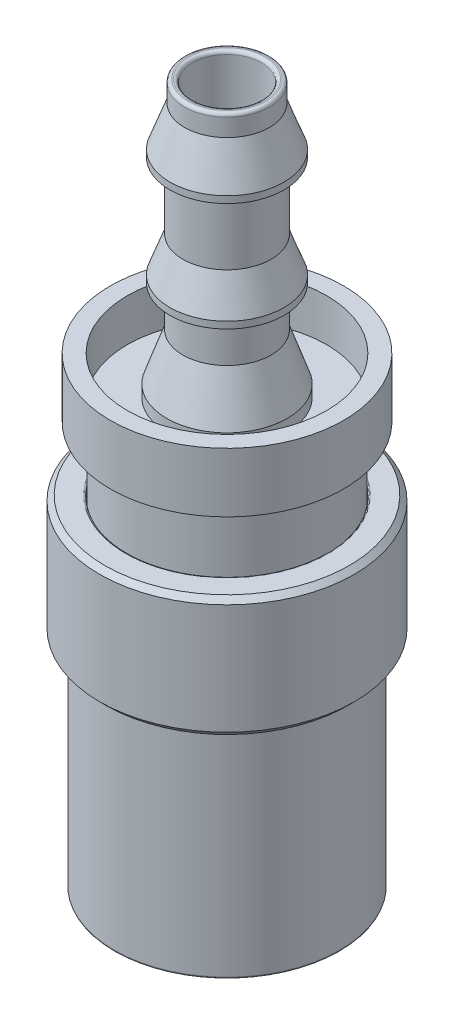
ISO-10303-21;
HEADER;
FILE_DESCRIPTION(('STEP AP214'),'2;1');
FILE_NAME('part.step','',(''),(''),'','','');
FILE_SCHEMA(('AUTOMOTIVE_DESIGN { 1 0 10303 214 1 1 1 1 }'));
ENDSEC;
DATA;
#1=APPLICATION_CONTEXT('core data for automotive mechanical design processes');
#2=APPLICATION_PROTOCOL_DEFINITION('international standard','automotive_design',2000,#1);
#3=PRODUCT_CONTEXT('',#1,'mechanical');
#4=PRODUCT('Part','Part','',(#3));
#5=PRODUCT_RELATED_PRODUCT_CATEGORY('part','',(#4));
#6=PRODUCT_DEFINITION_FORMATION('','',#4);
#7=PRODUCT_DEFINITION_CONTEXT('part definition',#1,'design');
#8=PRODUCT_DEFINITION('design','',#6,#7);
#9=PRODUCT_DEFINITION_SHAPE('','',#8);
#10=(LENGTH_UNIT() NAMED_UNIT(*) SI_UNIT(.MILLI.,.METRE.));
#11=(NAMED_UNIT(*) PLANE_ANGLE_UNIT() SI_UNIT($,.RADIAN.));
#12=(NAMED_UNIT(*) SI_UNIT($,.STERADIAN.) SOLID_ANGLE_UNIT());
#13=UNCERTAINTY_MEASURE_WITH_UNIT(LENGTH_MEASURE(1.E-05),#10,'distance_accuracy_value','');
#14=(GEOMETRIC_REPRESENTATION_CONTEXT(3) GLOBAL_UNCERTAINTY_ASSIGNED_CONTEXT((#13)) GLOBAL_UNIT_ASSIGNED_CONTEXT((#10,
#11,#12)) REPRESENTATION_CONTEXT('',''));
#15=CARTESIAN_POINT('',(0.,0.,0.));
#16=DIRECTION('',(0.,0.,1.));
#17=DIRECTION('',(1.,0.,0.));
#18=AXIS2_PLACEMENT_3D('',#15,#16,#17);
#19=CARTESIAN_POINT('',(0.,8.19974058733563,0.));
#20=DIRECTION('',(0.,1.,0.));
#21=DIRECTION('',(0.,0.,-1.));
#22=AXIS2_PLACEMENT_3D('',#19,#20,#21);
#23=CONICAL_SURFACE('',#22,4.91490022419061,1.04719741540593);
#24=CARTESIAN_POINT('',(0.,8.28039657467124,0.));
#25=DIRECTION('',(0.,-1.,0.));
#26=DIRECTION('',(1.,0.,0.));
#27=AXIS2_PLACEMENT_3D('',#24,#25,#26);
#28=CIRCLE('',#27,5.05460044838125);
#29=CARTESIAN_POINT('',(4.15264158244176,8.28039657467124,2.88176212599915));
#30=VERTEX_POINT('',#29);
#31=CARTESIAN_POINT('',(0.419358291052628,8.28039657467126,5.0371742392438));
#32=VERTEX_POINT('',#31);
#33=EDGE_CURVE('P0_E464',#30,#32,#28,.T.);
#34=ORIENTED_EDGE('',*,*,#33,.F.);
#35=CARTESIAN_POINT('',(4.15334512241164,8.28059657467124,2.88135593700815));
#36=CARTESIAN_POINT('',(4.05610273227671,8.25294550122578,2.9374988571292));
#37=CARTESIAN_POINT('',(3.95850659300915,8.22695818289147,2.9938460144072));
#38=CARTESIAN_POINT('',(3.76259955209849,8.17869417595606,3.10695299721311));
#39=CARTESIAN_POINT('',(3.66428844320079,8.15641861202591,3.16371294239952));
#40=CARTESIAN_POINT('',(3.36815779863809,8.09571682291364,3.33468404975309));
#41=CARTESIAN_POINT('',(3.16934077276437,8.06347391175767,3.44947111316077));
#42=CARTESIAN_POINT('',(2.77407912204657,8.01864306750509,3.67767553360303));
#43=CARTESIAN_POINT('',(2.57766756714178,8.00567169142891,3.79107379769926));
#44=CARTESIAN_POINT('',(2.18474107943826,7.99938816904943,4.01793001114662));
#45=CARTESIAN_POINT('',(1.98822636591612,8.0060597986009,4.13138783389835));
#46=CARTESIAN_POINT('',(1.67721020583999,8.03169274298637,4.31095309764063));
#47=CARTESIAN_POINT('',(1.56229110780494,8.04445498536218,4.3773016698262));
#48=CARTESIAN_POINT('',(1.33306656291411,8.07611125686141,4.50964452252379));
#49=CARTESIAN_POINT('',(1.21876121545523,8.09500625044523,4.57563874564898));
#50=CARTESIAN_POINT('',(0.98957281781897,8.13868203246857,4.70796072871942));
#51=CARTESIAN_POINT('',(0.874699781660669,8.16353193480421,4.77428270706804));
#52=CARTESIAN_POINT('',(0.645934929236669,8.2183661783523,4.90636015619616));
#53=CARTESIAN_POINT('',(0.53204263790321,8.24834786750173,4.97211590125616));
#54=CARTESIAN_POINT('',(0.418654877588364,8.28059657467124,5.03758035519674));
#55=B_SPLINE_CURVE_WITH_KNOTS('',3,(#35,#36,#37,#38,#39,#40,#41,#42,#43,#44,#45,#46,#47,#48,#49,
#50,#51,#52,#53,#54),.UNSPECIFIED.,.F.,.F.,(4,2,2,2,2,2,2,2,2,4),(0.,0.3468991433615,
0.693903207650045,1.38862387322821,2.06932750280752,2.74946906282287,3.14926791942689,
3.54912968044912,3.95387856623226,4.3584189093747),.UNSPECIFIED.);
#56=EDGE_CURVE('P0_E961',#30,#32,#55,.T.);
#57=ORIENTED_EDGE('',*,*,#56,.T.);
#58=EDGE_LOOP('',(#34,#57));
#59=FACE_BOUND('',#58,.T.);
#60=ADVANCED_FACE('P0_F43',(#59),#23,.F.);
#61=CARTESIAN_POINT('',(4.57199999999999,8.28039657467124,-2.15541204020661));
#62=VERTEX_POINT('',#61);
#63=CARTESIAN_POINT('',(4.57199999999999,8.28039657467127,2.15541218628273));
#64=VERTEX_POINT('',#63);
#65=EDGE_CURVE('P0_E938',#62,#64,#28,.T.);
#66=ORIENTED_EDGE('',*,*,#65,.F.);
#67=CARTESIAN_POINT('',(4.57199999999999,10.6967984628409,-8.02951567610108));
#68=CARTESIAN_POINT('',(4.57199999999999,10.6006852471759,-7.83791820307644));
#69=CARTESIAN_POINT('',(4.57199999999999,10.5052209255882,-7.6459918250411));
#70=CARTESIAN_POINT('',(4.57199999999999,10.3159044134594,-7.26133068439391));
#71=CARTESIAN_POINT('',(4.57199999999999,10.2220523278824,-7.06859587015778));
#72=CARTESIAN_POINT('',(4.57199999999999,10.0361037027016,-6.68181045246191));
#73=CARTESIAN_POINT('',(4.57199999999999,9.94401099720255,-6.48775800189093));
#74=CARTESIAN_POINT('',(4.57199999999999,9.76220941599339,-6.09854208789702));
#75=CARTESIAN_POINT('',(4.57199999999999,9.67250049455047,-5.90337864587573));
#76=CARTESIAN_POINT('',(4.57199999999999,9.49197753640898,-5.50275753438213));
#77=CARTESIAN_POINT('',(4.57199999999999,9.4013009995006,-5.29723770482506));
#78=CARTESIAN_POINT('',(4.57199999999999,9.22399246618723,-4.88446229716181));
#79=CARTESIAN_POINT('',(4.57199999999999,9.13736033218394,-4.67720677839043));
#80=CARTESIAN_POINT('',(4.57199999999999,8.96928226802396,-4.26072929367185));
#81=CARTESIAN_POINT('',(4.57199999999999,8.88783338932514,-4.05150852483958));
#82=CARTESIAN_POINT('',(4.57199999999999,8.73152876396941,-3.63062937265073));
#83=CARTESIAN_POINT('',(4.57199999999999,8.65667230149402,-3.4189712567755));
#84=CARTESIAN_POINT('',(4.57199999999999,8.4993433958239,-2.9443576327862));
#85=CARTESIAN_POINT('',(4.57199999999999,8.41901012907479,-2.68068238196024));
#86=CARTESIAN_POINT('',(4.57199999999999,8.27555686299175,-2.1485574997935));
#87=CARTESIAN_POINT('',(4.57199999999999,8.21243561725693,-1.88010821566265));
#88=CARTESIAN_POINT('',(4.57199999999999,8.13505880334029,-1.47651890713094));
#89=CARTESIAN_POINT('',(4.57199999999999,8.11227592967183,-1.34300000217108));
#90=CARTESIAN_POINT('',(4.57199999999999,8.07273188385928,-1.07508093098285));
#91=CARTESIAN_POINT('',(4.57199999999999,8.05596983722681,-0.940680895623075));
#92=CARTESIAN_POINT('',(4.57199999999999,8.02896669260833,-0.67126353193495));
#93=CARTESIAN_POINT('',(4.57199999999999,8.01872360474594,-0.536246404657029));
#94=CARTESIAN_POINT('',(4.57199999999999,8.00508291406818,-0.2658636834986));
#95=CARTESIAN_POINT('',(4.57199999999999,8.00168527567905,-0.130498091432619));
#96=CARTESIAN_POINT('',(4.57199999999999,8.00185224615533,0.141132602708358));
#97=CARTESIAN_POINT('',(4.57199999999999,8.00546347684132,0.277397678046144));
#98=CARTESIAN_POINT('',(4.57199999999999,8.01961610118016,0.549563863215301));
#99=CARTESIAN_POINT('',(4.57199999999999,8.03015752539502,0.685464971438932));
#100=CARTESIAN_POINT('',(4.57199999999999,8.0578295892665,0.956641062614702));
#101=CARTESIAN_POINT('',(4.57199999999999,8.07496271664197,1.09191578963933));
#102=CARTESIAN_POINT('',(4.57199999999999,8.1153034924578,1.36154858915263));
#103=CARTESIAN_POINT('',(4.57199999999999,8.13851135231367,1.49590662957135));
#104=CARTESIAN_POINT('',(4.57199999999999,8.21723127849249,1.90197482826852));
#105=CARTESIAN_POINT('',(4.57199999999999,8.28133042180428,2.17203364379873));
#106=CARTESIAN_POINT('',(4.57199999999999,8.426840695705,2.70745806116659));
#107=CARTESIAN_POINT('',(4.57199999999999,8.5082619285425,2.97282082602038));
#108=CARTESIAN_POINT('',(4.57199999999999,8.66667088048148,3.44771264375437));
#109=CARTESIAN_POINT('',(4.57199999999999,8.74140716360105,3.65800402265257));
#110=CARTESIAN_POINT('',(4.57199999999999,8.89729739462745,4.07611349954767));
#111=CARTESIAN_POINT('',(4.57199999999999,8.97844954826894,4.28393227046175));
#112=CARTESIAN_POINT('',(4.57199999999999,9.14584000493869,4.69767651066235));
#113=CARTESIAN_POINT('',(4.57199999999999,9.23208199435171,4.90360047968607));
#114=CARTESIAN_POINT('',(4.57199999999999,9.40853407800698,5.31374296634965));
#115=CARTESIAN_POINT('',(4.57199999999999,9.49874430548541,5.51796142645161));
#116=CARTESIAN_POINT('',(4.57199999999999,9.67831767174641,5.9160967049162));
#117=CARTESIAN_POINT('',(4.57199999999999,9.76754621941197,6.11007442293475));
#118=CARTESIAN_POINT('',(4.57199999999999,9.94834721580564,6.49692869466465));
#119=CARTESIAN_POINT('',(4.57199999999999,10.0399196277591,6.68980526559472));
#120=CARTESIAN_POINT('',(4.57199999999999,10.2248084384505,7.07426923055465));
#121=CARTESIAN_POINT('',(4.57199999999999,10.3181212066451,7.26585837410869));
#122=CARTESIAN_POINT('',(4.57199999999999,10.5063416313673,7.64824527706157));
#123=CARTESIAN_POINT('',(4.57199999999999,10.6012492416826,7.83904305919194));
#124=CARTESIAN_POINT('',(4.57199999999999,10.6967984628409,8.02951567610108));
#125=B_SPLINE_CURVE_WITH_KNOTS('',3,(#67,#68,#69,#70,#71,#72,#73,#74,#75,#76,#77,#78,#79,#80,
#81,#82,#83,#84,#85,#86,#87,#88,#89,#90,#91,#92,#93,#94,#95,#96,#97,#98,#99,#100,#101,#102,#103,
#104,#105,#106,#107,#108,#109,#110,#111,#112,#113,#114,#115,#116,#117,#118,#119,#120,#121,#122,
#123,#124),.UNSPECIFIED.,.F.,.F.,(4,2,2,2,2,2,2,2,2,2,2,2,2,2,2,2,2,2,2,2,2,2,2,2,2,2,2,2,4),
(0.,0.643063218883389,1.28616814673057,1.93054345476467,2.57490639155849,3.24877544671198,
3.92262155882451,4.59608085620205,5.26946693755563,6.0959852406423,6.92244367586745,
7.32867555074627,7.73484839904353,8.14089720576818,8.54694390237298,8.95570081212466,
9.36445952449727,9.77337265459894,10.1823000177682,11.0141273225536,11.8464410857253,
12.5158478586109,13.1850680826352,13.854779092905,14.5245126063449,15.1650420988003,
15.8055615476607,16.4448681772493,17.0841563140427),.UNSPECIFIED.);
#126=EDGE_CURVE('P0_E817',#62,#64,#125,.T.);
#127=ORIENTED_EDGE('',*,*,#126,.T.);
#128=EDGE_LOOP('',(#66,#127));
#129=FACE_BOUND('',#128,.T.);
#130=ADVANCED_FACE('P0_F952',(#129),#23,.F.);
#131=CARTESIAN_POINT('',(0.419358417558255,8.28039657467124,-5.03717416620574));
#132=VERTEX_POINT('',#131);
#133=CARTESIAN_POINT('',(4.15264170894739,8.28039657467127,-2.88176205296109));
#134=VERTEX_POINT('',#133);
#135=EDGE_CURVE('P0_E530',#132,#134,#28,.T.);
#136=ORIENTED_EDGE('',*,*,#135,.F.);
#137=CARTESIAN_POINT('',(0.418654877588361,8.28059657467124,-5.03758035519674));
#138=CARTESIAN_POINT('',(0.515897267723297,8.25294550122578,-4.98143743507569));
#139=CARTESIAN_POINT('',(0.613493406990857,8.22695818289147,-4.9250902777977));
#140=CARTESIAN_POINT('',(0.809400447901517,8.17869417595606,-4.81198329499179));
#141=CARTESIAN_POINT('',(0.907711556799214,8.15641861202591,-4.75522334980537));
#142=CARTESIAN_POINT('',(1.20384220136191,8.09571682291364,-4.5842522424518));
#143=CARTESIAN_POINT('',(1.40265922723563,8.06347391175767,-4.46946517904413));
#144=CARTESIAN_POINT('',(1.79792087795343,8.01864306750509,-4.24126075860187));
#145=CARTESIAN_POINT('',(1.99433243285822,8.00567169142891,-4.12786249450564));
#146=CARTESIAN_POINT('',(2.38725892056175,7.99938816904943,-3.90100628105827));
#147=CARTESIAN_POINT('',(2.58377363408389,8.0060597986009,-3.78754845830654));
#148=CARTESIAN_POINT('',(2.89478979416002,8.03169274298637,-3.60798319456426));
#149=CARTESIAN_POINT('',(3.00970889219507,8.04445498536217,-3.5416346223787));
#150=CARTESIAN_POINT('',(3.2389334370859,8.0761112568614,-3.40929176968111));
#151=CARTESIAN_POINT('',(3.35323878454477,8.09500625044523,-3.34329754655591));
#152=CARTESIAN_POINT('',(3.58242718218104,8.13868203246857,-3.21097556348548));
#153=CARTESIAN_POINT('',(3.69730021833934,8.16353193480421,-3.14465358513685));
#154=CARTESIAN_POINT('',(3.92606507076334,8.2183661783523,-3.01257613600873));
#155=CARTESIAN_POINT('',(4.0399573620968,8.24834786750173,-2.94682039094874));
#156=CARTESIAN_POINT('',(4.15334512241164,8.28059657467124,-2.88135593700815));
#157=B_SPLINE_CURVE_WITH_KNOTS('',3,(#137,#138,#139,#140,#141,#142,#143,#144,#145,#146,#147,
#148,#149,#150,#151,#152,#153,#154,#155,#156),.UNSPECIFIED.,.F.,.F.,(4,2,2,2,2,2,2,2,2,4),(0.,
0.3468991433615,0.693903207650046,1.38862387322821,2.06932750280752,2.74946906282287,
3.14926791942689,3.54912968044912,3.95387856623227,4.3584189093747),.UNSPECIFIED.);
#158=EDGE_CURVE('P0_E808',#132,#134,#157,.T.);
#159=ORIENTED_EDGE('',*,*,#158,.T.);
#160=EDGE_LOOP('',(#136,#159));
#161=FACE_BOUND('',#160,.T.);
#162=ADVANCED_FACE('P0_F950',(#161),#23,.F.);
#163=CARTESIAN_POINT('',(0.,8.28039657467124,0.));
#164=DIRECTION('',(0.,-1.,0.));
#165=DIRECTION('',(1.,0.,0.));
#166=AXIS2_PLACEMENT_3D('',#163,#164,#165);
#167=CIRCLE('',#166,5.05460044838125);
#168=CARTESIAN_POINT('',(-4.15264158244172,8.28039657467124,-2.88176212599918));
#169=VERTEX_POINT('',#168);
#170=CARTESIAN_POINT('',(-0.41935829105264,8.28039657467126,-5.03717423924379));
#171=VERTEX_POINT('',#170);
#172=EDGE_CURVE('P0_E472',#169,#171,#167,.T.);
#173=ORIENTED_EDGE('',*,*,#172,.F.);
#174=CARTESIAN_POINT('',(-4.15334512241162,8.28059657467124,-2.88135593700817));
#175=CARTESIAN_POINT('',(-4.05610273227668,8.25294550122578,-2.93749885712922));
#176=CARTESIAN_POINT('',(-3.95850659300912,8.22695818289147,-2.99384601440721));
#177=CARTESIAN_POINT('',(-3.76259955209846,8.17869417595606,-3.10695299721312));
#178=CARTESIAN_POINT('',(-3.66428844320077,8.15641861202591,-3.16371294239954));
#179=CARTESIAN_POINT('',(-3.36815779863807,8.09571682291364,-3.33468404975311));
#180=CARTESIAN_POINT('',(-3.16934077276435,8.06347391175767,-3.44947111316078));
#181=CARTESIAN_POINT('',(-2.77407912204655,8.0186430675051,-3.67767553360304));
#182=CARTESIAN_POINT('',(-2.57766756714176,8.00567169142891,-3.79107379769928));
#183=CARTESIAN_POINT('',(-2.18474107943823,7.99938816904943,-4.01793001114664));
#184=CARTESIAN_POINT('',(-1.98822636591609,8.00605979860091,-4.13138783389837));
#185=CARTESIAN_POINT('',(-1.67721020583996,8.03169274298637,-4.31095309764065));
#186=CARTESIAN_POINT('',(-1.56229110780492,8.04445498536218,-4.37730166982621));
#187=CARTESIAN_POINT('',(-1.33306656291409,8.07611125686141,-4.5096445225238));
#188=CARTESIAN_POINT('',(-1.21876121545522,8.09500625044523,-4.57563874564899));
#189=CARTESIAN_POINT('',(-0.989572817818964,8.13868203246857,-4.70796072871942));
#190=CARTESIAN_POINT('',(-0.874699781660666,8.16353193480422,-4.77428270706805));
#191=CARTESIAN_POINT('',(-0.645934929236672,8.2183661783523,-4.90636015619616));
#192=CARTESIAN_POINT('',(-0.532042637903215,8.24834786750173,-4.97211590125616));
#193=CARTESIAN_POINT('',(-0.418654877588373,8.28059657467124,-5.03758035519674));
#194=B_SPLINE_CURVE_WITH_KNOTS('',3,(#174,#175,#176,#177,#178,#179,#180,#181,#182,#183,#184,
#185,#186,#187,#188,#189,#190,#191,#192,#193),.UNSPECIFIED.,.F.,.F.,(4,2,2,2,2,2,2,2,2,4),(0.,
0.346899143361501,0.693903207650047,1.38862387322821,2.06932750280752,2.74946906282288,
3.14926791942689,3.5491296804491,3.95387856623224,4.35841890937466),.UNSPECIFIED.);
#195=EDGE_CURVE('P0_E800',#169,#171,#194,.T.);
#196=ORIENTED_EDGE('',*,*,#195,.T.);
#197=EDGE_LOOP('',(#173,#196));
#198=FACE_BOUND('',#197,.T.);
#199=ADVANCED_FACE('P0_F943',(#198),#23,.F.);
#200=CARTESIAN_POINT('',(-4.572,8.28039657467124,2.15541204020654));
#201=VERTEX_POINT('',#200);
#202=CARTESIAN_POINT('',(-4.572,8.28039657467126,-2.15541218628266));
#203=VERTEX_POINT('',#202);
#204=EDGE_CURVE('P0_E476',#201,#203,#167,.T.);
#205=ORIENTED_EDGE('',*,*,#204,.F.);
#206=CARTESIAN_POINT('',(-4.57200000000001,10.6967984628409,8.02951567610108));
#207=CARTESIAN_POINT('',(-4.57200000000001,10.6006852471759,7.83791820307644));
#208=CARTESIAN_POINT('',(-4.57200000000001,10.5052209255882,7.6459918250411));
#209=CARTESIAN_POINT('',(-4.57200000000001,10.3159044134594,7.2613306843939));
#210=CARTESIAN_POINT('',(-4.572,10.2220523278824,7.06859587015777));
#211=CARTESIAN_POINT('',(-4.572,10.0361037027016,6.6818104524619));
#212=CARTESIAN_POINT('',(-4.572,9.94401099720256,6.48775800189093));
#213=CARTESIAN_POINT('',(-4.572,9.76220941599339,6.09854208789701));
#214=CARTESIAN_POINT('',(-4.572,9.67250049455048,5.90337864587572));
#215=CARTESIAN_POINT('',(-4.572,9.49197753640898,5.50275753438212));
#216=CARTESIAN_POINT('',(-4.572,9.40130099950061,5.29723770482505));
#217=CARTESIAN_POINT('',(-4.572,9.22399246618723,4.8844622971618));
#218=CARTESIAN_POINT('',(-4.572,9.13736033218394,4.67720677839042));
#219=CARTESIAN_POINT('',(-4.572,8.96928226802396,4.26072929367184));
#220=CARTESIAN_POINT('',(-4.572,8.88783338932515,4.05150852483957));
#221=CARTESIAN_POINT('',(-4.572,8.73152876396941,3.63062937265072));
#222=CARTESIAN_POINT('',(-4.572,8.65667230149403,3.41897125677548));
#223=CARTESIAN_POINT('',(-4.572,8.49934339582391,2.94435763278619));
#224=CARTESIAN_POINT('',(-4.572,8.4190101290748,2.68068238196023));
#225=CARTESIAN_POINT('',(-4.572,8.27555686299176,2.14855749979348));
#226=CARTESIAN_POINT('',(-4.572,8.21243561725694,1.88010821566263));
#227=CARTESIAN_POINT('',(-4.572,8.13505880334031,1.47651890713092));
#228=CARTESIAN_POINT('',(-4.572,8.11227592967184,1.34300000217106));
#229=CARTESIAN_POINT('',(-4.572,8.07273188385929,1.07508093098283));
#230=CARTESIAN_POINT('',(-4.572,8.05596983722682,0.940680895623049));
#231=CARTESIAN_POINT('',(-4.572,8.02896669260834,0.671263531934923));
#232=CARTESIAN_POINT('',(-4.572,8.01872360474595,0.536246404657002));
#233=CARTESIAN_POINT('',(-4.572,8.0050829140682,0.265863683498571));
#234=CARTESIAN_POINT('',(-4.572,8.00168527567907,0.13049809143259));
#235=CARTESIAN_POINT('',(-4.572,8.00185224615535,-0.141132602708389));
#236=CARTESIAN_POINT('',(-4.572,8.00546347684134,-0.277397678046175));
#237=CARTESIAN_POINT('',(-4.572,8.01961610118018,-0.549563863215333));
#238=CARTESIAN_POINT('',(-4.572,8.03015752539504,-0.685464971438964));
#239=CARTESIAN_POINT('',(-4.572,8.05782958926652,-0.956641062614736));
#240=CARTESIAN_POINT('',(-4.572,8.07496271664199,-1.09191578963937));
#241=CARTESIAN_POINT('',(-4.572,8.11530349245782,-1.36154858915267));
#242=CARTESIAN_POINT('',(-4.572,8.13851135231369,-1.49590662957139));
#243=CARTESIAN_POINT('',(-4.572,8.21723127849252,-1.90197482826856));
#244=CARTESIAN_POINT('',(-4.572,8.2813304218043,-2.17203364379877));
#245=CARTESIAN_POINT('',(-4.572,8.42684069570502,-2.70745806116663));
#246=CARTESIAN_POINT('',(-4.572,8.50826192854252,-2.97282082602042));
#247=CARTESIAN_POINT('',(-4.572,8.66667088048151,-3.44771264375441));
#248=CARTESIAN_POINT('',(-4.572,8.74140716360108,-3.65800402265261));
#249=CARTESIAN_POINT('',(-4.572,8.89729739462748,-4.07611349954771));
#250=CARTESIAN_POINT('',(-4.572,8.97844954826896,-4.28393227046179));
#251=CARTESIAN_POINT('',(-4.572,9.14584000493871,-4.69767651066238));
#252=CARTESIAN_POINT('',(-4.572,9.23208199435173,-4.90360047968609));
#253=CARTESIAN_POINT('',(-4.572,9.408534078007,-5.31374296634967));
#254=CARTESIAN_POINT('',(-4.572,9.49874430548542,-5.51796142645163));
#255=CARTESIAN_POINT('',(-4.572,9.67831767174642,-5.91609670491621));
#256=CARTESIAN_POINT('',(-4.572,9.76754621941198,-6.11007442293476));
#257=CARTESIAN_POINT('',(-4.572,9.94834721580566,-6.49692869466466));
#258=CARTESIAN_POINT('',(-4.572,10.0399196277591,-6.68980526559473));
#259=CARTESIAN_POINT('',(-4.572,10.2248084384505,-7.07426923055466));
#260=CARTESIAN_POINT('',(-4.572,10.3181212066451,-7.2658583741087));
#261=CARTESIAN_POINT('',(-4.572,10.5063416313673,-7.64824527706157));
#262=CARTESIAN_POINT('',(-4.572,10.6012492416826,-7.83904305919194));
#263=CARTESIAN_POINT('',(-4.572,10.6967984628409,-8.02951567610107));
#264=B_SPLINE_CURVE_WITH_KNOTS('',3,(#206,#207,#208,#209,#210,#211,#212,#213,#214,#215,#216,
#217,#218,#219,#220,#221,#222,#223,#224,#225,#226,#227,#228,#229,#230,#231,#232,#233,#234,#235,
#236,#237,#238,#239,#240,#241,#242,#243,#244,#245,#246,#247,#248,#249,#250,#251,#252,#253,#254,
#255,#256,#257,#258,#259,#260,#261,#262,#263),.UNSPECIFIED.,.F.,.F.,(4,2,2,2,2,2,2,2,2,2,2,2,2,
2,2,2,2,2,2,2,2,2,2,2,2,2,2,2,4),(0.,0.643063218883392,1.28616814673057,1.93054345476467,
2.5749063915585,3.24877544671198,3.92262155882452,4.59608085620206,5.26946693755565,
6.09598524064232,6.92244367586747,7.32867555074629,7.73484839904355,8.1408972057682,
8.546943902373,8.95570081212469,9.3644595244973,9.77337265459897,10.1823000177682,
11.0141273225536,11.8464410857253,12.5158478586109,13.1850680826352,13.854779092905,
14.5245126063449,15.1650420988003,15.8055615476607,16.4448681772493,17.0841563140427),.UNSPECIFIED.);
#265=EDGE_CURVE('P0_E791',#201,#203,#264,.T.);
#266=ORIENTED_EDGE('',*,*,#265,.T.);
#267=EDGE_LOOP('',(#205,#266));
#268=FACE_BOUND('',#267,.T.);
#269=ADVANCED_FACE('P0_F780',(#268),#23,.F.);
#270=CARTESIAN_POINT('',(0.,8.7391219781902,0.));
#271=DIRECTION('',(0.,-1.,0.));
#272=DIRECTION('',(0.,0.,-1.));
#273=AXIS2_PLACEMENT_3D('',#270,#271,#272);
#274=CYLINDRICAL_SURFACE('',#273,5.05460038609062);
#275=ORIENTED_EDGE('',*,*,#33,.T.);
#276=DIRECTION('',(0.,-1.,0.));
#277=VECTOR('',#276,1.);
#278=CARTESIAN_POINT('',(0.419358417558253,8.7391219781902,5.03717416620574));
#279=LINE('',#278,#277);
#280=CARTESIAN_POINT('',(0.4193585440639,9.19784738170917,5.03717409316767));
#281=VERTEX_POINT('',#280);
#282=EDGE_CURVE('P0_E963',#32,#281,#279,.F.);
#283=ORIENTED_EDGE('',*,*,#282,.T.);
#284=CARTESIAN_POINT('',(0.,9.19784738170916,0.));
#285=DIRECTION('',(0.,-1.,0.));
#286=DIRECTION('',(1.,0.,0.));
#287=AXIS2_PLACEMENT_3D('',#284,#285,#286);
#288=CIRCLE('',#287,5.05460032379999);
#289=CARTESIAN_POINT('',(4.15264145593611,9.19784738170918,2.88176219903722));
#290=VERTEX_POINT('',#289);
#291=EDGE_CURVE('P0_E443',#290,#281,#288,.T.);
#292=ORIENTED_EDGE('',*,*,#291,.F.);
#293=DIRECTION('',(0.,-1.,0.));
#294=VECTOR('',#293,1.);
#295=CARTESIAN_POINT('',(4.15264158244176,8.7391219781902,2.88176212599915));
#296=LINE('',#295,#294);
#297=EDGE_CURVE('P0_E853',#290,#30,#296,.T.);
#298=ORIENTED_EDGE('',*,*,#297,.T.);
#299=EDGE_LOOP('',(#275,#283,#292,#298));
#300=FACE_BOUND('',#299,.T.);
#301=ADVANCED_FACE('P0_F942',(#300),#274,.F.);
#302=ORIENTED_EDGE('',*,*,#65,.T.);
#303=DIRECTION('',(0.,-1.,0.));
#304=VECTOR('',#303,1.);
#305=CARTESIAN_POINT('',(4.57199999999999,8.7391219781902,2.15541204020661));
#306=LINE('',#305,#304);
#307=CARTESIAN_POINT('',(4.57199999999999,9.19784738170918,2.15541189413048));
#308=VERTEX_POINT('',#307);
#309=EDGE_CURVE('P0_E825',#64,#308,#306,.F.);
#310=ORIENTED_EDGE('',*,*,#309,.T.);
#311=CARTESIAN_POINT('',(4.57199999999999,9.19784738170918,-2.15541189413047));
#312=VERTEX_POINT('',#311);
#313=EDGE_CURVE('P0_E456',#312,#308,#288,.T.);
#314=ORIENTED_EDGE('',*,*,#313,.F.);
#315=DIRECTION('',(0.,-1.,0.));
#316=VECTOR('',#315,1.);
#317=CARTESIAN_POINT('',(4.57199999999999,8.7391219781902,-2.15541204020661));
#318=LINE('',#317,#316);
#319=EDGE_CURVE('P0_E826',#312,#62,#318,.T.);
#320=ORIENTED_EDGE('',*,*,#319,.T.);
#321=EDGE_LOOP('',(#302,#310,#314,#320));
#322=FACE_BOUND('',#321,.T.);
#323=ADVANCED_FACE('P0_F948',(#322),#274,.F.);
#324=ORIENTED_EDGE('',*,*,#135,.T.);
#325=DIRECTION('',(0.,-1.,0.));
#326=VECTOR('',#325,1.);
#327=CARTESIAN_POINT('',(4.15264158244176,8.7391219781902,-2.88176212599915));
#328=LINE('',#327,#326);
#329=CARTESIAN_POINT('',(4.15264145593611,9.19784738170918,-2.88176219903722));
#330=VERTEX_POINT('',#329);
#331=EDGE_CURVE('P0_E893',#134,#330,#328,.F.);
#332=ORIENTED_EDGE('',*,*,#331,.T.);
#333=CARTESIAN_POINT('',(0.419358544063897,9.19784738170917,-5.03717409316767));
#334=VERTEX_POINT('',#333);
#335=EDGE_CURVE('P0_E458',#334,#330,#288,.T.);
#336=ORIENTED_EDGE('',*,*,#335,.F.);
#337=DIRECTION('',(0.,-1.,0.));
#338=VECTOR('',#337,1.);
#339=CARTESIAN_POINT('',(0.419358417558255,8.7391219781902,-5.03717416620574));
#340=LINE('',#339,#338);
#341=EDGE_CURVE('P0_E900',#334,#132,#340,.T.);
#342=ORIENTED_EDGE('',*,*,#341,.T.);
#343=EDGE_LOOP('',(#324,#332,#336,#342));
#344=FACE_BOUND('',#343,.T.);
#345=ADVANCED_FACE('P0_F1182',(#344),#274,.F.);
#346=ORIENTED_EDGE('',*,*,#172,.T.);
#347=DIRECTION('',(0.,-1.,0.));
#348=VECTOR('',#347,1.);
#349=CARTESIAN_POINT('',(-0.419358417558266,8.7391219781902,-5.03717416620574));
#350=LINE('',#349,#348);
#351=CARTESIAN_POINT('',(-0.419358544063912,9.19784738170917,-5.03717409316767));
#352=VERTEX_POINT('',#351);
#353=EDGE_CURVE('P0_E905',#171,#352,#350,.F.);
#354=ORIENTED_EDGE('',*,*,#353,.T.);
#355=CARTESIAN_POINT('',(0.,9.19784738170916,0.));
#356=DIRECTION('',(0.,-1.,0.));
#357=DIRECTION('',(1.,0.,0.));
#358=AXIS2_PLACEMENT_3D('',#355,#356,#357);
#359=CIRCLE('',#358,5.05460032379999);
#360=CARTESIAN_POINT('',(-4.15264145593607,9.19784738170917,-2.88176219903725));
#361=VERTEX_POINT('',#360);
#362=EDGE_CURVE('P0_E461',#361,#352,#359,.T.);
#363=ORIENTED_EDGE('',*,*,#362,.F.);
#364=DIRECTION('',(0.,-1.,0.));
#365=VECTOR('',#364,1.);
#366=CARTESIAN_POINT('',(-4.15264158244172,8.7391219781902,-2.88176212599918));
#367=LINE('',#366,#365);
#368=EDGE_CURVE('P0_E912',#361,#169,#367,.T.);
#369=ORIENTED_EDGE('',*,*,#368,.T.);
#370=EDGE_LOOP('',(#346,#354,#363,#369));
#371=FACE_BOUND('',#370,.T.);
#372=ADVANCED_FACE('P0_F1177',(#371),#274,.F.);
#373=ORIENTED_EDGE('',*,*,#204,.T.);
#374=DIRECTION('',(0.,-1.,0.));
#375=VECTOR('',#374,1.);
#376=CARTESIAN_POINT('',(-4.572,8.7391219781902,-2.15541204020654));
#377=LINE('',#376,#375);
#378=CARTESIAN_POINT('',(-4.572,9.19784738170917,-2.1554118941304));
#379=VERTEX_POINT('',#378);
#380=EDGE_CURVE('P0_E916',#203,#379,#377,.F.);
#381=ORIENTED_EDGE('',*,*,#380,.T.);
#382=CARTESIAN_POINT('',(-4.572,9.19784738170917,2.1554118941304));
#383=VERTEX_POINT('',#382);
#384=EDGE_CURVE('P0_E459',#383,#379,#359,.T.);
#385=ORIENTED_EDGE('',*,*,#384,.F.);
#386=DIRECTION('',(0.,-1.,0.));
#387=VECTOR('',#386,1.);
#388=CARTESIAN_POINT('',(-4.572,8.7391219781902,2.15541204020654));
#389=LINE('',#388,#387);
#390=EDGE_CURVE('P0_E923',#383,#201,#389,.T.);
#391=ORIENTED_EDGE('',*,*,#390,.T.);
#392=EDGE_LOOP('',(#373,#381,#385,#391));
#393=FACE_BOUND('',#392,.T.);
#394=ADVANCED_FACE('P0_F940',(#393),#274,.F.);
#395=CARTESIAN_POINT('',(0.,52.121054,0.));
#396=DIRECTION('',(0.,-1.,0.));
#397=DIRECTION('',(0.,0.,-1.));
#398=AXIS2_PLACEMENT_3D('',#395,#396,#397);
#399=TOROIDAL_SURFACE('',#398,2.83209999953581,0.254);
#400=CARTESIAN_POINT('',(0.,52.375054,0.));
#401=DIRECTION('',(0.,1.,0.));
#402=DIRECTION('',(0.,0.,1.));
#403=AXIS2_PLACEMENT_3D('',#400,#401,#402);
#404=CIRCLE('',#403,2.83209999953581);
#405=CARTESIAN_POINT('',(0.,52.375054,-2.83209999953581));
#406=VERTEX_POINT('',#405);
#407=CARTESIAN_POINT('',(0.,52.375054,2.83209999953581));
#408=VERTEX_POINT('',#407);
#409=EDGE_CURVE('P0_E578',#406,#408,#404,.T.);
#410=ORIENTED_EDGE('',*,*,#409,.T.);
#411=CARTESIAN_POINT('',(0.,52.121054,2.83209999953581));
#412=DIRECTION('',(-1.,0.,0.));
#413=DIRECTION('',(0.,0.,1.));
#414=AXIS2_PLACEMENT_3D('',#411,#412,#413);
#415=CIRCLE('',#414,0.254);
#416=CARTESIAN_POINT('',(0.,52.121054,2.57809999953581));
#417=VERTEX_POINT('',#416);
#418=EDGE_CURVE('P0_E582',#408,#417,#415,.T.);
#419=ORIENTED_EDGE('',*,*,#418,.T.);
#420=CARTESIAN_POINT('',(0.,52.121054,0.));
#421=DIRECTION('',(0.,-1.,0.));
#422=DIRECTION('',(0.,0.,1.));
#423=AXIS2_PLACEMENT_3D('',#420,#421,#422);
#424=CIRCLE('',#423,2.57809999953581);
#425=CARTESIAN_POINT('',(0.,52.121054,-2.57809999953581));
#426=VERTEX_POINT('',#425);
#427=EDGE_CURVE('P0_E666',#417,#426,#424,.T.);
#428=ORIENTED_EDGE('',*,*,#427,.T.);
#429=CARTESIAN_POINT('',(0.,52.121054,0.));
#430=DIRECTION('',(0.,-1.,0.));
#431=DIRECTION('',(0.,0.,1.));
#432=AXIS2_PLACEMENT_3D('',#429,#430,#431);
#433=CIRCLE('',#432,2.57809999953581);
#434=EDGE_CURVE('P0_E488',#426,#417,#433,.T.);
#435=ORIENTED_EDGE('',*,*,#434,.T.);
#436=ORIENTED_EDGE('',*,*,#418,.F.);
#437=CARTESIAN_POINT('',(0.,52.375054,0.));
#438=DIRECTION('',(0.,1.,0.));
#439=DIRECTION('',(0.,0.,1.));
#440=AXIS2_PLACEMENT_3D('',#437,#438,#439);
#441=CIRCLE('',#440,2.83209999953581);
#442=EDGE_CURVE('P0_E484',#408,#406,#441,.T.);
#443=ORIENTED_EDGE('',*,*,#442,.T.);
#444=EDGE_LOOP('',(#410,#419,#428,#435,#436,#443));
#445=FACE_BOUND('',#444,.T.);
#446=ADVANCED_FACE('P0_F1092',(#445),#399,.T.);
#447=CARTESIAN_POINT('',(0.,52.375054,-3.17492378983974));
#448=DIRECTION('',(0.,1.,0.));
#449=DIRECTION('',(1.,0.,0.));
#450=AXIS2_PLACEMENT_3D('',#447,#448,#449);
#451=PLANE('',#450);
#452=CARTESIAN_POINT('',(0.,52.375054,0.));
#453=DIRECTION('',(0.,-1.,0.));
#454=DIRECTION('',(0.,0.,1.));
#455=AXIS2_PLACEMENT_3D('',#452,#453,#454);
#456=CIRCLE('',#455,2.92092378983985);
#457=CARTESIAN_POINT('',(0.,52.375054,-2.92092378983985));
#458=VERTEX_POINT('',#457);
#459=CARTESIAN_POINT('',(0.,52.375054,2.92092378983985));
#460=VERTEX_POINT('',#459);
#461=EDGE_CURVE('P0_E706',#458,#460,#456,.T.);
#462=ORIENTED_EDGE('',*,*,#461,.F.);
#463=CARTESIAN_POINT('',(0.,52.375054,0.));
#464=DIRECTION('',(0.,-1.,0.));
#465=DIRECTION('',(0.,0.,1.));
#466=AXIS2_PLACEMENT_3D('',#463,#464,#465);
#467=CIRCLE('',#466,2.92092378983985);
#468=EDGE_CURVE('P0_E625',#460,#458,#467,.T.);
#469=ORIENTED_EDGE('',*,*,#468,.F.);
#470=EDGE_LOOP('',(#462,#469));
#471=FACE_BOUND('',#470,.T.);
#472=ORIENTED_EDGE('',*,*,#409,.F.);
#473=ORIENTED_EDGE('',*,*,#442,.F.);
#474=EDGE_LOOP('',(#472,#473));
#475=FACE_BOUND('',#474,.T.);
#476=ADVANCED_FACE('P0_F862',(#471,#475),#451,.T.);
#477=CARTESIAN_POINT('',(0.,39.674927,0.));
#478=DIRECTION('',(0.,-1.,0.));
#479=DIRECTION('',(0.,0.,-1.));
#480=AXIS2_PLACEMENT_3D('',#477,#478,#479);
#481=CYLINDRICAL_SURFACE('',#480,2.57809999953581);
#482=CARTESIAN_POINT('',(0.,26.9748,0.));
#483=DIRECTION('',(0.,-1.,0.));
#484=DIRECTION('',(1.,0.,0.));
#485=AXIS2_PLACEMENT_3D('',#482,#483,#484);
#486=CIRCLE('',#485,2.5780999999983);
#487=CARTESIAN_POINT('',(0.,26.9748,-2.5780999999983));
#488=VERTEX_POINT('',#487);
#489=CARTESIAN_POINT('',(0.,26.9748,2.57809999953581));
#490=VERTEX_POINT('',#489);
#491=EDGE_CURVE('P0_E489',#488,#490,#486,.T.);
#492=ORIENTED_EDGE('',*,*,#491,.T.);
#493=DIRECTION('',(0.,1.,0.));
#494=VECTOR('',#493,1.);
#495=CARTESIAN_POINT('',(0.,39.674927,2.57809999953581));
#496=LINE('',#495,#494);
#497=EDGE_CURVE('P0_E535',#490,#417,#496,.T.);
#498=ORIENTED_EDGE('',*,*,#497,.T.);
#499=ORIENTED_EDGE('',*,*,#434,.F.);
#500=ORIENTED_EDGE('',*,*,#427,.F.);
#501=ORIENTED_EDGE('',*,*,#497,.F.);
#502=CARTESIAN_POINT('',(0.,26.9748,0.));
#503=DIRECTION('',(0.,-1.,0.));
#504=DIRECTION('',(1.,0.,0.));
#505=AXIS2_PLACEMENT_3D('',#502,#503,#504);
#506=CIRCLE('',#505,2.5780999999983);
#507=EDGE_CURVE('P0_E531',#490,#488,#506,.T.);
#508=ORIENTED_EDGE('',*,*,#507,.T.);
#509=EDGE_LOOP('',(#492,#498,#499,#500,#501,#508));
#510=FACE_BOUND('',#509,.T.);
#511=ADVANCED_FACE('P0_F1077',(#510),#481,.F.);
#512=CARTESIAN_POINT('',(0.,52.121054,0.));
#513=DIRECTION('',(0.,-1.,0.));
#514=DIRECTION('',(0.,0.,-1.));
#515=AXIS2_PLACEMENT_3D('',#512,#513,#514);
#516=TOROIDAL_SURFACE('',#515,2.92092378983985,0.254);
#517=CARTESIAN_POINT('',(0.,52.121054,0.));
#518=DIRECTION('',(0.,1.,0.));
#519=DIRECTION('',(0.,0.,1.));
#520=AXIS2_PLACEMENT_3D('',#517,#518,#519);
#521=CIRCLE('',#520,3.17492378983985);
#522=CARTESIAN_POINT('',(0.,52.121054,-3.17492378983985));
#523=VERTEX_POINT('',#522);
#524=CARTESIAN_POINT('',(0.,52.121054,3.17492378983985));
#525=VERTEX_POINT('',#524);
#526=EDGE_CURVE('P0_E536',#523,#525,#521,.T.);
#527=ORIENTED_EDGE('',*,*,#526,.T.);
#528=CARTESIAN_POINT('',(0.,52.121054,2.92092378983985));
#529=DIRECTION('',(-1.,0.,0.));
#530=DIRECTION('',(0.,0.,1.));
#531=AXIS2_PLACEMENT_3D('',#528,#529,#530);
#532=CIRCLE('',#531,0.254);
#533=EDGE_CURVE('P0_E621',#525,#460,#532,.T.);
#534=ORIENTED_EDGE('',*,*,#533,.T.);
#535=ORIENTED_EDGE('',*,*,#468,.T.);
#536=ORIENTED_EDGE('',*,*,#461,.T.);
#537=ORIENTED_EDGE('',*,*,#533,.F.);
#538=CARTESIAN_POINT('',(0.,52.121054,0.));
#539=DIRECTION('',(0.,1.,0.));
#540=DIRECTION('',(0.,0.,1.));
#541=AXIS2_PLACEMENT_3D('',#538,#539,#540);
#542=CIRCLE('',#541,3.17492378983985);
#543=EDGE_CURVE('P0_E612',#525,#523,#542,.T.);
#544=ORIENTED_EDGE('',*,*,#543,.T.);
#545=EDGE_LOOP('',(#527,#534,#535,#536,#537,#544));
#546=FACE_BOUND('',#545,.T.);
#547=ADVANCED_FACE('P0_F1075',(#546),#516,.T.);
#548=CARTESIAN_POINT('',(0.,51.5876539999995,0.));
#549=DIRECTION('',(0.,-1.,0.));
#550=DIRECTION('',(0.,0.,-1.));
#551=AXIS2_PLACEMENT_3D('',#548,#549,#550);
#552=CYLINDRICAL_SURFACE('',#551,3.17492378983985);
#553=CARTESIAN_POINT('',(0.,50.800253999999,0.));
#554=DIRECTION('',(0.,-1.,0.));
#555=DIRECTION('',(1.,0.,0.));
#556=AXIS2_PLACEMENT_3D('',#553,#554,#555);
#557=CIRCLE('',#556,3.17492378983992);
#558=CARTESIAN_POINT('',(0.,50.800253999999,-3.17492378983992));
#559=VERTEX_POINT('',#558);
#560=CARTESIAN_POINT('',(0.,50.800253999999,3.17492378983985));
#561=VERTEX_POINT('',#560);
#562=EDGE_CURVE('P0_E596',#559,#561,#557,.T.);
#563=ORIENTED_EDGE('',*,*,#562,.F.);
#564=CARTESIAN_POINT('',(0.,50.800253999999,0.));
#565=DIRECTION('',(0.,-1.,0.));
#566=DIRECTION('',(1.,0.,0.));
#567=AXIS2_PLACEMENT_3D('',#564,#565,#566);
#568=CIRCLE('',#567,3.17492378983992);
#569=EDGE_CURVE('P0_E591',#561,#559,#568,.T.);
#570=ORIENTED_EDGE('',*,*,#569,.F.);
#571=DIRECTION('',(0.,1.,0.));
#572=VECTOR('',#571,1.);
#573=CARTESIAN_POINT('',(0.,51.5876539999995,3.17492378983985));
#574=LINE('',#573,#572);
#575=EDGE_CURVE('P0_E608',#561,#525,#574,.T.);
#576=ORIENTED_EDGE('',*,*,#575,.T.);
#577=ORIENTED_EDGE('',*,*,#526,.F.);
#578=ORIENTED_EDGE('',*,*,#543,.F.);
#579=ORIENTED_EDGE('',*,*,#575,.F.);
#580=EDGE_LOOP('',(#563,#570,#576,#577,#578,#579));
#581=FACE_BOUND('',#580,.T.);
#582=ADVANCED_FACE('P0_F1066',(#581),#552,.T.);
#583=CARTESIAN_POINT('',(0.,29.8958,0.));
#584=DIRECTION('',(0.,-1.,0.));
#585=DIRECTION('',(0.,0.,-1.));
#586=AXIS2_PLACEMENT_3D('',#583,#584,#585);
#587=TOROIDAL_SURFACE('',#586,7.1501,0.254);
#588=CARTESIAN_POINT('',(0.,29.8958,0.));
#589=DIRECTION('',(0.,1.,0.));
#590=DIRECTION('',(0.,0.,1.));
#591=AXIS2_PLACEMENT_3D('',#588,#589,#590);
#592=CIRCLE('',#591,7.4041);
#593=CARTESIAN_POINT('',(0.,29.8958,-7.4041));
#594=VERTEX_POINT('',#593);
#595=CARTESIAN_POINT('',(0.,29.8958,7.4041));
#596=VERTEX_POINT('',#595);
#597=EDGE_CURVE('P0_E613',#594,#596,#592,.T.);
#598=ORIENTED_EDGE('',*,*,#597,.T.);
#599=CARTESIAN_POINT('',(0.,29.8958,7.1501));
#600=DIRECTION('',(-1.,0.,0.));
#601=DIRECTION('',(0.,0.,1.));
#602=AXIS2_PLACEMENT_3D('',#599,#600,#601);
#603=CIRCLE('',#602,0.254);
#604=CARTESIAN_POINT('',(0.,30.1498,7.1501));
#605=VERTEX_POINT('',#604);
#606=EDGE_CURVE('P0_E629',#596,#605,#603,.T.);
#607=ORIENTED_EDGE('',*,*,#606,.T.);
#608=CARTESIAN_POINT('',(0.,30.1498,0.));
#609=DIRECTION('',(0.,-1.,0.));
#610=DIRECTION('',(0.,0.,1.));
#611=AXIS2_PLACEMENT_3D('',#608,#609,#610);
#612=CIRCLE('',#611,7.1501);
#613=CARTESIAN_POINT('',(0.,30.1498,-7.1501));
#614=VERTEX_POINT('',#613);
#615=EDGE_CURVE('P0_E626',#605,#614,#612,.T.);
#616=ORIENTED_EDGE('',*,*,#615,.T.);
#617=CARTESIAN_POINT('',(0.,30.1498,0.));
#618=DIRECTION('',(0.,-1.,0.));
#619=DIRECTION('',(0.,0.,1.));
#620=AXIS2_PLACEMENT_3D('',#617,#618,#619);
#621=CIRCLE('',#620,7.1501);
#622=EDGE_CURVE('P0_E630',#614,#605,#621,.T.);
#623=ORIENTED_EDGE('',*,*,#622,.T.);
#624=ORIENTED_EDGE('',*,*,#606,.F.);
#625=CARTESIAN_POINT('',(0.,29.8958,0.));
#626=DIRECTION('',(0.,1.,0.));
#627=DIRECTION('',(0.,0.,1.));
#628=AXIS2_PLACEMENT_3D('',#625,#626,#627);
#629=CIRCLE('',#628,7.4041);
#630=EDGE_CURVE('P0_E637',#596,#594,#629,.T.);
#631=ORIENTED_EDGE('',*,*,#630,.T.);
#632=EDGE_LOOP('',(#598,#607,#616,#623,#624,#631));
#633=FACE_BOUND('',#632,.T.);
#634=ADVANCED_FACE('P0_F1033',(#633),#587,.T.);
#635=CARTESIAN_POINT('',(0.,30.1498,-7.4041));
#636=DIRECTION('',(0.,1.,0.));
#637=DIRECTION('',(1.,0.,0.));
#638=AXIS2_PLACEMENT_3D('',#635,#636,#637);
#639=PLANE('',#638);
#640=ORIENTED_EDGE('',*,*,#622,.F.);
#641=ORIENTED_EDGE('',*,*,#615,.F.);
#642=EDGE_LOOP('',(#640,#641));
#643=FACE_BOUND('',#642,.T.);
#644=CARTESIAN_POINT('',(0.,30.1498,0.));
#645=DIRECTION('',(0.,-1.,0.));
#646=DIRECTION('',(1.,0.,0.));
#647=AXIS2_PLACEMENT_3D('',#644,#645,#646);
#648=CIRCLE('',#647,4.12750000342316);
#649=CARTESIAN_POINT('',(0.,30.1498,-4.12750000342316));
#650=VERTEX_POINT('',#649);
#651=CARTESIAN_POINT('',(0.,30.1498,4.12750000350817));
#652=VERTEX_POINT('',#651);
#653=EDGE_CURVE('P0_E983',#650,#652,#648,.T.);
#654=ORIENTED_EDGE('',*,*,#653,.T.);
#655=CARTESIAN_POINT('',(0.,30.1498,0.));
#656=DIRECTION('',(0.,-1.,0.));
#657=DIRECTION('',(1.,0.,0.));
#658=AXIS2_PLACEMENT_3D('',#655,#656,#657);
#659=CIRCLE('',#658,4.12750000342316);
#660=EDGE_CURVE('P0_E620',#652,#650,#659,.T.);
#661=ORIENTED_EDGE('',*,*,#660,.T.);
#662=EDGE_LOOP('',(#654,#661));
#663=FACE_BOUND('',#662,.T.);
#664=ADVANCED_FACE('P0_F1029',(#643,#663),#639,.T.);
#665=CARTESIAN_POINT('',(0.,22.6949,0.));
#666=DIRECTION('',(0.,-1.,0.));
#667=DIRECTION('',(0.,0.,-1.));
#668=AXIS2_PLACEMENT_3D('',#665,#666,#667);
#669=CYLINDRICAL_SURFACE('',#668,7.4041);
#670=DIRECTION('',(0.,1.,0.));
#671=VECTOR('',#670,1.);
#672=CARTESIAN_POINT('',(0.,22.6949,7.4041));
#673=LINE('',#672,#671);
#674=CARTESIAN_POINT('',(0.,15.24,7.4041));
#675=VERTEX_POINT('',#674);
#676=CARTESIAN_POINT('',(0.,25.3999996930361,7.4041));
#677=VERTEX_POINT('',#676);
#678=EDGE_CURVE('P0_E617',#675,#677,#673,.T.);
#679=ORIENTED_EDGE('',*,*,#678,.T.);
#680=ORIENTED_EDGE('',*,*,#678,.F.);
#681=CARTESIAN_POINT('',(0.,15.24,0.));
#682=DIRECTION('',(0.,-1.,0.));
#683=DIRECTION('',(1.,0.,0.));
#684=AXIS2_PLACEMENT_3D('',#681,#682,#683);
#685=CIRCLE('',#684,7.4041);
#686=CARTESIAN_POINT('',(0.,15.24,-7.4041));
#687=VERTEX_POINT('',#686);
#688=EDGE_CURVE('P0_E651',#687,#675,#685,.T.);
#689=ORIENTED_EDGE('',*,*,#688,.F.);
#690=CARTESIAN_POINT('',(0.,15.24,0.));
#691=DIRECTION('',(0.,-1.,0.));
#692=DIRECTION('',(1.,0.,0.));
#693=AXIS2_PLACEMENT_3D('',#690,#691,#692);
#694=CIRCLE('',#693,7.4041);
#695=EDGE_CURVE('P0_E601',#675,#687,#694,.T.);
#696=ORIENTED_EDGE('',*,*,#695,.F.);
#697=EDGE_LOOP('',(#679,#680,#689,#696));
#698=FACE_BOUND('',#697,.T.);
#699=DIRECTION('',(0.,1.,0.));
#700=VECTOR('',#699,1.);
#701=CARTESIAN_POINT('',(0.,22.6949,7.4041));
#702=LINE('',#701,#700);
#703=CARTESIAN_POINT('',(0.,28.1939996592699,7.4041));
#704=VERTEX_POINT('',#703);
#705=EDGE_CURVE('P0_E566',#704,#596,#702,.T.);
#706=ORIENTED_EDGE('',*,*,#705,.F.);
#707=ORIENTED_EDGE('',*,*,#705,.T.);
#708=ORIENTED_EDGE('',*,*,#597,.F.);
#709=ORIENTED_EDGE('',*,*,#630,.F.);
#710=EDGE_LOOP('',(#706,#707,#708,#709));
#711=FACE_BOUND('',#710,.T.);
#712=ADVANCED_FACE('P0_F859',(#698,#711),#669,.T.);
#713=CARTESIAN_POINT('',(0.,0.3937,0.));
#714=DIRECTION('',(0.,-1.,0.));
#715=DIRECTION('',(0.,0.,1.));
#716=AXIS2_PLACEMENT_3D('',#713,#714,#715);
#717=CONICAL_SURFACE('',#716,5.1689,0.78539816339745);
#718=CARTESIAN_POINT('',(-4.5722,0.283193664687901,2.63952996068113));
#719=CARTESIAN_POINT('',(-4.49358598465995,0.328577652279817,2.68491778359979));
#720=CARTESIAN_POINT('',(-4.41436769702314,0.372568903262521,2.73065448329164));
#721=CARTESIAN_POINT('',(-4.2546040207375,0.457342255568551,2.82289408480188));
#722=CARTESIAN_POINT('',(-4.17405793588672,0.498122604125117,2.86939738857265));
#723=CARTESIAN_POINT('',(-3.92950181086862,0.61535956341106,3.01059193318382));
#724=CARTESIAN_POINT('',(-3.76342144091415,0.686211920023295,3.10647847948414));
#725=CARTESIAN_POINT('',(-3.42850705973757,0.807541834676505,3.29984138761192));
#726=CARTESIAN_POINT('',(-3.25975865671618,0.858325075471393,3.39726832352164));
#727=CARTESIAN_POINT('',(-3.00386166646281,0.917068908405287,3.54501051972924));
#728=CARTESIAN_POINT('',(-2.91818590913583,0.933737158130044,3.594475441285));
#729=CARTESIAN_POINT('',(-2.74610893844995,0.960886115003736,3.69382412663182));
#730=CARTESIAN_POINT('',(-2.65970783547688,0.971367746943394,3.74370782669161));
#731=CARTESIAN_POINT('',(-2.44916285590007,0.988941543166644,3.8652660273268));
#732=CARTESIAN_POINT('',(-2.32479213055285,0.992629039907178,3.93707149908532));
#733=CARTESIAN_POINT('',(-2.07627481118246,0.986440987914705,4.08055304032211));
#734=CARTESIAN_POINT('',(-1.95212831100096,0.976560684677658,4.15222905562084));
#735=CARTESIAN_POINT('',(-1.7050057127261,0.943819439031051,4.29490535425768));
#736=CARTESIAN_POINT('',(-1.58203108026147,0.920943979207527,4.36590479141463));
#737=CARTESIAN_POINT('',(-1.33819543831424,0.863456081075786,4.50668336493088));
#738=CARTESIAN_POINT('',(-1.21733426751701,0.828844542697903,4.57646259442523));
#739=CARTESIAN_POINT('',(-1.00277900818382,0.757636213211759,4.7003361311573));
#740=CARTESIAN_POINT('',(-0.908609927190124,0.722911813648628,4.75470467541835));
#741=CARTESIAN_POINT('',(-0.721962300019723,0.647867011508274,4.86246573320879));
#742=CARTESIAN_POINT('',(-0.629483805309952,0.607546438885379,4.91585821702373));
#743=CARTESIAN_POINT('',(-0.446508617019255,0.52221320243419,5.02149899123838));
#744=CARTESIAN_POINT('',(-0.356006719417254,0.477215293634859,5.07375028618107));
#745=CARTESIAN_POINT('',(-0.176678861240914,0.383118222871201,5.17728527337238));
#746=CARTESIAN_POINT('',(-0.0878519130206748,0.334021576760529,5.22856953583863));
#747=CARTESIAN_POINT('',(0.000200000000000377,0.283193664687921,5.27940633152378));
#748=B_SPLINE_CURVE_WITH_KNOTS('',3,(#718,#719,#720,#721,#722,#723,#724,#725,#726,#727,#728,
#729,#730,#731,#732,#733,#734,#735,#736,#737,#738,#739,#740,#741,#742,#743,#744,#745,#746,#747),
.UNSPECIFIED.,.F.,.F.,(4,2,2,2,2,2,2,2,2,2,2,2,2,2,4),(0.,0.304447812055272,0.609060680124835,
1.22157531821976,1.82436328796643,2.12516606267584,2.42592386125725,2.85622906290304,
3.28668509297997,3.71762295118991,4.14852777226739,4.49080809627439,4.83309882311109,
5.17434077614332,5.51537478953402),.UNSPECIFIED.);
#749=CARTESIAN_POINT('',(-4.572,0.283309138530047,2.63964543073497));
#750=VERTEX_POINT('',#749);
#751=CARTESIAN_POINT('',(0.,0.283309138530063,5.27929086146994));
#752=VERTEX_POINT('',#751);
#753=EDGE_CURVE('P0_E866',#750,#752,#748,.T.);
#754=ORIENTED_EDGE('',*,*,#753,.T.);
#755=CARTESIAN_POINT('',(-0.000200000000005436,0.283193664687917,5.27940633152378));
#756=CARTESIAN_POINT('',(0.078414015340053,0.328577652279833,5.23401850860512));
#757=CARTESIAN_POINT('',(0.157632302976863,0.372568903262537,5.18828180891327));
#758=CARTESIAN_POINT('',(0.317395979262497,0.457342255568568,5.09604220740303));
#759=CARTESIAN_POINT('',(0.397942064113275,0.498122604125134,5.04953890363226));
#760=CARTESIAN_POINT('',(0.642498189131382,0.615359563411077,4.90834435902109));
#761=CARTESIAN_POINT('',(0.808578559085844,0.686211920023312,4.81245781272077));
#762=CARTESIAN_POINT('',(1.14349294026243,0.807541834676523,4.61909490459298));
#763=CARTESIAN_POINT('',(1.31224134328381,0.858325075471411,4.52166796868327));
#764=CARTESIAN_POINT('',(1.56813833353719,0.917068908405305,4.37392577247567));
#765=CARTESIAN_POINT('',(1.65381409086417,0.933737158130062,4.32446085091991));
#766=CARTESIAN_POINT('',(1.82589106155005,0.960886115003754,4.22511216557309));
#767=CARTESIAN_POINT('',(1.91229216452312,0.971367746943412,4.1752284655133));
#768=CARTESIAN_POINT('',(2.12283714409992,0.988941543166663,4.05367026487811));
#769=CARTESIAN_POINT('',(2.24720786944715,0.992629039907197,3.98186479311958));
#770=CARTESIAN_POINT('',(2.49572518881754,0.986440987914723,3.8383832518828));
#771=CARTESIAN_POINT('',(2.61987168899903,0.976560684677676,3.76670723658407));
#772=CARTESIAN_POINT('',(2.8669942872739,0.94381943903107,3.62403093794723));
#773=CARTESIAN_POINT('',(2.98996891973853,0.920943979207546,3.55303150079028));
#774=CARTESIAN_POINT('',(3.23380456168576,0.863456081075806,3.41225292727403));
#775=CARTESIAN_POINT('',(3.35466573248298,0.828844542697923,3.34247369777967));
#776=CARTESIAN_POINT('',(3.56922099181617,0.757636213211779,3.21860016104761));
#777=CARTESIAN_POINT('',(3.66339007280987,0.722911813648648,3.16423161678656));
#778=CARTESIAN_POINT('',(3.85003769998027,0.647867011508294,3.05647055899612));
#779=CARTESIAN_POINT('',(3.94251619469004,0.607546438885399,3.00307807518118));
#780=CARTESIAN_POINT('',(4.12549138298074,0.522213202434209,2.89743730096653));
#781=CARTESIAN_POINT('',(4.21599328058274,0.477215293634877,2.84518600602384));
#782=CARTESIAN_POINT('',(4.39532113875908,0.383118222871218,2.74165101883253));
#783=CARTESIAN_POINT('',(4.48414808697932,0.334021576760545,2.69036675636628));
#784=CARTESIAN_POINT('',(4.5722,0.283193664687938,2.63952996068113));
#785=B_SPLINE_CURVE_WITH_KNOTS('',3,(#755,#756,#757,#758,#759,#760,#761,#762,#763,#764,#765,
#766,#767,#768,#769,#770,#771,#772,#773,#774,#775,#776,#777,#778,#779,#780,#781,#782,#783,#784),
.UNSPECIFIED.,.F.,.F.,(4,2,2,2,2,2,2,2,2,2,2,2,2,2,4),(0.,0.304447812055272,0.609060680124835,
1.22157531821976,1.82436328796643,2.12516606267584,2.42592386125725,2.85622906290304,
3.28668509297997,3.71762295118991,4.14852777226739,4.49080809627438,4.83309882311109,
5.17434077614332,5.51537478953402),.UNSPECIFIED.);
#786=CARTESIAN_POINT('',(4.572,0.283309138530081,2.63964543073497));
#787=VERTEX_POINT('',#786);
#788=EDGE_CURVE('P0_E434',#752,#787,#785,.T.);
#789=ORIENTED_EDGE('',*,*,#788,.T.);
#790=CARTESIAN_POINT('',(4.572,-4.03086382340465,8.43394119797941));
#791=CARTESIAN_POINT('',(4.572,-3.92224108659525,8.31038167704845));
#792=CARTESIAN_POINT('',(4.572,-3.81392090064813,8.18655615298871));
#793=CARTESIAN_POINT('',(4.572,-3.59797095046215,7.93830162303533));
#794=CARTESIAN_POINT('',(4.572,-3.49034119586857,7.81387260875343));
#795=CARTESIAN_POINT('',(4.572,-3.16852976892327,7.43947320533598));
#796=CARTESIAN_POINT('',(4.572,-2.95551757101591,7.18849440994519));
#797=CARTESIAN_POINT('',(4.572,-2.52956006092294,6.67832192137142));
#798=CARTESIAN_POINT('',(4.572,-2.31669291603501,6.41906274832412));
#799=CARTESIAN_POINT('',(4.572,-1.89673347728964,5.89599809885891));
#800=CARTESIAN_POINT('',(4.572,-1.68963979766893,5.63219373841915));
#801=CARTESIAN_POINT('',(4.572,-1.28320102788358,5.09823120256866));
#802=CARTESIAN_POINT('',(4.572,-1.0838633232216,4.82806734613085));
#803=CARTESIAN_POINT('',(4.572,-0.79347860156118,4.41655071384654));
#804=CARTESIAN_POINT('',(4.572,-0.698079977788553,4.27827018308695));
#805=CARTESIAN_POINT('',(4.572,-0.510863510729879,3.99931156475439));
#806=CARTESIAN_POINT('',(4.572,-0.41904539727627,3.85863365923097));
#807=CARTESIAN_POINT('',(4.572,-0.240291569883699,3.57524661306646));
#808=CARTESIAN_POINT('',(4.572,-0.153332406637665,3.43255232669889));
#809=CARTESIAN_POINT('',(4.572,0.0151728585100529,3.14396136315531));
#810=CARTESIAN_POINT('',(4.572,0.0967183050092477,2.99806430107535));
#811=CARTESIAN_POINT('',(4.572,0.252902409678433,2.70284553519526));
#812=CARTESIAN_POINT('',(4.572,0.327550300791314,2.55352875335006));
#813=CARTESIAN_POINT('',(4.572,0.468288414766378,2.25094505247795));
#814=CARTESIAN_POINT('',(4.572,0.534381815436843,2.09767962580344));
#815=CARTESIAN_POINT('',(4.572,0.657344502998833,1.78319327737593));
#816=CARTESIAN_POINT('',(4.572,0.713954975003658,1.62186973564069));
#817=CARTESIAN_POINT('',(4.572,0.813296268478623,1.29495805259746));
#818=CARTESIAN_POINT('',(4.572,0.856029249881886,1.12937057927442));
#819=CARTESIAN_POINT('',(4.572,0.924653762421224,0.796055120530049));
#820=CARTESIAN_POINT('',(4.572,0.950677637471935,0.628354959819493));
#821=CARTESIAN_POINT('',(4.572,0.984410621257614,0.291111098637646));
#822=CARTESIAN_POINT('',(4.572,0.992123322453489,0.121567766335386));
#823=CARTESIAN_POINT('',(4.572,0.988566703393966,-0.218146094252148));
#824=CARTESIAN_POINT('',(4.572,0.977204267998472,-0.388315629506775));
#825=CARTESIAN_POINT('',(4.572,0.936295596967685,-0.726441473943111));
#826=CARTESIAN_POINT('',(4.572,0.906744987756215,-0.89439724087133));
#827=CARTESIAN_POINT('',(4.572,0.831364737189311,-1.22803777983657));
#828=CARTESIAN_POINT('',(4.572,0.785399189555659,-1.39369122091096));
#829=CARTESIAN_POINT('',(4.572,0.680011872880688,-1.72059623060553));
#830=CARTESIAN_POINT('',(4.572,0.620589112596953,-1.88184747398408));
#831=CARTESIAN_POINT('',(4.572,0.481342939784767,-2.22347043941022));
#832=CARTESIAN_POINT('',(4.572,0.39980126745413,-2.40313422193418));
#833=CARTESIAN_POINT('',(4.572,0.225815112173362,-2.75714873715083));
#834=CARTESIAN_POINT('',(4.572,0.133364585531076,-2.93149645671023));
#835=CARTESIAN_POINT('',(4.572,-0.0600261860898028,-3.27583057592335));
#836=CARTESIAN_POINT('',(4.572,-0.160982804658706,-3.44580770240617));
#837=CARTESIAN_POINT('',(4.572,-0.369287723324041,-3.78172695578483));
#838=CARTESIAN_POINT('',(4.572,-0.476634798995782,-3.94766984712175));
#839=CARTESIAN_POINT('',(4.572,-0.696938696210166,-4.27711549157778));
#840=CARTESIAN_POINT('',(4.572,-0.809923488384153,-4.44059945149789));
#841=CARTESIAN_POINT('',(4.572,-1.03988614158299,-4.76473263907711));
#842=CARTESIAN_POINT('',(4.572,-1.15686414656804,-4.92538176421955));
#843=CARTESIAN_POINT('',(4.572,-1.39387746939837,-5.2441139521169));
#844=CARTESIAN_POINT('',(4.572,-1.51390909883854,-5.40219976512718));
#845=CARTESIAN_POINT('',(4.572,-1.75656311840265,-5.71637220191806));
#846=CARTESIAN_POINT('',(4.572,-1.87918557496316,-5.87245877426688));
#847=CARTESIAN_POINT('',(4.572,-2.16741595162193,-6.23422525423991));
#848=CARTESIAN_POINT('',(4.572,-2.33384134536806,-6.43925322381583));
#849=CARTESIAN_POINT('',(4.572,-2.66966914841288,-6.8469262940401));
#850=CARTESIAN_POINT('',(4.572,-2.83907221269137,-7.04957085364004));
#851=CARTESIAN_POINT('',(4.572,-3.17786701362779,-7.45009130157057));
#852=CARTESIAN_POINT('',(4.572,-3.34722663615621,-7.64799440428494));
#853=CARTESIAN_POINT('',(4.572,-3.68776858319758,-8.04212842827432));
#854=CARTESIAN_POINT('',(4.572,-3.85895037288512,-8.23835981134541));
#855=CARTESIAN_POINT('',(4.572,-4.03086382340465,-8.43394119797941));
#856=B_SPLINE_CURVE_WITH_KNOTS('',3,(#790,#791,#792,#793,#794,#795,#796,#797,#798,#799,#800,
#801,#802,#803,#804,#805,#806,#807,#808,#809,#810,#811,#812,#813,#814,#815,#816,#817,#818,#819,
#820,#821,#822,#823,#824,#825,#826,#827,#828,#829,#830,#831,#832,#833,#834,#835,#836,#837,#838,
#839,#840,#841,#842,#843,#844,#845,#846,#847,#848,#849,#850,#851,#852,#853,#854,#855),
.UNSPECIFIED.,.F.,.F.,(4,2,2,2,2,2,2,2,2,2,2,2,2,2,2,2,2,2,2,2,2,2,2,2,2,2,2,2,2,2,2,2,4),(0.,
0.493550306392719,0.987107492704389,1.97463757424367,2.98093061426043,3.98698000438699,
4.99396504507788,5.49790803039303,6.00181291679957,6.50302752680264,7.00430270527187,
7.50489685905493,8.00530451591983,8.5176963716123,9.03000843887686,9.53821099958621,
10.0463138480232,10.5569042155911,11.0676174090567,11.5826609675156,12.0977424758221,
12.6891589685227,13.2809046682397,13.8738166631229,14.4666154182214,15.0627234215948,
15.6588529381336,16.254293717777,16.8497497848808,17.6419280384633,18.4342827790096,
19.2157014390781,19.9968967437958),.UNSPECIFIED.);
#857=CARTESIAN_POINT('',(4.572,0.283309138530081,-2.63964543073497));
#858=VERTEX_POINT('',#857);
#859=EDGE_CURVE('P0_E845',#787,#858,#856,.T.);
#860=ORIENTED_EDGE('',*,*,#859,.T.);
#861=CARTESIAN_POINT('',(4.5722,0.283193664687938,-2.63952996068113));
#862=CARTESIAN_POINT('',(4.49358598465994,0.328577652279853,-2.68491778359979));
#863=CARTESIAN_POINT('',(4.41436769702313,0.372568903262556,-2.73065448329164));
#864=CARTESIAN_POINT('',(4.2546040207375,0.457342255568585,-2.82289408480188));
#865=CARTESIAN_POINT('',(4.17405793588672,0.498122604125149,-2.86939738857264));
#866=CARTESIAN_POINT('',(3.92950181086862,0.61535956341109,-3.01059193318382));
#867=CARTESIAN_POINT('',(3.76342144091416,0.686211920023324,-3.10647847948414));
#868=CARTESIAN_POINT('',(3.42850705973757,0.807541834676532,-3.29984138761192));
#869=CARTESIAN_POINT('',(3.25975865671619,0.858325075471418,-3.39726832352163));
#870=CARTESIAN_POINT('',(3.00386166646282,0.917068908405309,-3.54501051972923));
#871=CARTESIAN_POINT('',(2.91818590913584,0.933737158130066,-3.59447544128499));
#872=CARTESIAN_POINT('',(2.74610893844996,0.960886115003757,-3.69382412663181));
#873=CARTESIAN_POINT('',(2.65970783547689,0.971367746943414,-3.7437078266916));
#874=CARTESIAN_POINT('',(2.44916285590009,0.988941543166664,-3.86526602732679));
#875=CARTESIAN_POINT('',(2.32479213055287,0.992629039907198,-3.93707149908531));
#876=CARTESIAN_POINT('',(2.07627481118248,0.986440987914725,-4.08055304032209));
#877=CARTESIAN_POINT('',(1.95212831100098,0.976560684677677,-4.15222905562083));
#878=CARTESIAN_POINT('',(1.70500571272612,0.94381943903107,-4.29490535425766));
#879=CARTESIAN_POINT('',(1.58203108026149,0.920943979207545,-4.36590479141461));
#880=CARTESIAN_POINT('',(1.33819543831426,0.863456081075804,-4.50668336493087));
#881=CARTESIAN_POINT('',(1.21733426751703,0.828844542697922,-4.57646259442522));
#882=CARTESIAN_POINT('',(1.00277900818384,0.757636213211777,-4.70033613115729));
#883=CARTESIAN_POINT('',(0.908609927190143,0.722911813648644,-4.75470467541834));
#884=CARTESIAN_POINT('',(0.721962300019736,0.647867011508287,-4.86246573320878));
#885=CARTESIAN_POINT('',(0.629483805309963,0.607546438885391,-4.91585821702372));
#886=CARTESIAN_POINT('',(0.446508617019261,0.522213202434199,-5.02149899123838));
#887=CARTESIAN_POINT('',(0.356006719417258,0.477215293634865,-5.07375028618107));
#888=CARTESIAN_POINT('',(0.176678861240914,0.383118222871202,-5.17728527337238));
#889=CARTESIAN_POINT('',(0.0878519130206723,0.334021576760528,-5.22856953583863));
#890=CARTESIAN_POINT('',(-0.000200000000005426,0.28319366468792,-5.27940633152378));
#891=B_SPLINE_CURVE_WITH_KNOTS('',3,(#861,#862,#863,#864,#865,#866,#867,#868,#869,#870,#871,
#872,#873,#874,#875,#876,#877,#878,#879,#880,#881,#882,#883,#884,#885,#886,#887,#888,#889,#890),
.UNSPECIFIED.,.F.,.F.,(4,2,2,2,2,2,2,2,2,2,2,2,2,2,4),(0.,0.304447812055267,0.609060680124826,
1.22157531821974,1.82436328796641,2.12516606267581,2.42592386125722,2.856229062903,
3.28668509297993,3.71762295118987,4.14852777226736,4.49080809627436,4.83309882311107,
5.17434077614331,5.51537478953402),.UNSPECIFIED.);
#892=CARTESIAN_POINT('',(0.,0.283309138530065,-5.27929086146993));
#893=VERTEX_POINT('',#892);
#894=EDGE_CURVE('P0_E887',#858,#893,#891,.T.);
#895=ORIENTED_EDGE('',*,*,#894,.T.);
#896=DIRECTION('',(0.,-0.707106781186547,-0.707106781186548));
#897=VECTOR('',#896,1.);
#898=CARTESIAN_POINT('',(0.,0.3937,-5.1689));
#899=LINE('',#898,#897);
#900=CARTESIAN_POINT('',(0.,0.,-5.5626));
#901=VERTEX_POINT('',#900);
#902=EDGE_CURVE('P0_E563',#893,#901,#899,.T.);
#903=ORIENTED_EDGE('',*,*,#902,.T.);
#904=CARTESIAN_POINT('',(0.,0.,0.));
#905=DIRECTION('',(0.,-1.,0.));
#906=DIRECTION('',(0.,0.,1.));
#907=AXIS2_PLACEMENT_3D('',#904,#905,#906);
#908=CIRCLE('',#907,5.5626);
#909=EDGE_CURVE('P0_E567',#901,#901,#908,.T.);
#910=ORIENTED_EDGE('',*,*,#909,.T.);
#911=ORIENTED_EDGE('',*,*,#902,.F.);
#912=CARTESIAN_POINT('',(0.00020000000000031,0.283193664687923,-5.27940633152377));
#913=CARTESIAN_POINT('',(-0.078414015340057,0.328577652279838,-5.23401850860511));
#914=CARTESIAN_POINT('',(-0.157632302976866,0.372568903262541,-5.18828180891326));
#915=CARTESIAN_POINT('',(-0.317395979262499,0.457342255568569,-5.09604220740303));
#916=CARTESIAN_POINT('',(-0.397942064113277,0.498122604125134,-5.04953890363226));
#917=CARTESIAN_POINT('',(-0.642498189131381,0.615359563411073,-4.90834435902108));
#918=CARTESIAN_POINT('',(-0.808578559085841,0.686211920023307,-4.81245781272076));
#919=CARTESIAN_POINT('',(-1.14349294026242,0.807541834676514,-4.61909490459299));
#920=CARTESIAN_POINT('',(-1.31224134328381,0.8583250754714,-4.52166796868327));
#921=CARTESIAN_POINT('',(-1.56813833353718,0.917068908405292,-4.37392577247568));
#922=CARTESIAN_POINT('',(-1.65381409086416,0.933737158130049,-4.32446085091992));
#923=CARTESIAN_POINT('',(-1.82589106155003,0.96088611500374,-4.22511216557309));
#924=CARTESIAN_POINT('',(-1.91229216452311,0.971367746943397,-4.17522846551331));
#925=CARTESIAN_POINT('',(-2.12283714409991,0.988941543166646,-4.05367026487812));
#926=CARTESIAN_POINT('',(-2.24720786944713,0.99262903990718,-3.98186479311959));
#927=CARTESIAN_POINT('',(-2.49572518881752,0.986440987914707,-3.83838325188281));
#928=CARTESIAN_POINT('',(-2.61987168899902,0.97656068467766,-3.76670723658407));
#929=CARTESIAN_POINT('',(-2.86699428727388,0.943819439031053,-3.62403093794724));
#930=CARTESIAN_POINT('',(-2.98996891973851,0.920943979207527,-3.55303150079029));
#931=CARTESIAN_POINT('',(-3.23380456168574,0.863456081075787,-3.41225292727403));
#932=CARTESIAN_POINT('',(-3.35466573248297,0.828844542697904,-3.34247369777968));
#933=CARTESIAN_POINT('',(-3.56922099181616,0.757636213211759,-3.21860016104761));
#934=CARTESIAN_POINT('',(-3.66339007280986,0.722911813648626,-3.16423161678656));
#935=CARTESIAN_POINT('',(-3.85003769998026,0.64786701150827,-3.05647055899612));
#936=CARTESIAN_POINT('',(-3.94251619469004,0.607546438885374,-3.00307807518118));
#937=CARTESIAN_POINT('',(-4.12549138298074,0.522213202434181,-2.89743730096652));
#938=CARTESIAN_POINT('',(-4.21599328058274,0.477215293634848,-2.84518600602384));
#939=CARTESIAN_POINT('',(-4.39532113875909,0.383118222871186,-2.74165101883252));
#940=CARTESIAN_POINT('',(-4.48414808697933,0.334021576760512,-2.69036675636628));
#941=CARTESIAN_POINT('',(-4.5722,0.283193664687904,-2.63952996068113));
#942=B_SPLINE_CURVE_WITH_KNOTS('',3,(#912,#913,#914,#915,#916,#917,#918,#919,#920,#921,#922,
#923,#924,#925,#926,#927,#928,#929,#930,#931,#932,#933,#934,#935,#936,#937,#938,#939,#940,#941),
.UNSPECIFIED.,.F.,.F.,(4,2,2,2,2,2,2,2,2,2,2,2,2,2,4),(0.,0.304447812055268,0.609060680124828,
1.22157531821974,1.82436328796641,2.12516606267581,2.42592386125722,2.856229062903,
3.28668509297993,3.71762295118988,4.14852777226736,4.49080809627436,4.83309882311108,
5.17434077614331,5.51537478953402),.UNSPECIFIED.);
#943=CARTESIAN_POINT('',(-4.572,0.283309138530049,-2.63964543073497));
#944=VERTEX_POINT('',#943);
#945=EDGE_CURVE('P0_E882',#893,#944,#942,.T.);
#946=ORIENTED_EDGE('',*,*,#945,.T.);
#947=CARTESIAN_POINT('',(-4.57199999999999,-4.03086382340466,-8.4339411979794));
#948=CARTESIAN_POINT('',(-4.57199999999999,-3.92224108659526,-8.31038167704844));
#949=CARTESIAN_POINT('',(-4.57199999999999,-3.81392090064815,-8.1865561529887));
#950=CARTESIAN_POINT('',(-4.57199999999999,-3.59797095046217,-7.93830162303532));
#951=CARTESIAN_POINT('',(-4.572,-3.49034119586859,-7.81387260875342));
#952=CARTESIAN_POINT('',(-4.572,-3.16852976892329,-7.43947320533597));
#953=CARTESIAN_POINT('',(-4.572,-2.95551757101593,-7.18849440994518));
#954=CARTESIAN_POINT('',(-4.572,-2.52956006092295,-6.67832192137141));
#955=CARTESIAN_POINT('',(-4.572,-2.31669291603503,-6.41906274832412));
#956=CARTESIAN_POINT('',(-4.572,-1.89673347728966,-5.8959980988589));
#957=CARTESIAN_POINT('',(-4.572,-1.68963979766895,-5.63219373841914));
#958=CARTESIAN_POINT('',(-4.572,-1.2832010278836,-5.09823120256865));
#959=CARTESIAN_POINT('',(-4.572,-1.08386332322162,-4.82806734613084));
#960=CARTESIAN_POINT('',(-4.572,-0.793478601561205,-4.41655071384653));
#961=CARTESIAN_POINT('',(-4.572,-0.698079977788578,-4.27827018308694));
#962=CARTESIAN_POINT('',(-4.572,-0.510863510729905,-3.99931156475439));
#963=CARTESIAN_POINT('',(-4.572,-0.419045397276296,-3.85863365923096));
#964=CARTESIAN_POINT('',(-4.572,-0.240291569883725,-3.57524661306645));
#965=CARTESIAN_POINT('',(-4.572,-0.153332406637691,-3.43255232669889));
#966=CARTESIAN_POINT('',(-4.572,0.0151728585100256,-3.1439613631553));
#967=CARTESIAN_POINT('',(-4.572,0.0967183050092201,-2.99806430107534));
#968=CARTESIAN_POINT('',(-4.572,0.252902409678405,-2.70284553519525));
#969=CARTESIAN_POINT('',(-4.572,0.327550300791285,-2.55352875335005));
#970=CARTESIAN_POINT('',(-4.572,0.468288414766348,-2.25094505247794));
#971=CARTESIAN_POINT('',(-4.572,0.534381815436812,-2.09767962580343));
#972=CARTESIAN_POINT('',(-4.572,0.657344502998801,-1.78319327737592));
#973=CARTESIAN_POINT('',(-4.572,0.713954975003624,-1.62186973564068));
#974=CARTESIAN_POINT('',(-4.572,0.813296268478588,-1.29495805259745));
#975=CARTESIAN_POINT('',(-4.572,0.856029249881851,-1.12937057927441));
#976=CARTESIAN_POINT('',(-4.572,0.924653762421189,-0.796055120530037));
#977=CARTESIAN_POINT('',(-4.572,0.950677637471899,-0.628354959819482));
#978=CARTESIAN_POINT('',(-4.572,0.984410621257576,-0.291111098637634));
#979=CARTESIAN_POINT('',(-4.572,0.99212332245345,-0.121567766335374));
#980=CARTESIAN_POINT('',(-4.572,0.988566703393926,0.218146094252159));
#981=CARTESIAN_POINT('',(-4.572,0.977204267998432,0.388315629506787));
#982=CARTESIAN_POINT('',(-4.572,0.936295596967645,0.726441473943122));
#983=CARTESIAN_POINT('',(-4.572,0.906744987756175,0.894397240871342));
#984=CARTESIAN_POINT('',(-4.572,0.831364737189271,1.22803777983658));
#985=CARTESIAN_POINT('',(-4.572,0.785399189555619,1.39369122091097));
#986=CARTESIAN_POINT('',(-4.572,0.680011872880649,1.72059623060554));
#987=CARTESIAN_POINT('',(-4.572,0.620589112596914,1.88184747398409));
#988=CARTESIAN_POINT('',(-4.572,0.481342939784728,2.22347043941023));
#989=CARTESIAN_POINT('',(-4.572,0.39980126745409,2.40313422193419));
#990=CARTESIAN_POINT('',(-4.572,0.225815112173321,2.75714873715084));
#991=CARTESIAN_POINT('',(-4.572,0.133364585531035,2.93149645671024));
#992=CARTESIAN_POINT('',(-4.572,-0.0600261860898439,3.27583057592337));
#993=CARTESIAN_POINT('',(-4.572,-0.160982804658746,3.44580770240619));
#994=CARTESIAN_POINT('',(-4.572,-0.369287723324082,3.78172695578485));
#995=CARTESIAN_POINT('',(-4.572,-0.476634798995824,3.94766984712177));
#996=CARTESIAN_POINT('',(-4.572,-0.696938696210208,4.2771154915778));
#997=CARTESIAN_POINT('',(-4.572,-0.809923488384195,4.44059945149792));
#998=CARTESIAN_POINT('',(-4.572,-1.03988614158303,4.76473263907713));
#999=CARTESIAN_POINT('',(-4.572,-1.15686414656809,4.92538176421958));
#1000=CARTESIAN_POINT('',(-4.572,-1.39387746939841,5.24411395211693));
#1001=CARTESIAN_POINT('',(-4.572,-1.51390909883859,5.40219976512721));
#1002=CARTESIAN_POINT('',(-4.572,-1.7565631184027,5.71637220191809));
#1003=CARTESIAN_POINT('',(-4.572,-1.87918557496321,5.87245877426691));
#1004=CARTESIAN_POINT('',(-4.572,-2.16741595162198,6.23422525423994));
#1005=CARTESIAN_POINT('',(-4.572,-2.3338413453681,6.43925322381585));
#1006=CARTESIAN_POINT('',(-4.572,-2.66966914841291,6.84692629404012));
#1007=CARTESIAN_POINT('',(-4.572,-2.8390722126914,7.04957085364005));
#1008=CARTESIAN_POINT('',(-4.572,-3.17786701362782,7.45009130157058));
#1009=CARTESIAN_POINT('',(-4.572,-3.34722663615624,7.64799440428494));
#1010=CARTESIAN_POINT('',(-4.572,-3.6877685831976,8.04212842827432));
#1011=CARTESIAN_POINT('',(-4.572,-3.85895037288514,8.23835981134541));
#1012=CARTESIAN_POINT('',(-4.572,-4.03086382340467,8.4339411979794));
#1013=B_SPLINE_CURVE_WITH_KNOTS('',3,(#947,#948,#949,#950,#951,#952,#953,#954,#955,#956,#957,
#958,#959,#960,#961,#962,#963,#964,#965,#966,#967,#968,#969,#970,#971,#972,#973,#974,#975,#976,
#977,#978,#979,#980,#981,#982,#983,#984,#985,#986,#987,#988,#989,#990,#991,#992,#993,#994,#995,
#996,#997,#998,#999,#1000,#1001,#1002,#1003,#1004,#1005,#1006,#1007,#1008,#1009,#1010,#1011,
#1012),.UNSPECIFIED.,.F.,.F.,(4,2,2,2,2,2,2,2,2,2,2,2,2,2,2,2,2,2,2,2,2,2,2,2,2,2,2,2,2,2,2,2,
4),(0.,0.493550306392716,0.987107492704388,1.97463757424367,2.98093061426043,3.98698000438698,
4.99396504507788,5.49790803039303,6.00181291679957,6.50302752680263,7.00430270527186,
7.50489685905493,8.00530451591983,8.51769637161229,9.03000843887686,9.5382109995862,
10.0463138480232,10.5569042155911,11.0676174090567,11.5826609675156,12.0977424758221,
12.6891589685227,13.2809046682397,13.8738166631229,14.4666154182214,15.0627234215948,
15.6588529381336,16.254293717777,16.8497497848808,17.6419280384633,18.4342827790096,
19.2157014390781,19.9968967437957),.UNSPECIFIED.);
#1014=EDGE_CURVE('P0_E875',#944,#750,#1013,.T.);
#1015=ORIENTED_EDGE('',*,*,#1014,.T.);
#1016=EDGE_LOOP('',(#754,#789,#860,#895,#903,#910,#911,#946,#1015));
#1017=FACE_BOUND('',#1016,.T.);
#1018=ADVANCED_FACE('P0_F854',(#1017),#717,.F.);
#1019=CARTESIAN_POINT('',(0.,0.,-4.7752));
#1020=DIRECTION('',(0.,-1.,0.));
#1021=DIRECTION('',(0.,0.,-1.));
#1022=AXIS2_PLACEMENT_3D('',#1019,#1020,#1021);
#1023=PLANE('',#1022);
#1024=CARTESIAN_POINT('',(0.,0.,0.));
#1025=DIRECTION('',(0.,-1.,0.));
#1026=DIRECTION('',(1.,0.,0.));
#1027=AXIS2_PLACEMENT_3D('',#1024,#1025,#1026);
#1028=CIRCLE('',#1027,6.35);
#1029=CARTESIAN_POINT('',(0.,0.,-6.35));
#1030=VERTEX_POINT('',#1029);
#1031=CARTESIAN_POINT('',(0.,0.,6.35));
#1032=VERTEX_POINT('',#1031);
#1033=EDGE_CURVE('P0_E517',#1030,#1032,#1028,.T.);
#1034=ORIENTED_EDGE('',*,*,#1033,.T.);
#1035=CARTESIAN_POINT('',(0.,0.,0.));
#1036=DIRECTION('',(0.,-1.,0.));
#1037=DIRECTION('',(1.,0.,0.));
#1038=AXIS2_PLACEMENT_3D('',#1035,#1036,#1037);
#1039=CIRCLE('',#1038,6.35);
#1040=EDGE_CURVE('P0_E513',#1032,#1030,#1039,.T.);
#1041=ORIENTED_EDGE('',*,*,#1040,.T.);
#1042=EDGE_LOOP('',(#1034,#1041));
#1043=FACE_BOUND('',#1042,.T.);
#1044=ORIENTED_EDGE('',*,*,#909,.F.);
#1045=EDGE_LOOP('',(#1044));
#1046=FACE_BOUND('',#1045,.T.);
#1047=ADVANCED_FACE('P0_F781',(#1043,#1046),#1023,.T.);
#1048=CARTESIAN_POINT('',(0.,12.8524,-3.3782));
#1049=DIRECTION('',(0.,-1.,0.));
#1050=DIRECTION('',(0.,0.,-1.));
#1051=AXIS2_PLACEMENT_3D('',#1048,#1049,#1050);
#1052=PLANE('',#1051);
#1053=CARTESIAN_POINT('',(0.,12.8524,0.));
#1054=DIRECTION('',(0.,-1.,0.));
#1055=DIRECTION('',(1.,0.,0.));
#1056=AXIS2_PLACEMENT_3D('',#1053,#1054,#1055);
#1057=CIRCLE('',#1056,5.0546);
#1058=CARTESIAN_POINT('',(0.,12.8524,-5.0546));
#1059=VERTEX_POINT('',#1058);
#1060=CARTESIAN_POINT('',(0.,12.8524,5.0546));
#1061=VERTEX_POINT('',#1060);
#1062=EDGE_CURVE('P0_E518',#1059,#1061,#1057,.T.);
#1063=ORIENTED_EDGE('',*,*,#1062,.T.);
#1064=CARTESIAN_POINT('',(0.,12.8524,0.));
#1065=DIRECTION('',(0.,-1.,0.));
#1066=DIRECTION('',(1.,0.,0.));
#1067=AXIS2_PLACEMENT_3D('',#1064,#1065,#1066);
#1068=CIRCLE('',#1067,5.0546);
#1069=EDGE_CURVE('P0_E681',#1061,#1059,#1068,.T.);
#1070=ORIENTED_EDGE('',*,*,#1069,.T.);
#1071=EDGE_LOOP('',(#1063,#1070));
#1072=FACE_BOUND('',#1071,.T.);
#1073=CARTESIAN_POINT('',(0.,12.8524,0.));
#1074=DIRECTION('',(0.,-1.,0.));
#1075=DIRECTION('',(1.,0.,0.));
#1076=AXIS2_PLACEMENT_3D('',#1073,#1074,#1075);
#1077=CIRCLE('',#1076,3.3782);
#1078=CARTESIAN_POINT('',(0.,12.8524,-3.3782));
#1079=VERTEX_POINT('',#1078);
#1080=CARTESIAN_POINT('',(0.,12.8524,3.3782));
#1081=VERTEX_POINT('',#1080);
#1082=EDGE_CURVE('P0_E470',#1079,#1081,#1077,.T.);
#1083=ORIENTED_EDGE('',*,*,#1082,.F.);
#1084=CARTESIAN_POINT('',(0.,12.8524,0.));
#1085=DIRECTION('',(0.,-1.,0.));
#1086=DIRECTION('',(1.,0.,0.));
#1087=AXIS2_PLACEMENT_3D('',#1084,#1085,#1086);
#1088=CIRCLE('',#1087,3.3782);
#1089=EDGE_CURVE('P0_E471',#1081,#1079,#1088,.T.);
#1090=ORIENTED_EDGE('',*,*,#1089,.F.);
#1091=EDGE_LOOP('',(#1083,#1090));
#1092=FACE_BOUND('',#1091,.T.);
#1093=ADVANCED_FACE('P0_F1084',(#1072,#1092),#1052,.T.);
#1094=CARTESIAN_POINT('',(0.,19.9136,0.));
#1095=DIRECTION('',(0.,-1.,0.));
#1096=DIRECTION('',(0.,0.,-1.));
#1097=AXIS2_PLACEMENT_3D('',#1094,#1095,#1096);
#1098=CYLINDRICAL_SURFACE('',#1097,3.3782);
#1099=ORIENTED_EDGE('',*,*,#1082,.T.);
#1100=DIRECTION('',(0.,1.,0.));
#1101=VECTOR('',#1100,1.);
#1102=CARTESIAN_POINT('',(0.,19.9136,3.3782));
#1103=LINE('',#1102,#1101);
#1104=CARTESIAN_POINT('',(0.,26.9748,3.3782));
#1105=VERTEX_POINT('',#1104);
#1106=EDGE_CURVE('P0_E466',#1081,#1105,#1103,.T.);
#1107=ORIENTED_EDGE('',*,*,#1106,.T.);
#1108=CARTESIAN_POINT('',(0.,26.9748,0.));
#1109=DIRECTION('',(0.,-1.,0.));
#1110=DIRECTION('',(1.,0.,0.));
#1111=AXIS2_PLACEMENT_3D('',#1108,#1109,#1110);
#1112=CIRCLE('',#1111,3.3782);
#1113=CARTESIAN_POINT('',(0.,26.9748,-3.3782));
#1114=VERTEX_POINT('',#1113);
#1115=EDGE_CURVE('P0_E662',#1114,#1105,#1112,.T.);
#1116=ORIENTED_EDGE('',*,*,#1115,.F.);
#1117=CARTESIAN_POINT('',(0.,26.9748,0.));
#1118=DIRECTION('',(0.,-1.,0.));
#1119=DIRECTION('',(1.,0.,0.));
#1120=AXIS2_PLACEMENT_3D('',#1117,#1118,#1119);
#1121=CIRCLE('',#1120,3.3782);
#1122=EDGE_CURVE('P0_E647',#1105,#1114,#1121,.T.);
#1123=ORIENTED_EDGE('',*,*,#1122,.F.);
#1124=ORIENTED_EDGE('',*,*,#1106,.F.);
#1125=ORIENTED_EDGE('',*,*,#1089,.T.);
#1126=EDGE_LOOP('',(#1099,#1107,#1116,#1123,#1124,#1125));
#1127=FACE_BOUND('',#1126,.T.);
#1128=ADVANCED_FACE('P0_F1058',(#1127),#1098,.F.);
#1129=CARTESIAN_POINT('',(0.,26.9748,-2.5780999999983));
#1130=DIRECTION('',(0.,-1.,0.));
#1131=DIRECTION('',(0.,0.,-1.));
#1132=AXIS2_PLACEMENT_3D('',#1129,#1130,#1131);
#1133=PLANE('',#1132);
#1134=ORIENTED_EDGE('',*,*,#1115,.T.);
#1135=ORIENTED_EDGE('',*,*,#1122,.T.);
#1136=EDGE_LOOP('',(#1134,#1135));
#1137=FACE_BOUND('',#1136,.T.);
#1138=ORIENTED_EDGE('',*,*,#491,.F.);
#1139=ORIENTED_EDGE('',*,*,#507,.F.);
#1140=EDGE_LOOP('',(#1138,#1139));
#1141=FACE_BOUND('',#1140,.T.);
#1142=ADVANCED_FACE('P0_F1062',(#1137,#1141),#1133,.T.);
#1143=CARTESIAN_POINT('',(0.,49.3016539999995,0.));
#1144=DIRECTION('',(0.,-1.,0.));
#1145=DIRECTION('',(0.,0.,-1.));
#1146=AXIS2_PLACEMENT_3D('',#1143,#1144,#1145);
#1147=CONICAL_SURFACE('',#1146,3.72036958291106,0.349065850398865);
#1148=CARTESIAN_POINT('',(0.,47.803054,0.));
#1149=DIRECTION('',(0.,-1.,0.));
#1150=DIRECTION('',(1.,0.,0.));
#1151=AXIS2_PLACEMENT_3D('',#1148,#1149,#1150);
#1152=CIRCLE('',#1151,4.26581537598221);
#1153=CARTESIAN_POINT('',(0.,47.803054,-4.26581537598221));
#1154=VERTEX_POINT('',#1153);
#1155=CARTESIAN_POINT('',(0.,47.803054,4.26581537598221));
#1156=VERTEX_POINT('',#1155);
#1157=EDGE_CURVE('P0_E482',#1154,#1156,#1152,.T.);
#1158=ORIENTED_EDGE('',*,*,#1157,.F.);
#1159=CARTESIAN_POINT('',(0.,47.803054,0.));
#1160=DIRECTION('',(0.,-1.,0.));
#1161=DIRECTION('',(1.,0.,0.));
#1162=AXIS2_PLACEMENT_3D('',#1159,#1160,#1161);
#1163=CIRCLE('',#1162,4.26581537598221);
#1164=EDGE_CURVE('P0_E640',#1156,#1154,#1163,.T.);
#1165=ORIENTED_EDGE('',*,*,#1164,.F.);
#1166=DIRECTION('',(0.,0.939692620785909,-0.342020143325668));
#1167=VECTOR('',#1166,1.);
#1168=CARTESIAN_POINT('',(0.,49.3016539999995,3.72036958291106));
#1169=LINE('',#1168,#1167);
#1170=EDGE_CURVE('P0_E595',#1156,#561,#1169,.T.);
#1171=ORIENTED_EDGE('',*,*,#1170,.T.);
#1172=ORIENTED_EDGE('',*,*,#569,.T.);
#1173=ORIENTED_EDGE('',*,*,#562,.T.);
#1174=ORIENTED_EDGE('',*,*,#1170,.F.);
#1175=EDGE_LOOP('',(#1158,#1165,#1171,#1172,#1173,#1174));
#1176=FACE_BOUND('',#1175,.T.);
#1177=ADVANCED_FACE('P0_F1059',(#1176),#1147,.T.);
#1178=CARTESIAN_POINT('',(0.,47.549054,0.));
#1179=DIRECTION('',(0.,-1.,0.));
#1180=DIRECTION('',(0.,0.,-1.));
#1181=AXIS2_PLACEMENT_3D('',#1178,#1179,#1180);
#1182=CYLINDRICAL_SURFACE('',#1181,4.26581537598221);
#1183=CARTESIAN_POINT('',(0.,47.295054,0.));
#1184=DIRECTION('',(0.,-1.,0.));
#1185=DIRECTION('',(1.,0.,0.));
#1186=AXIS2_PLACEMENT_3D('',#1183,#1184,#1185);
#1187=CIRCLE('',#1186,4.26581537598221);
#1188=CARTESIAN_POINT('',(0.,47.295054,-4.26581537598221));
#1189=VERTEX_POINT('',#1188);
#1190=CARTESIAN_POINT('',(0.,47.295054,4.26581537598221));
#1191=VERTEX_POINT('',#1190);
#1192=EDGE_CURVE('P0_E478',#1189,#1191,#1187,.T.);
#1193=ORIENTED_EDGE('',*,*,#1192,.F.);
#1194=CARTESIAN_POINT('',(0.,47.295054,0.));
#1195=DIRECTION('',(0.,-1.,0.));
#1196=DIRECTION('',(1.,0.,0.));
#1197=AXIS2_PLACEMENT_3D('',#1194,#1195,#1196);
#1198=CIRCLE('',#1197,4.26581537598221);
#1199=EDGE_CURVE('P0_E483',#1191,#1189,#1198,.T.);
#1200=ORIENTED_EDGE('',*,*,#1199,.F.);
#1201=DIRECTION('',(0.,1.,0.));
#1202=VECTOR('',#1201,1.);
#1203=CARTESIAN_POINT('',(0.,47.549054,4.26581537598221));
#1204=LINE('',#1203,#1202);
#1205=EDGE_CURVE('P0_E607',#1191,#1156,#1204,.T.);
#1206=ORIENTED_EDGE('',*,*,#1205,.T.);
#1207=ORIENTED_EDGE('',*,*,#1164,.T.);
#1208=ORIENTED_EDGE('',*,*,#1157,.T.);
#1209=ORIENTED_EDGE('',*,*,#1205,.F.);
#1210=EDGE_LOOP('',(#1193,#1200,#1206,#1207,#1208,#1209));
#1211=FACE_BOUND('',#1210,.T.);
#1212=ADVANCED_FACE('P0_F783',(#1211),#1182,.T.);
#1213=CARTESIAN_POINT('',(0.,47.295054,-3.302));
#1214=DIRECTION('',(0.,-1.,0.));
#1215=DIRECTION('',(0.,0.,-1.));
#1216=AXIS2_PLACEMENT_3D('',#1213,#1214,#1215);
#1217=PLANE('',#1216);
#1218=ORIENTED_EDGE('',*,*,#1192,.T.);
#1219=ORIENTED_EDGE('',*,*,#1199,.T.);
#1220=EDGE_LOOP('',(#1218,#1219));
#1221=FACE_BOUND('',#1220,.T.);
#1222=CARTESIAN_POINT('',(0.,47.295054,0.));
#1223=DIRECTION('',(0.,-1.,0.));
#1224=DIRECTION('',(1.,0.,0.));
#1225=AXIS2_PLACEMENT_3D('',#1222,#1223,#1224);
#1226=CIRCLE('',#1225,3.302);
#1227=CARTESIAN_POINT('',(0.,47.295054,-3.302));
#1228=VERTEX_POINT('',#1227);
#1229=CARTESIAN_POINT('',(0.,47.295054,3.302));
#1230=VERTEX_POINT('',#1229);
#1231=EDGE_CURVE('P0_E499',#1228,#1230,#1226,.T.);
#1232=ORIENTED_EDGE('',*,*,#1231,.F.);
#1233=CARTESIAN_POINT('',(0.,47.295054,0.));
#1234=DIRECTION('',(0.,-1.,0.));
#1235=DIRECTION('',(1.,0.,0.));
#1236=AXIS2_PLACEMENT_3D('',#1233,#1234,#1235);
#1237=CIRCLE('',#1236,3.302);
#1238=EDGE_CURVE('P0_E616',#1230,#1228,#1237,.T.);
#1239=ORIENTED_EDGE('',*,*,#1238,.F.);
#1240=EDGE_LOOP('',(#1232,#1239));
#1241=FACE_BOUND('',#1240,.T.);
#1242=ADVANCED_FACE('P0_F1113',(#1221,#1241),#1217,.T.);
#1243=CARTESIAN_POINT('',(0.,44.8090844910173,0.));
#1244=DIRECTION('',(0.,-1.,0.));
#1245=DIRECTION('',(0.,0.,-1.));
#1246=AXIS2_PLACEMENT_3D('',#1243,#1244,#1245);
#1247=CYLINDRICAL_SURFACE('',#1246,3.302);
#1248=CARTESIAN_POINT('',(0.,42.3231149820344,0.));
#1249=DIRECTION('',(0.,-1.,0.));
#1250=DIRECTION('',(1.,0.,0.));
#1251=AXIS2_PLACEMENT_3D('',#1248,#1249,#1250);
#1252=CIRCLE('',#1251,3.302);
#1253=CARTESIAN_POINT('',(0.,42.3231149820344,-3.302));
#1254=VERTEX_POINT('',#1253);
#1255=CARTESIAN_POINT('',(0.,42.3231149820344,3.302));
#1256=VERTEX_POINT('',#1255);
#1257=EDGE_CURVE('P0_E577',#1254,#1256,#1252,.T.);
#1258=ORIENTED_EDGE('',*,*,#1257,.F.);
#1259=CARTESIAN_POINT('',(0.,42.3231149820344,0.));
#1260=DIRECTION('',(0.,-1.,0.));
#1261=DIRECTION('',(1.,0.,0.));
#1262=AXIS2_PLACEMENT_3D('',#1259,#1260,#1261);
#1263=CIRCLE('',#1262,3.302);
#1264=EDGE_CURVE('P0_E500',#1256,#1254,#1263,.T.);
#1265=ORIENTED_EDGE('',*,*,#1264,.F.);
#1266=DIRECTION('',(0.,1.,0.));
#1267=VECTOR('',#1266,1.);
#1268=CARTESIAN_POINT('',(0.,44.8090844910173,3.302));
#1269=LINE('',#1268,#1267);
#1270=EDGE_CURVE('P0_E562',#1256,#1230,#1269,.T.);
#1271=ORIENTED_EDGE('',*,*,#1270,.T.);
#1272=ORIENTED_EDGE('',*,*,#1238,.T.);
#1273=ORIENTED_EDGE('',*,*,#1231,.T.);
#1274=ORIENTED_EDGE('',*,*,#1270,.F.);
#1275=EDGE_LOOP('',(#1258,#1265,#1271,#1272,#1273,#1274));
#1276=FACE_BOUND('',#1275,.T.);
#1277=ADVANCED_FACE('P0_F1116',(#1276),#1247,.T.);
#1278=CARTESIAN_POINT('',(0.,40.9990844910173,0.));
#1279=DIRECTION('',(0.,-1.,0.));
#1280=DIRECTION('',(0.,0.,-1.));
#1281=AXIS2_PLACEMENT_3D('',#1278,#1279,#1280);
#1282=CONICAL_SURFACE('',#1281,3.78390768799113,0.349065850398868);
#1283=CARTESIAN_POINT('',(0.,39.675054,0.));
#1284=DIRECTION('',(0.,-1.,0.));
#1285=DIRECTION('',(1.,0.,0.));
#1286=AXIS2_PLACEMENT_3D('',#1283,#1284,#1285);
#1287=CIRCLE('',#1286,4.26581537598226);
#1288=CARTESIAN_POINT('',(0.,39.675054,-4.26581537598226));
#1289=VERTEX_POINT('',#1288);
#1290=CARTESIAN_POINT('',(0.,39.675054,4.26581537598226));
#1291=VERTEX_POINT('',#1290);
#1292=EDGE_CURVE('P0_E545',#1289,#1291,#1287,.T.);
#1293=ORIENTED_EDGE('',*,*,#1292,.F.);
#1294=CARTESIAN_POINT('',(0.,39.675054,0.));
#1295=DIRECTION('',(0.,-1.,0.));
#1296=DIRECTION('',(1.,0.,0.));
#1297=AXIS2_PLACEMENT_3D('',#1294,#1295,#1296);
#1298=CIRCLE('',#1297,4.26581537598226);
#1299=EDGE_CURVE('P0_E547',#1291,#1289,#1298,.T.);
#1300=ORIENTED_EDGE('',*,*,#1299,.F.);
#1301=DIRECTION('',(0.,0.939692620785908,-0.34202014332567));
#1302=VECTOR('',#1301,1.);
#1303=CARTESIAN_POINT('',(0.,40.9990844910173,3.78390768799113));
#1304=LINE('',#1303,#1302);
#1305=EDGE_CURVE('P0_E495',#1291,#1256,#1304,.T.);
#1306=ORIENTED_EDGE('',*,*,#1305,.T.);
#1307=ORIENTED_EDGE('',*,*,#1264,.T.);
#1308=ORIENTED_EDGE('',*,*,#1257,.T.);
#1309=ORIENTED_EDGE('',*,*,#1305,.F.);
#1310=EDGE_LOOP('',(#1293,#1300,#1306,#1307,#1308,#1309));
#1311=FACE_BOUND('',#1310,.T.);
#1312=ADVANCED_FACE('P0_F1125',(#1311),#1282,.T.);
#1313=CARTESIAN_POINT('',(0.,39.421054,0.));
#1314=DIRECTION('',(0.,-1.,0.));
#1315=DIRECTION('',(0.,0.,-1.));
#1316=AXIS2_PLACEMENT_3D('',#1313,#1314,#1315);
#1317=CYLINDRICAL_SURFACE('',#1316,4.26581537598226);
#1318=CARTESIAN_POINT('',(0.,39.167054,0.));
#1319=DIRECTION('',(0.,-1.,0.));
#1320=DIRECTION('',(1.,0.,0.));
#1321=AXIS2_PLACEMENT_3D('',#1318,#1319,#1320);
#1322=CIRCLE('',#1321,4.26581537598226);
#1323=CARTESIAN_POINT('',(0.,39.167054,-4.26581537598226));
#1324=VERTEX_POINT('',#1323);
#1325=CARTESIAN_POINT('',(0.,39.167054,4.26581537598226));
#1326=VERTEX_POINT('',#1325);
#1327=EDGE_CURVE('P0_E505',#1324,#1326,#1322,.T.);
#1328=ORIENTED_EDGE('',*,*,#1327,.F.);
#1329=CARTESIAN_POINT('',(0.,39.167054,0.));
#1330=DIRECTION('',(0.,-1.,0.));
#1331=DIRECTION('',(1.,0.,0.));
#1332=AXIS2_PLACEMENT_3D('',#1329,#1330,#1331);
#1333=CIRCLE('',#1332,4.26581537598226);
#1334=EDGE_CURVE('P0_E501',#1326,#1324,#1333,.T.);
#1335=ORIENTED_EDGE('',*,*,#1334,.F.);
#1336=DIRECTION('',(0.,1.,0.));
#1337=VECTOR('',#1336,1.);
#1338=CARTESIAN_POINT('',(0.,39.421054,4.26581537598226));
#1339=LINE('',#1338,#1337);
#1340=EDGE_CURVE('P0_E583',#1326,#1291,#1339,.T.);
#1341=ORIENTED_EDGE('',*,*,#1340,.T.);
#1342=ORIENTED_EDGE('',*,*,#1299,.T.);
#1343=ORIENTED_EDGE('',*,*,#1292,.T.);
#1344=ORIENTED_EDGE('',*,*,#1340,.F.);
#1345=EDGE_LOOP('',(#1328,#1335,#1341,#1342,#1343,#1344));
#1346=FACE_BOUND('',#1345,.T.);
#1347=ADVANCED_FACE('P0_F861',(#1346),#1317,.T.);
#1348=CARTESIAN_POINT('',(0.,39.167054,-3.302));
#1349=DIRECTION('',(0.,-1.,0.));
#1350=DIRECTION('',(0.,0.,-1.));
#1351=AXIS2_PLACEMENT_3D('',#1348,#1349,#1350);
#1352=PLANE('',#1351);
#1353=ORIENTED_EDGE('',*,*,#1327,.T.);
#1354=ORIENTED_EDGE('',*,*,#1334,.T.);
#1355=EDGE_LOOP('',(#1353,#1354));
#1356=FACE_BOUND('',#1355,.T.);
#1357=CARTESIAN_POINT('',(0.,39.167054,0.));
#1358=DIRECTION('',(0.,-1.,0.));
#1359=DIRECTION('',(1.,0.,0.));
#1360=AXIS2_PLACEMENT_3D('',#1357,#1358,#1359);
#1361=CIRCLE('',#1360,3.302);
#1362=CARTESIAN_POINT('',(0.,39.167054,-3.302));
#1363=VERTEX_POINT('',#1362);
#1364=CARTESIAN_POINT('',(0.,39.167054,3.302));
#1365=VERTEX_POINT('',#1364);
#1366=EDGE_CURVE('P0_E678',#1363,#1365,#1361,.T.);
#1367=ORIENTED_EDGE('',*,*,#1366,.F.);
#1368=CARTESIAN_POINT('',(0.,39.167054,0.));
#1369=DIRECTION('',(0.,-1.,0.));
#1370=DIRECTION('',(1.,0.,0.));
#1371=AXIS2_PLACEMENT_3D('',#1368,#1369,#1370);
#1372=CIRCLE('',#1371,3.302);
#1373=EDGE_CURVE('P0_E522',#1365,#1363,#1372,.T.);
#1374=ORIENTED_EDGE('',*,*,#1373,.F.);
#1375=EDGE_LOOP('',(#1367,#1374));
#1376=FACE_BOUND('',#1375,.T.);
#1377=ADVANCED_FACE('P0_F1073',(#1356,#1376),#1352,.T.);
#1378=CARTESIAN_POINT('',(0.,37.643054,0.));
#1379=DIRECTION('',(0.,-1.,0.));
#1380=DIRECTION('',(0.,0.,-1.));
#1381=AXIS2_PLACEMENT_3D('',#1378,#1379,#1380);
#1382=CYLINDRICAL_SURFACE('',#1381,3.302);
#1383=CARTESIAN_POINT('',(0.,36.119054,0.));
#1384=DIRECTION('',(0.,-1.,0.));
#1385=DIRECTION('',(1.,0.,0.));
#1386=AXIS2_PLACEMENT_3D('',#1383,#1384,#1385);
#1387=CIRCLE('',#1386,3.302);
#1388=CARTESIAN_POINT('',(0.,36.119054,-3.302));
#1389=VERTEX_POINT('',#1388);
#1390=CARTESIAN_POINT('',(0.,36.119054,3.302));
#1391=VERTEX_POINT('',#1390);
#1392=EDGE_CURVE('P0_E511',#1389,#1391,#1387,.T.);
#1393=ORIENTED_EDGE('',*,*,#1392,.F.);
#1394=CARTESIAN_POINT('',(0.,36.119054,0.));
#1395=DIRECTION('',(0.,-1.,0.));
#1396=DIRECTION('',(1.,0.,0.));
#1397=AXIS2_PLACEMENT_3D('',#1394,#1395,#1396);
#1398=CIRCLE('',#1397,3.302);
#1399=EDGE_CURVE('P0_E553',#1391,#1389,#1398,.T.);
#1400=ORIENTED_EDGE('',*,*,#1399,.F.);
#1401=DIRECTION('',(0.,1.,0.));
#1402=VECTOR('',#1401,1.);
#1403=CARTESIAN_POINT('',(0.,37.643054,3.302));
#1404=LINE('',#1403,#1402);
#1405=EDGE_CURVE('P0_E506',#1391,#1365,#1404,.T.);
#1406=ORIENTED_EDGE('',*,*,#1405,.T.);
#1407=ORIENTED_EDGE('',*,*,#1373,.T.);
#1408=ORIENTED_EDGE('',*,*,#1366,.T.);
#1409=ORIENTED_EDGE('',*,*,#1405,.F.);
#1410=EDGE_LOOP('',(#1393,#1400,#1406,#1407,#1408,#1409));
#1411=FACE_BOUND('',#1410,.T.);
#1412=ADVANCED_FACE('P0_F1069',(#1411),#1382,.T.);
#1413=CARTESIAN_POINT('',(0.,34.3663250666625,0.));
#1414=DIRECTION('',(0.,-1.,0.));
#1415=DIRECTION('',(0.,0.,-1.));
#1416=AXIS2_PLACEMENT_3D('',#1413,#1414,#1415);
#1417=CONICAL_SURFACE('',#1416,3.90528823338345,0.331497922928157);
#1418=CARTESIAN_POINT('',(0.,32.6135961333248,0.));
#1419=DIRECTION('',(0.,-1.,0.));
#1420=DIRECTION('',(1.,0.,0.));
#1421=AXIS2_PLACEMENT_3D('',#1418,#1419,#1420);
#1422=CIRCLE('',#1421,4.50857646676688);
#1423=CARTESIAN_POINT('',(0.,32.6135961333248,-4.50857646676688));
#1424=VERTEX_POINT('',#1423);
#1425=CARTESIAN_POINT('',(0.,32.6135961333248,4.50857646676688));
#1426=VERTEX_POINT('',#1425);
#1427=EDGE_CURVE('P0_E537',#1424,#1426,#1422,.T.);
#1428=ORIENTED_EDGE('',*,*,#1427,.F.);
#1429=CARTESIAN_POINT('',(0.,32.6135961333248,0.));
#1430=DIRECTION('',(0.,-1.,0.));
#1431=DIRECTION('',(1.,0.,0.));
#1432=AXIS2_PLACEMENT_3D('',#1429,#1430,#1431);
#1433=CIRCLE('',#1432,4.50857646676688);
#1434=EDGE_CURVE('P0_E512',#1426,#1424,#1433,.T.);
#1435=ORIENTED_EDGE('',*,*,#1434,.F.);
#1436=DIRECTION('',(0.,0.945555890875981,-0.325459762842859));
#1437=VECTOR('',#1436,1.);
#1438=CARTESIAN_POINT('',(0.,34.3663250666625,3.90528823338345));
#1439=LINE('',#1438,#1437);
#1440=EDGE_CURVE('P0_E691',#1426,#1391,#1439,.T.);
#1441=ORIENTED_EDGE('',*,*,#1440,.T.);
#1442=ORIENTED_EDGE('',*,*,#1399,.T.);
#1443=ORIENTED_EDGE('',*,*,#1392,.T.);
#1444=ORIENTED_EDGE('',*,*,#1440,.F.);
#1445=EDGE_LOOP('',(#1428,#1435,#1441,#1442,#1443,#1444));
#1446=FACE_BOUND('',#1445,.T.);
#1447=ADVANCED_FACE('P0_F1054',(#1446),#1417,.T.);
#1448=CARTESIAN_POINT('',(0.,32.1690961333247,0.));
#1449=DIRECTION('',(0.,-1.,0.));
#1450=DIRECTION('',(0.,0.,-1.));
#1451=AXIS2_PLACEMENT_3D('',#1448,#1449,#1450);
#1452=CYLINDRICAL_SURFACE('',#1451,4.5085764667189);
#1453=CARTESIAN_POINT('',(0.,31.7245961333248,0.));
#1454=DIRECTION('',(0.,-1.,0.));
#1455=DIRECTION('',(1.,0.,0.));
#1456=AXIS2_PLACEMENT_3D('',#1453,#1454,#1455);
#1457=CIRCLE('',#1456,4.50857646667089);
#1458=CARTESIAN_POINT('',(0.,31.7245961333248,-4.50857646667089));
#1459=VERTEX_POINT('',#1458);
#1460=CARTESIAN_POINT('',(0.,31.7245961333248,4.5085764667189));
#1461=VERTEX_POINT('',#1460);
#1462=EDGE_CURVE('P0_E540',#1459,#1461,#1457,.T.);
#1463=ORIENTED_EDGE('',*,*,#1462,.F.);
#1464=CARTESIAN_POINT('',(0.,31.7245961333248,0.));
#1465=DIRECTION('',(0.,-1.,0.));
#1466=DIRECTION('',(1.,0.,0.));
#1467=AXIS2_PLACEMENT_3D('',#1464,#1465,#1466);
#1468=CIRCLE('',#1467,4.50857646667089);
#1469=EDGE_CURVE('P0_E572',#1461,#1459,#1468,.T.);
#1470=ORIENTED_EDGE('',*,*,#1469,.F.);
#1471=DIRECTION('',(0.,1.,0.));
#1472=VECTOR('',#1471,1.);
#1473=CARTESIAN_POINT('',(0.,32.1690961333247,4.5085764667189));
#1474=LINE('',#1473,#1472);
#1475=EDGE_CURVE('P0_E507',#1461,#1426,#1474,.T.);
#1476=ORIENTED_EDGE('',*,*,#1475,.T.);
#1477=ORIENTED_EDGE('',*,*,#1434,.T.);
#1478=ORIENTED_EDGE('',*,*,#1427,.T.);
#1479=ORIENTED_EDGE('',*,*,#1475,.F.);
#1480=EDGE_LOOP('',(#1463,#1470,#1476,#1477,#1478,#1479));
#1481=FACE_BOUND('',#1480,.T.);
#1482=ADVANCED_FACE('P0_F45',(#1481),#1452,.T.);
#1483=CARTESIAN_POINT('',(0.,31.7245961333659,-4.12750000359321));
#1484=DIRECTION('',(0.,-1.,0.));
#1485=DIRECTION('',(0.,0.,-1.));
#1486=AXIS2_PLACEMENT_3D('',#1483,#1484,#1485);
#1487=PLANE('',#1486);
#1488=ORIENTED_EDGE('',*,*,#1462,.T.);
#1489=ORIENTED_EDGE('',*,*,#1469,.T.);
#1490=EDGE_LOOP('',(#1488,#1489));
#1491=FACE_BOUND('',#1490,.T.);
#1492=CARTESIAN_POINT('',(0.,31.7245961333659,0.));
#1493=DIRECTION('',(0.,-1.,0.));
#1494=DIRECTION('',(1.,0.,0.));
#1495=AXIS2_PLACEMENT_3D('',#1492,#1493,#1494);
#1496=CIRCLE('',#1495,4.12750000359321);
#1497=CARTESIAN_POINT('',(0.,31.7245961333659,-4.12750000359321));
#1498=VERTEX_POINT('',#1497);
#1499=CARTESIAN_POINT('',(0.,31.7245961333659,4.12750000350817));
#1500=VERTEX_POINT('',#1499);
#1501=EDGE_CURVE('P0_E648',#1498,#1500,#1496,.T.);
#1502=ORIENTED_EDGE('',*,*,#1501,.F.);
#1503=CARTESIAN_POINT('',(0.,31.7245961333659,0.));
#1504=DIRECTION('',(0.,-1.,0.));
#1505=DIRECTION('',(1.,0.,0.));
#1506=AXIS2_PLACEMENT_3D('',#1503,#1504,#1505);
#1507=CIRCLE('',#1506,4.12750000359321);
#1508=EDGE_CURVE('P0_E573',#1500,#1498,#1507,.T.);
#1509=ORIENTED_EDGE('',*,*,#1508,.F.);
#1510=EDGE_LOOP('',(#1502,#1509));
#1511=FACE_BOUND('',#1510,.T.);
#1512=ADVANCED_FACE('P0_F1044',(#1491,#1511),#1487,.T.);
#1513=CARTESIAN_POINT('',(0.,30.937198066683,0.));
#1514=DIRECTION('',(0.,-1.,0.));
#1515=DIRECTION('',(0.,0.,-1.));
#1516=AXIS2_PLACEMENT_3D('',#1513,#1514,#1515);
#1517=CYLINDRICAL_SURFACE('',#1516,4.12750000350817);
#1518=ORIENTED_EDGE('',*,*,#653,.F.);
#1519=ORIENTED_EDGE('',*,*,#660,.F.);
#1520=DIRECTION('',(0.,1.,0.));
#1521=VECTOR('',#1520,1.);
#1522=CARTESIAN_POINT('',(0.,30.937198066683,4.12750000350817));
#1523=LINE('',#1522,#1521);
#1524=EDGE_CURVE('P0_E568',#652,#1500,#1523,.T.);
#1525=ORIENTED_EDGE('',*,*,#1524,.T.);
#1526=ORIENTED_EDGE('',*,*,#1508,.T.);
#1527=ORIENTED_EDGE('',*,*,#1501,.T.);
#1528=ORIENTED_EDGE('',*,*,#1524,.F.);
#1529=EDGE_LOOP('',(#1518,#1519,#1525,#1526,#1527,#1528));
#1530=FACE_BOUND('',#1529,.T.);
#1531=ADVANCED_FACE('P0_F1041',(#1530),#1517,.T.);
#1532=CARTESIAN_POINT('',(0.,15.24,-6.35));
#1533=DIRECTION('',(0.,-1.,0.));
#1534=DIRECTION('',(0.,0.,-1.));
#1535=AXIS2_PLACEMENT_3D('',#1532,#1533,#1534);
#1536=PLANE('',#1535);
#1537=ORIENTED_EDGE('',*,*,#688,.T.);
#1538=ORIENTED_EDGE('',*,*,#695,.T.);
#1539=EDGE_LOOP('',(#1537,#1538));
#1540=FACE_BOUND('',#1539,.T.);
#1541=CARTESIAN_POINT('',(0.,15.24,0.));
#1542=DIRECTION('',(0.,-1.,0.));
#1543=DIRECTION('',(1.,0.,0.));
#1544=AXIS2_PLACEMENT_3D('',#1541,#1542,#1543);
#1545=CIRCLE('',#1544,6.35);
#1546=CARTESIAN_POINT('',(0.,15.24,-6.35));
#1547=VERTEX_POINT('',#1546);
#1548=CARTESIAN_POINT('',(0.,15.24,6.35));
#1549=VERTEX_POINT('',#1548);
#1550=EDGE_CURVE('P0_E526',#1547,#1549,#1545,.T.);
#1551=ORIENTED_EDGE('',*,*,#1550,.F.);
#1552=CARTESIAN_POINT('',(0.,15.24,0.));
#1553=DIRECTION('',(0.,-1.,0.));
#1554=DIRECTION('',(1.,0.,0.));
#1555=AXIS2_PLACEMENT_3D('',#1552,#1553,#1554);
#1556=CIRCLE('',#1555,6.35);
#1557=EDGE_CURVE('P0_E529',#1549,#1547,#1556,.T.);
#1558=ORIENTED_EDGE('',*,*,#1557,.F.);
#1559=EDGE_LOOP('',(#1551,#1558));
#1560=FACE_BOUND('',#1559,.T.);
#1561=ADVANCED_FACE('P0_F1024',(#1540,#1560),#1536,.T.);
#1562=CARTESIAN_POINT('',(0.,7.62,0.));
#1563=DIRECTION('',(0.,-1.,0.));
#1564=DIRECTION('',(0.,0.,-1.));
#1565=AXIS2_PLACEMENT_3D('',#1562,#1563,#1564);
#1566=CYLINDRICAL_SURFACE('',#1565,6.35);
#1567=ORIENTED_EDGE('',*,*,#1033,.F.);
#1568=ORIENTED_EDGE('',*,*,#1040,.F.);
#1569=DIRECTION('',(0.,1.,0.));
#1570=VECTOR('',#1569,1.);
#1571=CARTESIAN_POINT('',(0.,7.62,6.35));
#1572=LINE('',#1571,#1570);
#1573=EDGE_CURVE('P0_E597',#1032,#1549,#1572,.T.);
#1574=ORIENTED_EDGE('',*,*,#1573,.T.);
#1575=ORIENTED_EDGE('',*,*,#1557,.T.);
#1576=ORIENTED_EDGE('',*,*,#1550,.T.);
#1577=ORIENTED_EDGE('',*,*,#1573,.F.);
#1578=EDGE_LOOP('',(#1567,#1568,#1574,#1575,#1576,#1577));
#1579=FACE_BOUND('',#1578,.T.);
#1580=ADVANCED_FACE('P0_F778',(#1579),#1566,.T.);
#1581=CARTESIAN_POINT('',(-0.419358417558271,8.28039657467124,5.03717416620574));
#1582=VERTEX_POINT('',#1581);
#1583=CARTESIAN_POINT('',(-4.15264170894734,8.28039657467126,2.88176205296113));
#1584=VERTEX_POINT('',#1583);
#1585=EDGE_CURVE('P0_E477',#1582,#1584,#167,.T.);
#1586=ORIENTED_EDGE('',*,*,#1585,.F.);
#1587=CARTESIAN_POINT('',(-0.418654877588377,8.28059657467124,5.03758035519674));
#1588=CARTESIAN_POINT('',(-0.515897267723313,8.25294550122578,4.98143743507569));
#1589=CARTESIAN_POINT('',(-0.613493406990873,8.22695818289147,4.9250902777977));
#1590=CARTESIAN_POINT('',(-0.809400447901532,8.17869417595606,4.81198329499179));
#1591=CARTESIAN_POINT('',(-0.90771155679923,8.15641861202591,4.75522334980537));
#1592=CARTESIAN_POINT('',(-1.20384220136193,8.09571682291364,4.5842522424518));
#1593=CARTESIAN_POINT('',(-1.40265922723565,8.06347391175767,4.46946517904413));
#1594=CARTESIAN_POINT('',(-1.79792087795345,8.0186430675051,4.24126075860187));
#1595=CARTESIAN_POINT('',(-1.99433243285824,8.00567169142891,4.12786249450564));
#1596=CARTESIAN_POINT('',(-2.38725892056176,7.99938816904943,3.90100628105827));
#1597=CARTESIAN_POINT('',(-2.58377363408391,8.00605979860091,3.78754845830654));
#1598=CARTESIAN_POINT('',(-2.89478979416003,8.03169274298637,3.60798319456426));
#1599=CARTESIAN_POINT('',(-3.00970889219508,8.04445498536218,3.5416346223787));
#1600=CARTESIAN_POINT('',(-3.2389334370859,8.07611125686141,3.40929176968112));
#1601=CARTESIAN_POINT('',(-3.35323878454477,8.09500625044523,3.34329754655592));
#1602=CARTESIAN_POINT('',(-3.58242718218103,8.13868203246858,3.21097556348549));
#1603=CARTESIAN_POINT('',(-3.69730021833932,8.16353193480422,3.14465358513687));
#1604=CARTESIAN_POINT('',(-3.92606507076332,8.2183661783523,3.01257613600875));
#1605=CARTESIAN_POINT('',(-4.03995736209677,8.24834786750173,2.94682039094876));
#1606=CARTESIAN_POINT('',(-4.15334512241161,8.28059657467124,2.88135593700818));
#1607=B_SPLINE_CURVE_WITH_KNOTS('',3,(#1587,#1588,#1589,#1590,#1591,#1592,#1593,#1594,#1595,
#1596,#1597,#1598,#1599,#1600,#1601,#1602,#1603,#1604,#1605,#1606),.UNSPECIFIED.,.F.,.F.,(4,2,2,
2,2,2,2,2,2,4),(0.,0.346899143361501,0.693903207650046,1.38862387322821,2.06932750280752,
2.74946906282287,3.14926791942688,3.54912968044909,3.95387856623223,4.35841890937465),.UNSPECIFIED.);
#1608=EDGE_CURVE('P0_E763',#1582,#1584,#1607,.T.);
#1609=ORIENTED_EDGE('',*,*,#1608,.T.);
#1610=EDGE_LOOP('',(#1586,#1609));
#1611=FACE_BOUND('',#1610,.T.);
#1612=ADVANCED_FACE('P0_F772',(#1611),#23,.F.);
#1613=ORIENTED_EDGE('',*,*,#1585,.T.);
#1614=DIRECTION('',(0.,-1.,0.));
#1615=VECTOR('',#1614,1.);
#1616=CARTESIAN_POINT('',(-4.15264158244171,8.7391219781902,2.88176212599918));
#1617=LINE('',#1616,#1615);
#1618=CARTESIAN_POINT('',(-4.15264145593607,9.19784738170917,2.88176219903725));
#1619=VERTEX_POINT('',#1618);
#1620=EDGE_CURVE('P0_E771',#1584,#1619,#1617,.F.);
#1621=ORIENTED_EDGE('',*,*,#1620,.T.);
#1622=CARTESIAN_POINT('',(-0.419358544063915,9.19784738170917,5.03717409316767));
#1623=VERTEX_POINT('',#1622);
#1624=EDGE_CURVE('P0_E451',#1623,#1619,#359,.T.);
#1625=ORIENTED_EDGE('',*,*,#1624,.F.);
#1626=DIRECTION('',(0.,-1.,0.));
#1627=VECTOR('',#1626,1.);
#1628=CARTESIAN_POINT('',(-0.419358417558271,8.7391219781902,5.03717416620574));
#1629=LINE('',#1628,#1627);
#1630=EDGE_CURVE('P0_E419',#1623,#1582,#1629,.T.);
#1631=ORIENTED_EDGE('',*,*,#1630,.T.);
#1632=EDGE_LOOP('',(#1613,#1621,#1625,#1631));
#1633=FACE_BOUND('',#1632,.T.);
#1634=ADVANCED_FACE('P0_F777',(#1633),#274,.F.);
#1635=CARTESIAN_POINT('',(0.,9.35256267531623,0.));
#1636=DIRECTION('',(0.,1.,0.));
#1637=DIRECTION('',(0.,0.,-1.));
#1638=AXIS2_PLACEMENT_3D('',#1635,#1636,#1637);
#1639=CONICAL_SURFACE('',#1638,5.25780016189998,0.920042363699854);
#1640=CARTESIAN_POINT('',(4.57199999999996,43.5490519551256,49.9620008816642));
#1641=CARTESIAN_POINT('',(4.57199999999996,42.3374669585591,48.3640426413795));
#1642=CARTESIAN_POINT('',(4.57199999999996,41.1261525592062,46.7658790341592));
#1643=CARTESIAN_POINT('',(4.57199999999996,38.7039046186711,43.5683139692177));
#1644=CARTESIAN_POINT('',(4.57199999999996,37.4929713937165,41.9689122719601));
#1645=CARTESIAN_POINT('',(4.57199999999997,35.064735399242,38.7593297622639));
#1646=CARTESIAN_POINT('',(4.57199999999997,33.8474396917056,37.1491436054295));
#1647=CARTESIAN_POINT('',(4.57199999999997,32.0229930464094,34.733201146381));
#1648=CARTESIAN_POINT('',(4.57199999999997,31.4152058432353,33.9279253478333));
#1649=CARTESIAN_POINT('',(4.57199999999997,30.200165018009,32.3169857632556));
#1650=CARTESIAN_POINT('',(4.57199999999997,29.5929113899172,31.5113219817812));
#1651=CARTESIAN_POINT('',(4.57199999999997,28.1880865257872,29.6459156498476));
#1652=CARTESIAN_POINT('',(4.57199999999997,27.3907540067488,28.58599328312));
#1653=CARTESIAN_POINT('',(4.57199999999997,25.797609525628,26.4649266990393));
#1654=CARTESIAN_POINT('',(4.57199999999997,25.0017976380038,25.4037824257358));
#1655=CARTESIAN_POINT('',(4.57199999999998,23.4113884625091,23.2784482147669));
#1656=CARTESIAN_POINT('',(4.57199999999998,22.6167940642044,22.2142561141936));
#1657=CARTESIAN_POINT('',(4.57199999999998,21.0311025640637,20.0835639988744));
#1658=CARTESIAN_POINT('',(4.57199999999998,20.2400048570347,19.0170644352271));
#1659=CARTESIAN_POINT('',(4.57199999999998,19.0594573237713,17.4170194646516));
#1660=CARTESIAN_POINT('',(4.57199999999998,18.6679556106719,16.8849885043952));
#1661=CARTESIAN_POINT('',(4.57199999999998,17.8867413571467,15.8196153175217));
#1662=CARTESIAN_POINT('',(4.57199999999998,17.4970288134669,15.2862730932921));
#1663=CARTESIAN_POINT('',(4.57199999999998,16.7197230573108,14.2174734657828));
#1664=CARTESIAN_POINT('',(4.57199999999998,16.332131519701,13.6820148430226));
#1665=CARTESIAN_POINT('',(4.57199999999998,15.560292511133,12.6087367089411));
#1666=CARTESIAN_POINT('',(4.57199999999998,15.1760448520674,12.0709173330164));
#1667=CARTESIAN_POINT('',(4.57199999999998,14.4133096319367,10.9933207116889));
#1668=CARTESIAN_POINT('',(4.57199999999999,14.0348095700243,10.4535523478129));
#1669=CARTESIAN_POINT('',(4.57199999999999,13.4724191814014,9.6400949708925));
#1670=CARTESIAN_POINT('',(4.57199999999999,13.2858266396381,9.36827508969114));
#1671=CARTESIAN_POINT('',(4.57199999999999,12.9149320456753,8.82307899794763));
#1672=CARTESIAN_POINT('',(4.57199999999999,12.7306299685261,8.54970280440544));
#1673=CARTESIAN_POINT('',(4.57199999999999,12.365171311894,8.00133391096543));
#1674=CARTESIAN_POINT('',(4.57199999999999,12.1840111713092,7.72634358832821));
#1675=CARTESIAN_POINT('',(4.57199999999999,11.8254866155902,7.17387160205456));
#1676=CARTESIAN_POINT('',(4.57199999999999,11.6481223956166,6.89638981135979));
#1677=CARTESIAN_POINT('',(4.57199999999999,11.2985528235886,6.33835052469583));
#1678=CARTESIAN_POINT('',(4.57199999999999,11.1263453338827,6.057794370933));
#1679=CARTESIAN_POINT('',(4.57199999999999,10.7888931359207,5.49253585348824));
#1680=CARTESIAN_POINT('',(4.57199999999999,10.6236474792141,5.20783406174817));
#1681=CARTESIAN_POINT('',(4.57199999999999,10.4316645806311,4.86362508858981));
#1682=CARTESIAN_POINT('',(4.57199999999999,10.4001943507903,4.80675039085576));
#1683=CARTESIAN_POINT('',(4.57199999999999,10.33766946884,4.69277027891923));
#1684=CARTESIAN_POINT('',(4.57199999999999,10.3066148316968,4.63566485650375));
#1685=CARTESIAN_POINT('',(4.57199999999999,10.2141180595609,4.46398238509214));
#1686=CARTESIAN_POINT('',(4.57199999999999,10.1533454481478,4.34904339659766));
#1687=CARTESIAN_POINT('',(4.57199999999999,10.0338666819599,4.11808430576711));
#1688=CARTESIAN_POINT('',(4.57199999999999,9.97516065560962,4.00206413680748));
#1689=CARTESIAN_POINT('',(4.57199999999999,9.86016575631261,3.76883359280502));
#1690=CARTESIAN_POINT('',(4.57199999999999,9.80387688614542,3.65162321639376));
#1691=CARTESIAN_POINT('',(4.57199999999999,9.63957030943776,3.29877311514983));
#1692=CARTESIAN_POINT('',(4.57199999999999,9.5357176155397,3.06116184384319));
#1693=CARTESIAN_POINT('',(4.57199999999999,9.34327884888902,2.57975291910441));
#1694=CARTESIAN_POINT('',(4.57199999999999,9.25469014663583,2.33595633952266));
#1695=CARTESIAN_POINT('',(4.57199999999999,9.11957100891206,1.90887728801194));
#1696=CARTESIAN_POINT('',(4.57199999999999,9.06815342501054,1.72715497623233));
#1697=CARTESIAN_POINT('',(4.57199999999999,8.97882666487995,1.36040760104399));
#1698=CARTESIAN_POINT('',(4.57199999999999,8.94091396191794,1.17538341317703));
#1699=CARTESIAN_POINT('',(4.57199999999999,8.8811247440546,0.803947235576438));
#1700=CARTESIAN_POINT('',(4.57199999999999,8.85914535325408,0.617552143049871));
#1701=CARTESIAN_POINT('',(4.57199999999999,8.83245059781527,0.24350639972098));
#1702=CARTESIAN_POINT('',(4.57199999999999,8.82773450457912,0.0558558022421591));
#1703=CARTESIAN_POINT('',(4.57199999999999,8.83595321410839,-0.319427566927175));
#1704=CARTESIAN_POINT('',(4.57199999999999,8.84892407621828,-0.507059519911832));
#1705=CARTESIAN_POINT('',(4.57199999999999,8.89156755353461,-0.880445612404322));
#1706=CARTESIAN_POINT('',(4.57199999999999,8.92124501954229,-1.06619919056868));
#1707=CARTESIAN_POINT('',(4.57199999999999,8.97687838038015,-1.34321101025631));
#1708=CARTESIAN_POINT('',(4.57199999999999,8.99737161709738,-1.4356146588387));
#1709=CARTESIAN_POINT('',(4.57199999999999,9.04175979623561,-1.6195734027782));
#1710=CARTESIAN_POINT('',(4.57199999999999,9.06565362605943,-1.7111287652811));
#1711=CARTESIAN_POINT('',(4.57199999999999,9.11653742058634,-1.89336336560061));
#1712=CARTESIAN_POINT('',(4.57199999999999,9.14352717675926,-1.98404266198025));
#1713=CARTESIAN_POINT('',(4.57199999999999,9.20030231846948,-2.16452208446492));
#1714=CARTESIAN_POINT('',(4.57199999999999,9.23008783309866,-2.25432216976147));
#1715=CARTESIAN_POINT('',(4.57199999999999,9.32476107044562,-2.5269061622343));
#1716=CARTESIAN_POINT('',(4.57199999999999,9.39366289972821,-2.70830218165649));
#1717=CARTESIAN_POINT('',(4.57199999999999,9.53981042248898,-3.06772349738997));
#1718=CARTESIAN_POINT('',(4.57199999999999,9.61705897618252,-3.24574761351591));
#1719=CARTESIAN_POINT('',(4.57199999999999,9.77823388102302,-3.59899739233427));
#1720=CARTESIAN_POINT('',(4.57199999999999,9.86216841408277,-3.77421930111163));
#1721=CARTESIAN_POINT('',(4.57199999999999,10.0352511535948,-4.12202942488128));
#1722=CARTESIAN_POINT('',(4.57199999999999,10.1243987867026,-4.29461792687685));
#1723=CARTESIAN_POINT('',(4.57199999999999,10.3072734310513,-4.63834051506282));
#1724=CARTESIAN_POINT('',(4.57199999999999,10.4010192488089,-4.80946455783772));
#1725=CARTESIAN_POINT('',(4.57199999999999,10.5919080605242,-5.14981119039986));
#1726=CARTESIAN_POINT('',(4.57199999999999,10.689051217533,-5.3190336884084));
#1727=CARTESIAN_POINT('',(4.57199999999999,10.9844539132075,-5.82405847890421));
#1728=CARTESIAN_POINT('',(4.57199999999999,11.1868170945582,-6.15745866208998));
#1729=CARTESIAN_POINT('',(4.57199999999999,11.6012015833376,-6.82320935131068));
#1730=CARTESIAN_POINT('',(4.57199999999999,11.8133040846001,-7.1555088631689));
#1731=CARTESIAN_POINT('',(4.57199999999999,12.2429132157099,-7.81665247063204));
#1732=CARTESIAN_POINT('',(4.57199999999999,12.4604205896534,-8.14549608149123));
#1733=CARTESIAN_POINT('',(4.57199999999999,12.8987159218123,-8.79959516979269));
#1734=CARTESIAN_POINT('',(4.57199999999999,13.1194924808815,-9.12485830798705));
#1735=CARTESIAN_POINT('',(4.57199999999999,13.5639631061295,-9.77335732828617));
#1736=CARTESIAN_POINT('',(4.57199999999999,13.787657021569,-10.0965933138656));
#1737=CARTESIAN_POINT('',(4.57199999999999,14.2322207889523,-10.7342145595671));
#1738=CARTESIAN_POINT('',(4.57199999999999,14.4530403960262,-11.0486348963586));
#1739=CARTESIAN_POINT('',(4.57199999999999,14.896380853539,-11.6762745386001));
#1740=CARTESIAN_POINT('',(4.57199999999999,15.118901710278,-11.9894938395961));
#1741=CARTESIAN_POINT('',(4.57199999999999,15.788498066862,-12.9277144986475));
#1742=CARTESIAN_POINT('',(4.57199999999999,16.2376004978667,-13.5512688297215));
#1743=CARTESIAN_POINT('',(4.57199999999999,17.1394401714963,-14.7958048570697));
#1744=CARTESIAN_POINT('',(4.57199999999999,17.5921776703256,-15.4167863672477));
#1745=CARTESIAN_POINT('',(4.57199999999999,18.5002022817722,-16.6568840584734));
#1746=CARTESIAN_POINT('',(4.57199999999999,18.9554894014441,-17.2760002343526));
#1747=CARTESIAN_POINT('',(4.57199999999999,19.8684597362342,-18.5135930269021));
#1748=CARTESIAN_POINT('',(4.57199999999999,20.3261451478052,-19.1320680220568));
#1749=CARTESIAN_POINT('',(4.57199999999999,21.2429201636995,-20.3679779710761));
#1750=CARTESIAN_POINT('',(4.57199999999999,21.7020097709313,-20.9854129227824));
#1751=CARTESIAN_POINT('',(4.57199999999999,23.0808422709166,-22.8364757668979));
#1752=CARTESIAN_POINT('',(4.57199999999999,24.0021855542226,-24.0689112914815));
#1753=CARTESIAN_POINT('',(4.57199999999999,25.8400909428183,-26.5218510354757));
#1754=CARTESIAN_POINT('',(4.57199999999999,26.7566316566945,-27.7423712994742));
#1755=CARTESIAN_POINT('',(4.57199999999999,28.5914981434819,-30.1820882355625));
#1756=CARTESIAN_POINT('',(4.57199999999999,29.5098239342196,-31.4012848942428));
#1757=CARTESIAN_POINT('',(4.57199999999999,31.3474251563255,-33.838339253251));
#1758=CARTESIAN_POINT('',(4.57199999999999,32.2667001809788,-35.0561972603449));
#1759=CARTESIAN_POINT('',(4.57199999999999,34.1061609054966,-37.4912205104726));
#1760=CARTESIAN_POINT('',(4.57199999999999,35.0263466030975,-38.7083857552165));
#1761=CARTESIAN_POINT('',(4.57199999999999,36.5786976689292,-40.7605341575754));
#1762=CARTESIAN_POINT('',(4.57199999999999,37.2106810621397,-41.5956549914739));
#1763=CARTESIAN_POINT('',(4.57199999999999,38.4749611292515,-43.2657459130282));
#1764=CARTESIAN_POINT('',(4.57199999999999,39.1072578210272,-44.100715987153));
#1765=CARTESIAN_POINT('',(4.57199999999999,40.3743788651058,-45.773518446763));
#1766=CARTESIAN_POINT('',(4.57199999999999,41.0092040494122,-46.6113502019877));
#1767=CARTESIAN_POINT('',(4.57199999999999,42.2790094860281,-48.2868089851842));
#1768=CARTESIAN_POINT('',(4.57199999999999,42.9139897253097,-49.1244360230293));
#1769=CARTESIAN_POINT('',(4.57199999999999,43.5490519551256,-49.9620008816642));
#1770=B_SPLINE_CURVE_WITH_KNOTS('',3,(#1640,#1641,#1642,#1643,#1644,#1645,#1646,#1647,#1648,
#1649,#1650,#1651,#1652,#1653,#1654,#1655,#1656,#1657,#1658,#1659,#1660,#1661,#1662,#1663,#1664,
#1665,#1666,#1667,#1668,#1669,#1670,#1671,#1672,#1673,#1674,#1675,#1676,#1677,#1678,#1679,#1680,
#1681,#1682,#1683,#1684,#1685,#1686,#1687,#1688,#1689,#1690,#1691,#1692,#1693,#1694,#1695,#1696,
#1697,#1698,#1699,#1700,#1701,#1702,#1703,#1704,#1705,#1706,#1707,#1708,#1709,#1710,#1711,#1712,
#1713,#1714,#1715,#1716,#1717,#1718,#1719,#1720,#1721,#1722,#1723,#1724,#1725,#1726,#1727,#1728,
#1729,#1730,#1731,#1732,#1733,#1734,#1735,#1736,#1737,#1738,#1739,#1740,#1741,#1742,#1743,#1744,
#1745,#1746,#1747,#1748,#1749,#1750,#1751,#1752,#1753,#1754,#1755,#1756,#1757,#1758,#1759,#1760,
#1761,#1762,#1763,#1764,#1765,#1766,#1767,#1768,#1769),.UNSPECIFIED.,.F.,.F.,(4,2,2,2,2,2,2,2,2,
2,2,2,2,2,2,2,2,2,2,2,2,2,2,2,2,2,2,2,2,2,2,2,2,2,2,2,2,2,2,2,2,2,2,2,2,2,2,2,2,2,2,2,2,2,2,2,2,
2,2,2,2,2,2,2,4),(0.,6.01603532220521,12.0343409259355,18.0899634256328,21.1166560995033,
24.1433140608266,28.1223294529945,32.1015349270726,36.0858716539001,40.0694894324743,
42.0511463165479,44.0327995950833,46.0158403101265,47.998768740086,49.9764769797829,
50.965571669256,51.9546555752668,52.9425335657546,53.9304622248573,54.9179755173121,
55.9053538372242,56.1003549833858,56.2953631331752,56.6853940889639,57.075449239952,
57.4655048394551,58.2430684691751,59.0204980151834,59.5866506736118,60.1526553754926,
60.7149722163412,61.2772653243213,61.8407065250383,62.404311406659,62.6882055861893,
62.9720070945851,63.2557894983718,63.5395850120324,64.1214142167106,64.7034434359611,
65.2861961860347,65.8688849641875,66.4541965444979,67.0395362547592,68.2093951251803,
69.3919972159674,70.5747630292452,71.7540841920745,72.9333446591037,74.0859838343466,
75.2386272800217,77.5439500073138,79.8494366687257,82.1549297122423,84.4631484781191,
86.7713720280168,91.3876338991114,95.9666548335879,100.545721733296,105.123297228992,
109.700861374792,112.842750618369,115.984846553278,119.138366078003,122.291677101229),.UNSPECIFIED.);
#1771=CARTESIAN_POINT('',(4.57199999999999,9.36892558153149,2.63964543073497));
#1772=VERTEX_POINT('',#1771);
#1773=EDGE_CURVE('P0_E445',#1772,#308,#1770,.T.);
#1774=ORIENTED_EDGE('',*,*,#1773,.F.);
#1775=CARTESIAN_POINT('',(4.5727,9.36923333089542,2.63924128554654));
#1776=CARTESIAN_POINT('',(4.4062116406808,9.29605694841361,2.73536338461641));
#1777=CARTESIAN_POINT('',(4.23784196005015,9.22798880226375,2.83257166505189));
#1778=CARTESIAN_POINT('',(3.89699308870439,9.10500735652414,3.02936085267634));
#1779=CARTESIAN_POINT('',(3.7245027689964,9.05013552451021,3.12894818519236));
#1780=CARTESIAN_POINT('',(3.37777226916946,8.95742504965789,3.32913313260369));
#1781=CARTESIAN_POINT('',(3.2035647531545,8.91942804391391,3.42971188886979));
#1782=CARTESIAN_POINT('',(2.85298394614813,8.8626523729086,3.63211981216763));
#1783=CARTESIAN_POINT('',(2.67661363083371,8.8438497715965,3.73394726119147));
#1784=CARTESIAN_POINT('',(2.32057768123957,8.82697452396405,3.93950471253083));
#1785=CARTESIAN_POINT('',(2.14090098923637,8.82920215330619,4.04324109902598));
#1786=CARTESIAN_POINT('',(1.78262246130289,8.8548986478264,4.25009330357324));
#1787=CARTESIAN_POINT('',(1.60402129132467,8.87837953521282,4.35320873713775));
#1788=CARTESIAN_POINT('',(1.24959407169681,8.94444771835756,4.55783738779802));
#1789=CARTESIAN_POINT('',(1.07376756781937,8.98703185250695,4.65935086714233));
#1790=CARTESIAN_POINT('',(0.725691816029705,9.08814765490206,4.86031249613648));
#1791=CARTESIAN_POINT('',(0.553441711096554,9.1466754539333,4.95976114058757));
#1792=CARTESIAN_POINT('',(0.318510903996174,9.23614675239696,5.09539850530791));
#1793=CARTESIAN_POINT('',(0.254225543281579,9.2616445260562,5.13251367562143));
#1794=CARTESIAN_POINT('',(0.126312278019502,9.31425579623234,5.20636443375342));
#1795=CARTESIAN_POINT('',(0.0626832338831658,9.34136559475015,5.24310067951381));
#1796=CARTESIAN_POINT('',(-0.000700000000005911,9.36923333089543,5.27969500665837));
#1797=B_SPLINE_CURVE_WITH_KNOTS('',3,(#1775,#1776,#1777,#1778,#1779,#1780,#1781,#1782,#1783,
#1784,#1785,#1786,#1787,#1788,#1789,#1790,#1791,#1792,#1793,#1794,#1795,#1796),.UNSPECIFIED.,
.F.,.F.,(4,2,2,2,2,2,2,2,2,2,4),(0.,0.617350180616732,1.23661566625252,1.8499400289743,
2.46249861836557,3.08381657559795,3.70548620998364,4.32705299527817,4.9484690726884,
5.18391886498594,5.41884794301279),.UNSPECIFIED.);
#1798=EDGE_CURVE('P0_E11',#1772,#290,#1797,.T.);
#1799=ORIENTED_EDGE('',*,*,#1798,.T.);
#1800=ORIENTED_EDGE('',*,*,#291,.T.);
#1801=CARTESIAN_POINT('',(-0.000200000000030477,9.36901350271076,5.27940633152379));
#1802=CARTESIAN_POINT('',(0.166278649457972,9.29585330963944,5.18328983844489));
#1803=CARTESIAN_POINT('',(0.334638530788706,9.22780197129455,5.08608721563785));
#1804=CARTESIAN_POINT('',(0.675466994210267,9.10485493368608,4.88930981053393));
#1805=CARTESIAN_POINT('',(0.847946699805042,9.05000069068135,4.78972860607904));
#1806=CARTESIAN_POINT('',(1.1946552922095,8.95732523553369,4.58955630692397));
#1807=CARTESIAN_POINT('',(1.36885153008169,8.91934568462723,4.48898406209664));
#1808=CARTESIAN_POINT('',(1.71940843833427,8.86260376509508,4.28658993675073));
#1809=CARTESIAN_POINT('',(1.89576613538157,8.84381746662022,4.18476977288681));
#1810=CARTESIAN_POINT('',(2.25177377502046,8.82697239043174,3.97922866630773));
#1811=CARTESIAN_POINT('',(2.43143474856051,8.82921367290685,3.87550135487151));
#1812=CARTESIAN_POINT('',(2.78968095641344,8.85493301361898,3.66866781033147));
#1813=CARTESIAN_POINT('',(2.96826552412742,8.87842309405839,3.56556196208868));
#1814=CARTESIAN_POINT('',(3.32265913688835,8.94450485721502,3.36095271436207));
#1815=CARTESIAN_POINT('',(3.49846864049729,8.98709334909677,3.25944905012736));
#1816=CARTESIAN_POINT('',(3.84651080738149,9.08821365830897,3.05850681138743));
#1817=CARTESIAN_POINT('',(4.0187443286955,9.14674160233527,2.95906774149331));
#1818=CARTESIAN_POINT('',(4.25354518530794,9.23616989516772,2.82350540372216));
#1819=CARTESIAN_POINT('',(4.3177177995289,9.26162287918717,2.78645532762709));
#1820=CARTESIAN_POINT('',(4.44540783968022,9.31413903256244,2.71273344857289));
#1821=CARTESIAN_POINT('',(4.50892639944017,9.34119852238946,2.67606099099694));
#1822=CARTESIAN_POINT('',(4.5722,9.36901350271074,2.63952996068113));
#1823=B_SPLINE_CURVE_WITH_KNOTS('',3,(#1801,#1802,#1803,#1804,#1805,#1806,#1807,#1808,#1809,
#1810,#1811,#1812,#1813,#1814,#1815,#1816,#1817,#1818,#1819,#1820,#1821,#1822),.UNSPECIFIED.,
.F.,.F.,(4,2,2,2,2,2,2,2,2,2,4),(0.,0.617301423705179,1.23651738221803,1.84979363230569,
2.46230432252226,3.08356858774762,3.70518457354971,4.32669674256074,4.9480580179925,
5.18309486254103,5.41761272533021),.UNSPECIFIED.);
#1824=CARTESIAN_POINT('',(0.,9.36892558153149,5.27929086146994));
#1825=VERTEX_POINT('',#1824);
#1826=EDGE_CURVE('P0_E430',#1825,#281,#1823,.T.);
#1827=ORIENTED_EDGE('',*,*,#1826,.F.);
#1828=DIRECTION('',(0.,0.605786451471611,0.795627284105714));
#1829=VECTOR('',#1828,1.);
#1830=CARTESIAN_POINT('',(0.,9.35256267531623,5.25780016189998));
#1831=LINE('',#1830,#1829);
#1832=CARTESIAN_POINT('',(0.,9.50727796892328,5.461));
#1833=VERTEX_POINT('',#1832);
#1834=EDGE_CURVE('P0_E440',#1825,#1833,#1831,.T.);
#1835=ORIENTED_EDGE('',*,*,#1834,.T.);
#1836=CARTESIAN_POINT('',(0.,9.50727796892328,0.));
#1837=DIRECTION('',(0.,-1.,0.));
#1838=DIRECTION('',(1.,0.,0.));
#1839=AXIS2_PLACEMENT_3D('',#1836,#1837,#1838);
#1840=CIRCLE('',#1839,5.461);
#1841=CARTESIAN_POINT('',(0.,9.50727796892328,-5.461));
#1842=VERTEX_POINT('',#1841);
#1843=EDGE_CURVE('P0_E544',#1842,#1833,#1840,.T.);
#1844=ORIENTED_EDGE('',*,*,#1843,.F.);
#1845=CARTESIAN_POINT('',(0.,9.50727796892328,0.));
#1846=DIRECTION('',(0.,-1.,0.));
#1847=DIRECTION('',(1.,0.,0.));
#1848=AXIS2_PLACEMENT_3D('',#1845,#1846,#1847);
#1849=CIRCLE('',#1848,5.461);
#1850=EDGE_CURVE('P0_E448',#1833,#1842,#1849,.T.);
#1851=ORIENTED_EDGE('',*,*,#1850,.F.);
#1852=ORIENTED_EDGE('',*,*,#1834,.F.);
#1853=CARTESIAN_POINT('',(0.000699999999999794,9.36923333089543,5.27969500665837));
#1854=CARTESIAN_POINT('',(-0.165788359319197,9.29605694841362,5.1835729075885));
#1855=CARTESIAN_POINT('',(-0.334158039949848,9.22798880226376,5.08636462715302));
#1856=CARTESIAN_POINT('',(-0.675006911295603,9.10500735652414,4.88957543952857));
#1857=CARTESIAN_POINT('',(-0.8474972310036,9.05013552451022,4.78998810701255));
#1858=CARTESIAN_POINT('',(-1.19422773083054,8.9574250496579,4.58980315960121));
#1859=CARTESIAN_POINT('',(-1.3684352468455,8.91942804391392,4.48922440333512));
#1860=CARTESIAN_POINT('',(-1.71901605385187,8.86265237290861,4.28681648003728));
#1861=CARTESIAN_POINT('',(-1.89538636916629,8.84384977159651,4.18498903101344));
#1862=CARTESIAN_POINT('',(-2.25142231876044,8.82697452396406,3.97943157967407));
#1863=CARTESIAN_POINT('',(-2.43109901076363,8.8292021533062,3.87569519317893));
#1864=CARTESIAN_POINT('',(-2.78937753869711,8.85489864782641,3.66884298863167));
#1865=CARTESIAN_POINT('',(-2.96797870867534,8.87837953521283,3.56572755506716));
#1866=CARTESIAN_POINT('',(-3.32240592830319,8.94444771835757,3.36109890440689));
#1867=CARTESIAN_POINT('',(-3.49823243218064,8.98703185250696,3.25958542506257));
#1868=CARTESIAN_POINT('',(-3.8463081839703,9.08814765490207,3.05862379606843));
#1869=CARTESIAN_POINT('',(-4.01855828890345,9.14667545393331,2.95917515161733));
#1870=CARTESIAN_POINT('',(-4.25348909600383,9.23614675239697,2.82353778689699));
#1871=CARTESIAN_POINT('',(-4.31777445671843,9.26164452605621,2.78642261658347));
#1872=CARTESIAN_POINT('',(-4.4456877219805,9.31425579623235,2.71257185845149));
#1873=CARTESIAN_POINT('',(-4.50931676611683,9.34136559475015,2.67583561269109));
#1874=CARTESIAN_POINT('',(-4.5727,9.36923333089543,2.63924128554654));
#1875=B_SPLINE_CURVE_WITH_KNOTS('',3,(#1853,#1854,#1855,#1856,#1857,#1858,#1859,#1860,#1861,
#1862,#1863,#1864,#1865,#1866,#1867,#1868,#1869,#1870,#1871,#1872,#1873,#1874),.UNSPECIFIED.,
.F.,.F.,(4,2,2,2,2,2,2,2,2,2,4),(0.,0.617350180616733,1.23661566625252,1.84994002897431,
2.46249861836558,3.08381657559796,3.70548620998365,4.32705299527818,4.94846907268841,
5.18391886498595,5.41884794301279),.UNSPECIFIED.);
#1876=EDGE_CURVE('P0_E416',#1825,#1623,#1875,.T.);
#1877=ORIENTED_EDGE('',*,*,#1876,.T.);
#1878=ORIENTED_EDGE('',*,*,#1624,.T.);
#1879=CARTESIAN_POINT('',(-4.57220000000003,9.36901350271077,2.63952996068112));
#1880=CARTESIAN_POINT('',(-4.40572135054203,9.29585330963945,2.73564645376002));
#1881=CARTESIAN_POINT('',(-4.23736146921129,9.22780197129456,2.83284907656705));
#1882=CARTESIAN_POINT('',(-3.89653300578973,9.10485493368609,3.02962648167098));
#1883=CARTESIAN_POINT('',(-3.72405330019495,9.05000069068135,3.12920768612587));
#1884=CARTESIAN_POINT('',(-3.3773447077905,8.9573252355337,3.32937998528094));
#1885=CARTESIAN_POINT('',(-3.20314846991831,8.91934568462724,3.42995223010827));
#1886=CARTESIAN_POINT('',(-2.85259156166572,8.86260376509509,3.63234635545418));
#1887=CARTESIAN_POINT('',(-2.67623386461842,8.84381746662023,3.7341665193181));
#1888=CARTESIAN_POINT('',(-2.32022622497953,8.82697239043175,3.93970762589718));
#1889=CARTESIAN_POINT('',(-2.14056525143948,8.82921367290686,4.0434349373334));
#1890=CARTESIAN_POINT('',(-1.78231904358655,8.85493301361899,4.25026848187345));
#1891=CARTESIAN_POINT('',(-1.60373447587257,8.8784230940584,4.35337433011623));
#1892=CARTESIAN_POINT('',(-1.24934086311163,8.94450485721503,4.55798357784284));
#1893=CARTESIAN_POINT('',(-1.0735313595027,8.98709334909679,4.65948724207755));
#1894=CARTESIAN_POINT('',(-0.725489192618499,9.08821365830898,4.86042948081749));
#1895=CARTESIAN_POINT('',(-0.553255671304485,9.14674160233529,4.95986855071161));
#1896=CARTESIAN_POINT('',(-0.318454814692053,9.23616989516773,5.09543088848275));
#1897=CARTESIAN_POINT('',(-0.25428220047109,9.26162287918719,5.13248096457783));
#1898=CARTESIAN_POINT('',(-0.12659216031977,9.31413903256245,5.20620284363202));
#1899=CARTESIAN_POINT('',(-0.0630736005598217,9.34119852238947,5.24287530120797));
#1900=CARTESIAN_POINT('',(0.00020000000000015,9.36901350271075,5.27940633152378));
#1901=B_SPLINE_CURVE_WITH_KNOTS('',3,(#1879,#1880,#1881,#1882,#1883,#1884,#1885,#1886,#1887,
#1888,#1889,#1890,#1891,#1892,#1893,#1894,#1895,#1896,#1897,#1898,#1899,#1900),.UNSPECIFIED.,
.F.,.F.,(4,2,2,2,2,2,2,2,2,2,4),(0.,0.617301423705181,1.23651738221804,1.8497936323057,
2.46230432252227,3.08356858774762,3.70518457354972,4.32669674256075,4.94805801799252,
5.18309486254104,5.41761272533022),.UNSPECIFIED.);
#1902=CARTESIAN_POINT('',(-4.57200000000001,9.36892558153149,2.63964543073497));
#1903=VERTEX_POINT('',#1902);
#1904=EDGE_CURVE('P0_E444',#1903,#1619,#1901,.T.);
#1905=ORIENTED_EDGE('',*,*,#1904,.F.);
#1906=CARTESIAN_POINT('',(-4.572,9.36919209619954,2.64034543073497));
#1907=CARTESIAN_POINT('',(-4.572,9.2960187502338,2.44810333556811));
#1908=CARTESIAN_POINT('',(-4.572,9.22795375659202,2.25368889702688));
#1909=CARTESIAN_POINT('',(-4.572,9.10497876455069,1.86011494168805));
#1910=CARTESIAN_POINT('',(-4.572,9.05011023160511,1.66094257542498));
#1911=CARTESIAN_POINT('',(-4.572,8.95740632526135,1.26057742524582));
#1912=CARTESIAN_POINT('',(-4.572,8.9194125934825,1.05942235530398));
#1913=CARTESIAN_POINT('',(-4.572,8.86264325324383,0.654611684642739));
#1914=CARTESIAN_POINT('',(-4.572,8.84384370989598,0.450959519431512));
#1915=CARTESIAN_POINT('',(-4.572,8.82697412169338,0.039850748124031));
#1916=CARTESIAN_POINT('',(-4.572,8.82920431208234,-0.167618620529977));
#1917=CARTESIAN_POINT('',(-4.572,8.85490509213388,-0.581316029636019));
#1918=CARTESIAN_POINT('',(-4.572,8.87838770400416,-0.787543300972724));
#1919=CARTESIAN_POINT('',(-4.572,8.94445843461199,-1.19679332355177));
#1920=CARTESIAN_POINT('',(-4.572,8.98704338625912,-1.39981660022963));
#1921=CARTESIAN_POINT('',(-4.572,9.0881600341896,-1.8017325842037));
#1922=CARTESIAN_POINT('',(-4.572,9.14668786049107,-2.00062628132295));
#1923=CARTESIAN_POINT('',(-4.572,9.2361510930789,-2.27187286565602));
#1924=CARTESIAN_POINT('',(-4.572,9.26164046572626,-2.34607878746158));
#1925=CARTESIAN_POINT('',(-4.572,9.31423389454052,-2.49373195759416));
#1926=CARTESIAN_POINT('',(-4.572,9.34133425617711,-2.56718052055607));
#1927=CARTESIAN_POINT('',(-4.572,9.36919209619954,-2.64034543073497));
#1928=B_SPLINE_CURVE_WITH_KNOTS('',3,(#1906,#1907,#1908,#1909,#1910,#1911,#1912,#1913,#1914,
#1915,#1916,#1917,#1918,#1919,#1920,#1921,#1922,#1923,#1924,#1925,#1926,#1927),.UNSPECIFIED.,
.F.,.F.,(4,2,2,2,2,2,2,2,2,2,4),(0.,0.617341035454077,1.23659723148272,1.84991256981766,
2.46246217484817,3.08377006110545,3.70542963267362,4.3269861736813,4.9483919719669,
5.1837643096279,5.41861625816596),.UNSPECIFIED.);
#1929=EDGE_CURVE('P0_E425',#1903,#383,#1928,.T.);
#1930=ORIENTED_EDGE('',*,*,#1929,.T.);
#1931=ORIENTED_EDGE('',*,*,#384,.T.);
#1932=CARTESIAN_POINT('',(-4.57200000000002,43.5490519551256,-49.9620008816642));
#1933=CARTESIAN_POINT('',(-4.57200000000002,42.337466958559,-48.3640426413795));
#1934=CARTESIAN_POINT('',(-4.57200000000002,41.1261525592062,-46.7658790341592));
#1935=CARTESIAN_POINT('',(-4.57200000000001,38.7039046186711,-43.5683139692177));
#1936=CARTESIAN_POINT('',(-4.57200000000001,37.4929713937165,-41.9689122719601));
#1937=CARTESIAN_POINT('',(-4.57200000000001,35.064735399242,-38.7593297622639));
#1938=CARTESIAN_POINT('',(-4.57200000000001,33.8474396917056,-37.1491436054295));
#1939=CARTESIAN_POINT('',(-4.57200000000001,32.0229930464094,-34.733201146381));
#1940=CARTESIAN_POINT('',(-4.57200000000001,31.4152058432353,-33.9279253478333));
#1941=CARTESIAN_POINT('',(-4.57200000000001,30.2001650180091,-32.3169857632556));
#1942=CARTESIAN_POINT('',(-4.57200000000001,29.5929113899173,-31.5113219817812));
#1943=CARTESIAN_POINT('',(-4.57200000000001,28.1880865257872,-29.6459156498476));
#1944=CARTESIAN_POINT('',(-4.57200000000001,27.3907540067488,-28.58599328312));
#1945=CARTESIAN_POINT('',(-4.57200000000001,25.797609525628,-26.4649266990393));
#1946=CARTESIAN_POINT('',(-4.57200000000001,25.0017976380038,-25.4037824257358));
#1947=CARTESIAN_POINT('',(-4.57200000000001,23.4113884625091,-23.2784482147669));
#1948=CARTESIAN_POINT('',(-4.57200000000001,22.6167940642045,-22.2142561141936));
#1949=CARTESIAN_POINT('',(-4.57200000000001,21.0311025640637,-20.0835639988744));
#1950=CARTESIAN_POINT('',(-4.57200000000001,20.2400048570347,-19.0170644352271));
#1951=CARTESIAN_POINT('',(-4.57200000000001,19.0594573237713,-17.4170194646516));
#1952=CARTESIAN_POINT('',(-4.57200000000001,18.6679556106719,-16.8849885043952));
#1953=CARTESIAN_POINT('',(-4.57200000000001,17.8867413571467,-15.8196153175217));
#1954=CARTESIAN_POINT('',(-4.57200000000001,17.4970288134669,-15.2862730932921));
#1955=CARTESIAN_POINT('',(-4.57200000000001,16.7197230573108,-14.2174734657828));
#1956=CARTESIAN_POINT('',(-4.57200000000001,16.332131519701,-13.6820148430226));
#1957=CARTESIAN_POINT('',(-4.57200000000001,15.560292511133,-12.6087367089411));
#1958=CARTESIAN_POINT('',(-4.572,15.1760448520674,-12.0709173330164));
#1959=CARTESIAN_POINT('',(-4.572,14.4133096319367,-10.9933207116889));
#1960=CARTESIAN_POINT('',(-4.57200000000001,14.0348095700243,-10.4535523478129));
#1961=CARTESIAN_POINT('',(-4.572,13.4724191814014,-9.64009497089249));
#1962=CARTESIAN_POINT('',(-4.572,13.2858266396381,-9.36827508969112));
#1963=CARTESIAN_POINT('',(-4.572,12.9149320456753,-8.82307899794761));
#1964=CARTESIAN_POINT('',(-4.572,12.7306299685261,-8.54970280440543));
#1965=CARTESIAN_POINT('',(-4.572,12.365171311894,-8.00133391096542));
#1966=CARTESIAN_POINT('',(-4.572,12.1840111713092,-7.72634358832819));
#1967=CARTESIAN_POINT('',(-4.572,11.8254866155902,-7.17387160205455));
#1968=CARTESIAN_POINT('',(-4.572,11.6481223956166,-6.89638981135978));
#1969=CARTESIAN_POINT('',(-4.572,11.2985528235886,-6.33835052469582));
#1970=CARTESIAN_POINT('',(-4.572,11.1263453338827,-6.05779437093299));
#1971=CARTESIAN_POINT('',(-4.572,10.7888931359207,-5.49253585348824));
#1972=CARTESIAN_POINT('',(-4.572,10.6236474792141,-5.20783406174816));
#1973=CARTESIAN_POINT('',(-4.572,10.4316645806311,-4.8636250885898));
#1974=CARTESIAN_POINT('',(-4.572,10.4001943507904,-4.80675039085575));
#1975=CARTESIAN_POINT('',(-4.572,10.33766946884,-4.69277027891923));
#1976=CARTESIAN_POINT('',(-4.572,10.3066148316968,-4.63566485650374));
#1977=CARTESIAN_POINT('',(-4.572,10.2141180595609,-4.46398238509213));
#1978=CARTESIAN_POINT('',(-4.572,10.1533454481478,-4.34904339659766));
#1979=CARTESIAN_POINT('',(-4.572,10.0338666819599,-4.1180843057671));
#1980=CARTESIAN_POINT('',(-4.572,9.97516065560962,-4.00206413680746));
#1981=CARTESIAN_POINT('',(-4.572,9.86016575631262,-3.768833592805));
#1982=CARTESIAN_POINT('',(-4.572,9.80387688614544,-3.65162321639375));
#1983=CARTESIAN_POINT('',(-4.572,9.63957030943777,-3.29877311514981));
#1984=CARTESIAN_POINT('',(-4.572,9.53571761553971,-3.06116184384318));
#1985=CARTESIAN_POINT('',(-4.572,9.34327884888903,-2.57975291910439));
#1986=CARTESIAN_POINT('',(-4.572,9.25469014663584,-2.33595633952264));
#1987=CARTESIAN_POINT('',(-4.572,9.11957100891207,-1.90887728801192));
#1988=CARTESIAN_POINT('',(-4.572,9.06815342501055,-1.72715497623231));
#1989=CARTESIAN_POINT('',(-4.572,8.97882666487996,-1.36040760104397));
#1990=CARTESIAN_POINT('',(-4.572,8.94091396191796,-1.175383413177));
#1991=CARTESIAN_POINT('',(-4.572,8.88112474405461,-0.803947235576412));
#1992=CARTESIAN_POINT('',(-4.572,8.8591453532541,-0.617552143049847));
#1993=CARTESIAN_POINT('',(-4.572,8.83245059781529,-0.243506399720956));
#1994=CARTESIAN_POINT('',(-4.572,8.82773450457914,-0.0558558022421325));
#1995=CARTESIAN_POINT('',(-4.572,8.83595321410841,0.319427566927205));
#1996=CARTESIAN_POINT('',(-4.572,8.8489240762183,0.507059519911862));
#1997=CARTESIAN_POINT('',(-4.572,8.89156755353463,0.880445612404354));
#1998=CARTESIAN_POINT('',(-4.572,8.92124501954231,1.06619919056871));
#1999=CARTESIAN_POINT('',(-4.572,8.97687838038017,1.34321101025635));
#2000=CARTESIAN_POINT('',(-4.572,8.99737161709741,1.43561465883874));
#2001=CARTESIAN_POINT('',(-4.572,9.04175979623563,1.61957340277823));
#2002=CARTESIAN_POINT('',(-4.572,9.06565362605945,1.71112876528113));
#2003=CARTESIAN_POINT('',(-4.572,9.11653742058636,1.89336336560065));
#2004=CARTESIAN_POINT('',(-4.572,9.14352717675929,1.98404266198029));
#2005=CARTESIAN_POINT('',(-4.572,9.20030231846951,2.16452208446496));
#2006=CARTESIAN_POINT('',(-4.572,9.23008783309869,2.2543221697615));
#2007=CARTESIAN_POINT('',(-4.572,9.32476107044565,2.52690616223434));
#2008=CARTESIAN_POINT('',(-4.572,9.39366289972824,2.70830218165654));
#2009=CARTESIAN_POINT('',(-4.572,9.53981042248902,3.06772349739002));
#2010=CARTESIAN_POINT('',(-4.572,9.61705897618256,3.24574761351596));
#2011=CARTESIAN_POINT('',(-4.572,9.77823388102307,3.59899739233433));
#2012=CARTESIAN_POINT('',(-4.572,9.86216841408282,3.7742193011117));
#2013=CARTESIAN_POINT('',(-4.572,10.0352511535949,4.12202942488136));
#2014=CARTESIAN_POINT('',(-4.572,10.1243987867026,4.29461792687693));
#2015=CARTESIAN_POINT('',(-4.572,10.3072734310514,4.6383405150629));
#2016=CARTESIAN_POINT('',(-4.572,10.401019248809,4.80946455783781));
#2017=CARTESIAN_POINT('',(-4.572,10.5919080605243,5.14981119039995));
#2018=CARTESIAN_POINT('',(-4.57200000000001,10.6890512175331,5.3190336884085));
#2019=CARTESIAN_POINT('',(-4.57200000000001,10.9844539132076,5.82405847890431));
#2020=CARTESIAN_POINT('',(-4.57200000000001,11.1868170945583,6.15745866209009));
#2021=CARTESIAN_POINT('',(-4.57200000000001,11.6012015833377,6.82320935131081));
#2022=CARTESIAN_POINT('',(-4.57200000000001,11.8133040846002,7.15550886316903));
#2023=CARTESIAN_POINT('',(-4.57200000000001,12.24291321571,7.81665247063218));
#2024=CARTESIAN_POINT('',(-4.57200000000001,12.4604205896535,8.14549608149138));
#2025=CARTESIAN_POINT('',(-4.57200000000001,12.8987159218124,8.79959516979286));
#2026=CARTESIAN_POINT('',(-4.57200000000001,13.1194924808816,9.12485830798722));
#2027=CARTESIAN_POINT('',(-4.57200000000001,13.5639631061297,9.77335732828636));
#2028=CARTESIAN_POINT('',(-4.57200000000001,13.7876570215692,10.0965933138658));
#2029=CARTESIAN_POINT('',(-4.57200000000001,14.2322207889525,10.7342145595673));
#2030=CARTESIAN_POINT('',(-4.57200000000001,14.4530403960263,11.0486348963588));
#2031=CARTESIAN_POINT('',(-4.57200000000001,14.8963808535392,11.6762745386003));
#2032=CARTESIAN_POINT('',(-4.57200000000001,15.1189017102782,11.9894938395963));
#2033=CARTESIAN_POINT('',(-4.57200000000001,15.7884980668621,12.9277144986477));
#2034=CARTESIAN_POINT('',(-4.57200000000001,16.2376004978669,13.5512688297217));
#2035=CARTESIAN_POINT('',(-4.57200000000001,17.1394401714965,14.7958048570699));
#2036=CARTESIAN_POINT('',(-4.57200000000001,17.5921776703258,15.416786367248));
#2037=CARTESIAN_POINT('',(-4.57200000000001,18.5002022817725,16.6568840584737));
#2038=CARTESIAN_POINT('',(-4.57200000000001,18.9554894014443,17.2760002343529));
#2039=CARTESIAN_POINT('',(-4.57200000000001,19.8684597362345,18.5135930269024));
#2040=CARTESIAN_POINT('',(-4.57200000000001,20.3261451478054,19.1320680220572));
#2041=CARTESIAN_POINT('',(-4.57200000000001,21.2429201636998,20.3679779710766));
#2042=CARTESIAN_POINT('',(-4.57200000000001,21.7020097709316,20.9854129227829));
#2043=CARTESIAN_POINT('',(-4.57200000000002,23.0808422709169,22.8364757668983));
#2044=CARTESIAN_POINT('',(-4.57200000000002,24.0021855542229,24.068911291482));
#2045=CARTESIAN_POINT('',(-4.57200000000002,25.8400909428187,26.5218510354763));
#2046=CARTESIAN_POINT('',(-4.57200000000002,26.7566316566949,27.7423712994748));
#2047=CARTESIAN_POINT('',(-4.57200000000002,28.5914981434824,30.1820882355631));
#2048=CARTESIAN_POINT('',(-4.57200000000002,29.50982393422,31.4012848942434));
#2049=CARTESIAN_POINT('',(-4.57200000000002,31.347425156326,33.8383392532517));
#2050=CARTESIAN_POINT('',(-4.57200000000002,32.2667001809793,35.0561972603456));
#2051=CARTESIAN_POINT('',(-4.57200000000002,34.1061609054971,37.4912205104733));
#2052=CARTESIAN_POINT('',(-4.57200000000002,35.0263466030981,38.7083857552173));
#2053=CARTESIAN_POINT('',(-4.57200000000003,36.5786976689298,40.7605341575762));
#2054=CARTESIAN_POINT('',(-4.57200000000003,37.2106810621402,41.5956549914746));
#2055=CARTESIAN_POINT('',(-4.57200000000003,38.4749611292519,43.2657459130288));
#2056=CARTESIAN_POINT('',(-4.57200000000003,39.1072578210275,44.1007159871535));
#2057=CARTESIAN_POINT('',(-4.57200000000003,40.3743788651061,45.7735184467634));
#2058=CARTESIAN_POINT('',(-4.57200000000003,41.0092040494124,46.611350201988));
#2059=CARTESIAN_POINT('',(-4.57200000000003,42.2790094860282,48.2868089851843));
#2060=CARTESIAN_POINT('',(-4.57200000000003,42.9139897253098,49.1244360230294));
#2061=CARTESIAN_POINT('',(-4.57200000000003,43.5490519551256,49.9620008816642));
#2062=B_SPLINE_CURVE_WITH_KNOTS('',3,(#1932,#1933,#1934,#1935,#1936,#1937,#1938,#1939,#1940,
#1941,#1942,#1943,#1944,#1945,#1946,#1947,#1948,#1949,#1950,#1951,#1952,#1953,#1954,#1955,#1956,
#1957,#1958,#1959,#1960,#1961,#1962,#1963,#1964,#1965,#1966,#1967,#1968,#1969,#1970,#1971,#1972,
#1973,#1974,#1975,#1976,#1977,#1978,#1979,#1980,#1981,#1982,#1983,#1984,#1985,#1986,#1987,#1988,
#1989,#1990,#1991,#1992,#1993,#1994,#1995,#1996,#1997,#1998,#1999,#2000,#2001,#2002,#2003,#2004,
#2005,#2006,#2007,#2008,#2009,#2010,#2011,#2012,#2013,#2014,#2015,#2016,#2017,#2018,#2019,#2020,
#2021,#2022,#2023,#2024,#2025,#2026,#2027,#2028,#2029,#2030,#2031,#2032,#2033,#2034,#2035,#2036,
#2037,#2038,#2039,#2040,#2041,#2042,#2043,#2044,#2045,#2046,#2047,#2048,#2049,#2050,#2051,#2052,
#2053,#2054,#2055,#2056,#2057,#2058,#2059,#2060,#2061),.UNSPECIFIED.,.F.,.F.,(4,2,2,2,2,2,2,2,2,
2,2,2,2,2,2,2,2,2,2,2,2,2,2,2,2,2,2,2,2,2,2,2,2,2,2,2,2,2,2,2,2,2,2,2,2,2,2,2,2,2,2,2,2,2,2,2,2,
2,2,2,2,2,2,2,4),(0.,6.0160353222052,12.0343409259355,18.0899634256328,21.1166560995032,
24.1433140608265,28.1223294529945,32.1015349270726,36.0858716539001,40.0694894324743,
42.0511463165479,44.0327995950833,46.0158403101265,47.998768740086,49.9764769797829,
50.965571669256,51.9546555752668,52.9425335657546,53.9304622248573,54.9179755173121,
55.9053538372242,56.1003549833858,56.2953631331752,56.6853940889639,57.075449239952,
57.4655048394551,58.2430684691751,59.0204980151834,59.5866506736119,60.1526553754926,
60.7149722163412,61.2772653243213,61.8407065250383,62.404311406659,62.6882055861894,
62.9720070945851,63.2557894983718,63.5395850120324,64.1214142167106,64.7034434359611,
65.2861961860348,65.8688849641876,66.4541965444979,67.0395362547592,68.2093951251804,
69.3919972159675,70.5747630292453,71.7540841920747,72.9333446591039,74.0859838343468,
75.2386272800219,77.5439500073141,79.8494366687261,82.1549297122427,84.4631484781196,
86.7713720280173,91.3876338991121,95.9666548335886,100.545721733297,105.123297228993,
109.700861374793,112.84275061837,115.984846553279,119.138366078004,122.291677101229),.UNSPECIFIED.);
#2063=CARTESIAN_POINT('',(-4.572,9.3689255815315,-2.63964543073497));
#2064=VERTEX_POINT('',#2063);
#2065=EDGE_CURVE('P0_E1208',#2064,#379,#2062,.T.);
#2066=ORIENTED_EDGE('',*,*,#2065,.F.);
#2067=CARTESIAN_POINT('',(-4.5727,9.36923333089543,-2.63924128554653));
#2068=CARTESIAN_POINT('',(-4.40621164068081,9.29605694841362,-2.73536338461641));
#2069=CARTESIAN_POINT('',(-4.23784196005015,9.22798880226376,-2.83257166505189));
#2070=CARTESIAN_POINT('',(-3.8969930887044,9.10500735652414,-3.02936085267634));
#2071=CARTESIAN_POINT('',(-3.7245027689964,9.05013552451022,-3.12894818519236));
#2072=CARTESIAN_POINT('',(-3.37777226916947,8.9574250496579,-3.32913313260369));
#2073=CARTESIAN_POINT('',(-3.2035647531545,8.91942804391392,-3.42971188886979));
#2074=CARTESIAN_POINT('',(-2.85298394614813,8.86265237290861,-3.63211981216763));
#2075=CARTESIAN_POINT('',(-2.67661363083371,8.8438497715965,-3.73394726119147));
#2076=CARTESIAN_POINT('',(-2.32057768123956,8.82697452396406,-3.93950471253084));
#2077=CARTESIAN_POINT('',(-2.14090098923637,8.8292021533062,-4.04324109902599));
#2078=CARTESIAN_POINT('',(-1.78262246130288,8.85489864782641,-4.25009330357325));
#2079=CARTESIAN_POINT('',(-1.60402129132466,8.87837953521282,-4.35320873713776));
#2080=CARTESIAN_POINT('',(-1.2495940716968,8.94444771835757,-4.55783738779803));
#2081=CARTESIAN_POINT('',(-1.07376756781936,8.98703185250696,-4.65935086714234));
#2082=CARTESIAN_POINT('',(-0.725691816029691,9.08814765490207,-4.86031249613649));
#2083=CARTESIAN_POINT('',(-0.553441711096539,9.14667545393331,-4.95976114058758));
#2084=CARTESIAN_POINT('',(-0.318510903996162,9.23614675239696,-5.09539850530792));
#2085=CARTESIAN_POINT('',(-0.254225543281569,9.26164452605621,-5.13251367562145));
#2086=CARTESIAN_POINT('',(-0.126312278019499,9.31425579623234,-5.20636443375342));
#2087=CARTESIAN_POINT('',(-0.0626832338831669,9.34136559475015,-5.24310067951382));
#2088=CARTESIAN_POINT('',(0.000700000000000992,9.36923333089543,-5.27969500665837));
#2089=B_SPLINE_CURVE_WITH_KNOTS('',3,(#2067,#2068,#2069,#2070,#2071,#2072,#2073,#2074,#2075,
#2076,#2077,#2078,#2079,#2080,#2081,#2082,#2083,#2084,#2085,#2086,#2087,#2088),.UNSPECIFIED.,
.F.,.F.,(4,2,2,2,2,2,2,2,2,2,4),(0.,0.617350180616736,1.23661566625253,1.84994002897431,
2.46249861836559,3.08381657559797,3.70548620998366,4.3270529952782,4.94846907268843,
5.18391886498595,5.41884794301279),.UNSPECIFIED.);
#2090=EDGE_CURVE('P0_E424',#2064,#361,#2089,.T.);
#2091=ORIENTED_EDGE('',*,*,#2090,.T.);
#2092=ORIENTED_EDGE('',*,*,#362,.T.);
#2093=CARTESIAN_POINT('',(0.000200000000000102,9.36901350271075,-5.27940633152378));
#2094=CARTESIAN_POINT('',(-0.166278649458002,9.29585330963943,-5.18328983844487));
#2095=CARTESIAN_POINT('',(-0.334638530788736,9.22780197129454,-5.08608721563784));
#2096=CARTESIAN_POINT('',(-0.675466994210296,9.10485493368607,-4.88930981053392));
#2097=CARTESIAN_POINT('',(-0.847946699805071,9.05000069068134,-4.78972860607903));
#2098=CARTESIAN_POINT('',(-1.19465529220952,8.95732523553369,-4.58955630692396));
#2099=CARTESIAN_POINT('',(-1.36885153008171,8.91934568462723,-4.48898406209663));
#2100=CARTESIAN_POINT('',(-1.7194084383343,8.86260376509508,-4.28658993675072));
#2101=CARTESIAN_POINT('',(-1.89576613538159,8.84381746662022,-4.1847697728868));
#2102=CARTESIAN_POINT('',(-2.25177377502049,8.82697239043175,-3.97922866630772));
#2103=CARTESIAN_POINT('',(-2.43143474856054,8.82921367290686,-3.8755013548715));
#2104=CARTESIAN_POINT('',(-2.78968095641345,8.85493301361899,-3.66866781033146));
#2105=CARTESIAN_POINT('',(-2.96826552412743,8.8784230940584,-3.56556196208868));
#2106=CARTESIAN_POINT('',(-3.32265913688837,8.94450485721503,-3.36095271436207));
#2107=CARTESIAN_POINT('',(-3.4984686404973,8.98709334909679,-3.25944905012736));
#2108=CARTESIAN_POINT('',(-3.8465108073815,9.08821365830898,-3.05850681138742));
#2109=CARTESIAN_POINT('',(-4.01874432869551,9.14674160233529,-2.9590677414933));
#2110=CARTESIAN_POINT('',(-4.25354518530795,9.23616989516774,-2.82350540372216));
#2111=CARTESIAN_POINT('',(-4.31771779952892,9.26162287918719,-2.78645532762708));
#2112=CARTESIAN_POINT('',(-4.44540783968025,9.31413903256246,-2.71273344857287));
#2113=CARTESIAN_POINT('',(-4.5089263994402,9.34119852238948,-2.67606099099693));
#2114=CARTESIAN_POINT('',(-4.57220000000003,9.36901350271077,-2.63952996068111));
#2115=B_SPLINE_CURVE_WITH_KNOTS('',3,(#2093,#2094,#2095,#2096,#2097,#2098,#2099,#2100,#2101,
#2102,#2103,#2104,#2105,#2106,#2107,#2108,#2109,#2110,#2111,#2112,#2113,#2114),.UNSPECIFIED.,
.F.,.F.,(4,2,2,2,2,2,2,2,2,2,4),(0.,0.617301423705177,1.23651738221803,1.84979363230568,
2.46230432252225,3.0835685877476,3.70518457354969,4.32669674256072,4.94805801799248,
5.18309486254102,5.41761272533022),.UNSPECIFIED.);
#2116=CARTESIAN_POINT('',(0.,9.36892558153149,-5.27929086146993));
#2117=VERTEX_POINT('',#2116);
#2118=EDGE_CURVE('P0_E1204',#2117,#352,#2115,.T.);
#2119=ORIENTED_EDGE('',*,*,#2118,.F.);
#2120=CARTESIAN_POINT('',(-0.000700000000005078,9.36923333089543,-5.27969500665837));
#2121=CARTESIAN_POINT('',(0.165788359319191,9.29605694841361,-5.18357290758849));
#2122=CARTESIAN_POINT('',(0.334158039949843,9.22798880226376,-5.08636462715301));
#2123=CARTESIAN_POINT('',(0.675006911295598,9.10500735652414,-4.88957543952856));
#2124=CARTESIAN_POINT('',(0.847497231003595,9.05013552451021,-4.78998810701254));
#2125=CARTESIAN_POINT('',(1.19422773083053,8.95742504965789,-4.58980315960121));
#2126=CARTESIAN_POINT('',(1.3684352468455,8.91942804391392,-4.48922440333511));
#2127=CARTESIAN_POINT('',(1.71901605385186,8.8626523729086,-4.28681648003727));
#2128=CARTESIAN_POINT('',(1.89538636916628,8.8438497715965,-4.18498903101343));
#2129=CARTESIAN_POINT('',(2.25142231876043,8.82697452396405,-3.97943157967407));
#2130=CARTESIAN_POINT('',(2.43109901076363,8.82920215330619,-3.87569519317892));
#2131=CARTESIAN_POINT('',(2.78937753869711,8.8548986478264,-3.66884298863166));
#2132=CARTESIAN_POINT('',(2.96797870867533,8.87837953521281,-3.56572755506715));
#2133=CARTESIAN_POINT('',(3.32240592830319,8.94444771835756,-3.36109890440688));
#2134=CARTESIAN_POINT('',(3.49823243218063,8.98703185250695,-3.25958542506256));
#2135=CARTESIAN_POINT('',(3.8463081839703,9.08814765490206,-3.05862379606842));
#2136=CARTESIAN_POINT('',(4.01855828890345,9.1466754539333,-2.95917515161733));
#2137=CARTESIAN_POINT('',(4.25348909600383,9.23614675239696,-2.82353778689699));
#2138=CARTESIAN_POINT('',(4.31777445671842,9.2616445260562,-2.78642261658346));
#2139=CARTESIAN_POINT('',(4.44568772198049,9.31425579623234,-2.71257185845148));
#2140=CARTESIAN_POINT('',(4.50931676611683,9.34136559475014,-2.67583561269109));
#2141=CARTESIAN_POINT('',(4.5727,9.36923333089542,-2.63924128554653));
#2142=B_SPLINE_CURVE_WITH_KNOTS('',3,(#2120,#2121,#2122,#2123,#2124,#2125,#2126,#2127,#2128,
#2129,#2130,#2131,#2132,#2133,#2134,#2135,#2136,#2137,#2138,#2139,#2140,#2141),.UNSPECIFIED.,
.F.,.F.,(4,2,2,2,2,2,2,2,2,2,4),(0.,0.617350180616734,1.23661566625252,1.84994002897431,
2.46249861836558,3.08381657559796,3.70548620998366,4.32705299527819,4.94846907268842,
5.18391886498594,5.41884794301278),.UNSPECIFIED.);
#2143=EDGE_CURVE('P0_E1236',#2117,#334,#2142,.T.);
#2144=ORIENTED_EDGE('',*,*,#2143,.T.);
#2145=ORIENTED_EDGE('',*,*,#335,.T.);
#2146=CARTESIAN_POINT('',(4.5722,9.36901350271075,-2.63952996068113));
#2147=CARTESIAN_POINT('',(4.405721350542,9.29585330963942,-2.73564645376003));
#2148=CARTESIAN_POINT('',(4.23736146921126,9.22780197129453,-2.83284907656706));
#2149=CARTESIAN_POINT('',(3.8965330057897,9.10485493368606,-3.02962648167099));
#2150=CARTESIAN_POINT('',(3.72405330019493,9.05000069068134,-3.12920768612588));
#2151=CARTESIAN_POINT('',(3.37734470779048,8.95732523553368,-3.32937998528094));
#2152=CARTESIAN_POINT('',(3.20314846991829,8.91934568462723,-3.42995223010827));
#2153=CARTESIAN_POINT('',(2.8525915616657,8.86260376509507,-3.63234635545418));
#2154=CARTESIAN_POINT('',(2.67623386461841,8.84381746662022,-3.7341665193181));
#2155=CARTESIAN_POINT('',(2.32022622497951,8.82697239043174,-3.93970762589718));
#2156=CARTESIAN_POINT('',(2.14056525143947,8.82921367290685,-4.0434349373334));
#2157=CARTESIAN_POINT('',(1.78231904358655,8.85493301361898,-4.25026848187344));
#2158=CARTESIAN_POINT('',(1.60373447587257,8.87842309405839,-4.35337433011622));
#2159=CARTESIAN_POINT('',(1.24934086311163,8.94450485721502,-4.55798357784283));
#2160=CARTESIAN_POINT('',(1.0735313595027,8.98709334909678,-4.65948724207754));
#2161=CARTESIAN_POINT('',(0.725489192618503,9.08821365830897,-4.86042948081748));
#2162=CARTESIAN_POINT('',(0.553255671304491,9.14674160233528,-4.9598685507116));
#2163=CARTESIAN_POINT('',(0.318454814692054,9.23616989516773,-5.09543088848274));
#2164=CARTESIAN_POINT('',(0.254282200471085,9.26162287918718,-5.13248096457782));
#2165=CARTESIAN_POINT('',(0.126592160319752,9.31413903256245,-5.20620284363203));
#2166=CARTESIAN_POINT('',(0.0630736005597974,9.34119852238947,-5.24287530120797));
#2167=CARTESIAN_POINT('',(-0.000200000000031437,9.36901350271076,-5.27940633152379));
#2168=B_SPLINE_CURVE_WITH_KNOTS('',3,(#2146,#2147,#2148,#2149,#2150,#2151,#2152,#2153,#2154,
#2155,#2156,#2157,#2158,#2159,#2160,#2161,#2162,#2163,#2164,#2165,#2166,#2167),.UNSPECIFIED.,
.F.,.F.,(4,2,2,2,2,2,2,2,2,2,4),(0.,0.617301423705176,1.23651738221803,1.84979363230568,
2.46230432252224,3.08356858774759,3.70518457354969,4.32669674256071,4.94805801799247,
5.18309486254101,5.41761272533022),.UNSPECIFIED.);
#2169=CARTESIAN_POINT('',(4.57199999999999,9.36892558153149,-2.63964543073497));
#2170=VERTEX_POINT('',#2169);
#2171=EDGE_CURVE('P0_E1203',#2170,#330,#2168,.T.);
#2172=ORIENTED_EDGE('',*,*,#2171,.F.);
#2173=CARTESIAN_POINT('',(4.57199999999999,9.36919209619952,-2.64034543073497));
#2174=CARTESIAN_POINT('',(4.57199999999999,9.29601875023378,-2.44810333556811));
#2175=CARTESIAN_POINT('',(4.57199999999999,9.227953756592,-2.25368889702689));
#2176=CARTESIAN_POINT('',(4.57199999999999,9.10497876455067,-1.86011494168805));
#2177=CARTESIAN_POINT('',(4.57199999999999,9.0501102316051,-1.66094257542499));
#2178=CARTESIAN_POINT('',(4.57199999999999,8.95740632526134,-1.26057742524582));
#2179=CARTESIAN_POINT('',(4.57199999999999,8.91941259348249,-1.05942235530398));
#2180=CARTESIAN_POINT('',(4.57199999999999,8.86264325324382,-0.654611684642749));
#2181=CARTESIAN_POINT('',(4.57199999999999,8.84384370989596,-0.450959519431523));
#2182=CARTESIAN_POINT('',(4.57199999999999,8.82697412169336,-0.0398507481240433));
#2183=CARTESIAN_POINT('',(4.57199999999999,8.82920431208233,0.167618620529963));
#2184=CARTESIAN_POINT('',(4.57199999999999,8.85490509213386,0.581316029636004));
#2185=CARTESIAN_POINT('',(4.57199999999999,8.87838770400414,0.787543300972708));
#2186=CARTESIAN_POINT('',(4.57199999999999,8.94445843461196,1.19679332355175));
#2187=CARTESIAN_POINT('',(4.57199999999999,8.98704338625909,1.39981660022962));
#2188=CARTESIAN_POINT('',(4.57199999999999,9.08816003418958,1.80173258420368));
#2189=CARTESIAN_POINT('',(4.57199999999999,9.14668786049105,2.00062628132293));
#2190=CARTESIAN_POINT('',(4.57199999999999,9.23615109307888,2.27187286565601));
#2191=CARTESIAN_POINT('',(4.57199999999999,9.26164046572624,2.34607878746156));
#2192=CARTESIAN_POINT('',(4.57199999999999,9.3142338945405,2.49373195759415));
#2193=CARTESIAN_POINT('',(4.57199999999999,9.3413342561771,2.56718052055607));
#2194=CARTESIAN_POINT('',(4.57199999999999,9.36919209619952,2.64034543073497));
#2195=B_SPLINE_CURVE_WITH_KNOTS('',3,(#2173,#2174,#2175,#2176,#2177,#2178,#2179,#2180,#2181,
#2182,#2183,#2184,#2185,#2186,#2187,#2188,#2189,#2190,#2191,#2192,#2193,#2194),.UNSPECIFIED.,
.F.,.F.,(4,2,2,2,2,2,2,2,2,2,4),(0.,0.617341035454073,1.23659723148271,1.84991256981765,
2.46246217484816,3.08377006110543,3.7054296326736,4.32698617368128,4.94839197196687,
5.18376430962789,5.41861625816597),.UNSPECIFIED.);
#2196=EDGE_CURVE('P0_E47',#2170,#312,#2195,.T.);
#2197=ORIENTED_EDGE('',*,*,#2196,.T.);
#2198=ORIENTED_EDGE('',*,*,#313,.T.);
#2199=EDGE_LOOP('',(#1774,#1799,#1800,#1827,#1835,#1844,#1851,#1852,#1877,#1878,#1905,#1930,
#1931,#2066,#2091,#2092,#2119,#2144,#2145,#2172,#2197,#2198));
#2200=FACE_BOUND('',#2199,.T.);
#2201=ADVANCED_FACE('P0_F439',(#2200),#1639,.F.);
#2202=CARTESIAN_POINT('',(0.,10.4597779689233,0.));
#2203=DIRECTION('',(0.,-1.,0.));
#2204=DIRECTION('',(0.,0.,-1.));
#2205=AXIS2_PLACEMENT_3D('',#2202,#2203,#2204);
#2206=CYLINDRICAL_SURFACE('',#2205,5.461);
#2207=ORIENTED_EDGE('',*,*,#1843,.T.);
#2208=DIRECTION('',(0.,1.,0.));
#2209=VECTOR('',#2208,1.);
#2210=CARTESIAN_POINT('',(0.,10.4597779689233,5.461));
#2211=LINE('',#2210,#2209);
#2212=CARTESIAN_POINT('',(0.,11.4122779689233,5.461));
#2213=VERTEX_POINT('',#2212);
#2214=EDGE_CURVE('P0_E525',#1833,#2213,#2211,.T.);
#2215=ORIENTED_EDGE('',*,*,#2214,.T.);
#2216=CARTESIAN_POINT('',(0.,11.4122779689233,0.));
#2217=DIRECTION('',(0.,-1.,0.));
#2218=DIRECTION('',(1.,0.,0.));
#2219=AXIS2_PLACEMENT_3D('',#2216,#2217,#2218);
#2220=CIRCLE('',#2219,5.461);
#2221=CARTESIAN_POINT('',(0.,11.4122779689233,-5.461));
#2222=VERTEX_POINT('',#2221);
#2223=EDGE_CURVE('P0_E490',#2222,#2213,#2220,.T.);
#2224=ORIENTED_EDGE('',*,*,#2223,.F.);
#2225=CARTESIAN_POINT('',(0.,11.4122779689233,0.));
#2226=DIRECTION('',(0.,-1.,0.));
#2227=DIRECTION('',(1.,0.,0.));
#2228=AXIS2_PLACEMENT_3D('',#2225,#2226,#2227);
#2229=CIRCLE('',#2228,5.461);
#2230=EDGE_CURVE('P0_E554',#2213,#2222,#2229,.T.);
#2231=ORIENTED_EDGE('',*,*,#2230,.F.);
#2232=ORIENTED_EDGE('',*,*,#2214,.F.);
#2233=ORIENTED_EDGE('',*,*,#1850,.T.);
#2234=EDGE_LOOP('',(#2207,#2215,#2224,#2231,#2232,#2233));
#2235=FACE_BOUND('',#2234,.T.);
#2236=ADVANCED_FACE('P0_F1148',(#2235),#2206,.F.);
#2237=CARTESIAN_POINT('',(0.,11.4973389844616,0.));
#2238=DIRECTION('',(0.,-1.,0.));
#2239=DIRECTION('',(0.,0.,-1.));
#2240=AXIS2_PLACEMENT_3D('',#2237,#2238,#2239);
#2241=CONICAL_SURFACE('',#2240,5.2578,1.17435273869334);
#2242=ORIENTED_EDGE('',*,*,#2223,.T.);
#2243=DIRECTION('',(0.,0.386140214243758,-0.922440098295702));
#2244=VECTOR('',#2243,1.);
#2245=CARTESIAN_POINT('',(0.,11.4973389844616,5.2578));
#2246=LINE('',#2245,#2244);
#2247=CARTESIAN_POINT('',(0.,11.5824,5.0546));
#2248=VERTEX_POINT('',#2247);
#2249=EDGE_CURVE('P0_E494',#2213,#2248,#2246,.T.);
#2250=ORIENTED_EDGE('',*,*,#2249,.T.);
#2251=CARTESIAN_POINT('',(0.,11.5824,0.));
#2252=DIRECTION('',(0.,-1.,0.));
#2253=DIRECTION('',(1.,0.,0.));
#2254=AXIS2_PLACEMENT_3D('',#2251,#2252,#2253);
#2255=CIRCLE('',#2254,5.0546);
#2256=CARTESIAN_POINT('',(0.,11.5824,-5.0546));
#2257=VERTEX_POINT('',#2256);
#2258=EDGE_CURVE('P0_E558',#2257,#2248,#2255,.T.);
#2259=ORIENTED_EDGE('',*,*,#2258,.F.);
#2260=CARTESIAN_POINT('',(0.,11.5824,0.));
#2261=DIRECTION('',(0.,-1.,0.));
#2262=DIRECTION('',(1.,0.,0.));
#2263=AXIS2_PLACEMENT_3D('',#2260,#2261,#2262);
#2264=CIRCLE('',#2263,5.0546);
#2265=EDGE_CURVE('P0_E655',#2248,#2257,#2264,.T.);
#2266=ORIENTED_EDGE('',*,*,#2265,.F.);
#2267=ORIENTED_EDGE('',*,*,#2249,.F.);
#2268=ORIENTED_EDGE('',*,*,#2230,.T.);
#2269=EDGE_LOOP('',(#2242,#2250,#2259,#2266,#2267,#2268));
#2270=FACE_BOUND('',#2269,.T.);
#2271=ADVANCED_FACE('P0_F1145',(#2270),#2241,.F.);
#2272=CARTESIAN_POINT('',(0.,12.2174,0.));
#2273=DIRECTION('',(0.,-1.,0.));
#2274=DIRECTION('',(0.,0.,-1.));
#2275=AXIS2_PLACEMENT_3D('',#2272,#2273,#2274);
#2276=CYLINDRICAL_SURFACE('',#2275,5.0546);
#2277=ORIENTED_EDGE('',*,*,#2258,.T.);
#2278=DIRECTION('',(0.,1.,0.));
#2279=VECTOR('',#2278,1.);
#2280=CARTESIAN_POINT('',(0.,12.2174,5.0546));
#2281=LINE('',#2280,#2279);
#2282=EDGE_CURVE('P0_E590',#2248,#1061,#2281,.T.);
#2283=ORIENTED_EDGE('',*,*,#2282,.T.);
#2284=ORIENTED_EDGE('',*,*,#1062,.F.);
#2285=ORIENTED_EDGE('',*,*,#1069,.F.);
#2286=ORIENTED_EDGE('',*,*,#2282,.F.);
#2287=ORIENTED_EDGE('',*,*,#2265,.T.);
#2288=EDGE_LOOP('',(#2277,#2283,#2284,#2285,#2286,#2287));
#2289=FACE_BOUND('',#2288,.T.);
#2290=ADVANCED_FACE('P0_F1147',(#2289),#2276,.F.);
#2291=CARTESIAN_POINT('',(4.57199999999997,52.376054,2.63964543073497));
#2292=DIRECTION('',(0.5,0.,0.866025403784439));
#2293=DIRECTION('',(0.866025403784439,0.,-0.5));
#2294=AXIS2_PLACEMENT_3D('',#2291,#2292,#2293);
#2295=PLANE('',#2294);
#2296=DIRECTION('',(0.,-1.,0.));
#2297=VECTOR('',#2296,1.);
#2298=CARTESIAN_POINT('',(0.,52.376054,5.27929086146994));
#2299=LINE('',#2298,#2297);
#2300=EDGE_CURVE('P0_E65',#1825,#752,#2299,.T.);
#2301=ORIENTED_EDGE('',*,*,#2300,.F.);
#2302=ORIENTED_EDGE('',*,*,#1826,.T.);
#2303=ORIENTED_EDGE('',*,*,#282,.F.);
#2304=ORIENTED_EDGE('',*,*,#56,.F.);
#2305=ORIENTED_EDGE('',*,*,#297,.F.);
#2306=ORIENTED_EDGE('',*,*,#1798,.F.);
#2307=DIRECTION('',(0.,-1.,0.));
#2308=VECTOR('',#2307,1.);
#2309=CARTESIAN_POINT('',(4.57199999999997,52.376054,2.63964543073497));
#2310=LINE('',#2309,#2308);
#2311=EDGE_CURVE('P0_E1202',#1772,#787,#2310,.T.);
#2312=ORIENTED_EDGE('',*,*,#2311,.T.);
#2313=ORIENTED_EDGE('',*,*,#788,.F.);
#2314=EDGE_LOOP('',(#2301,#2302,#2303,#2304,#2305,#2306,#2312,#2313));
#2315=FACE_BOUND('',#2314,.T.);
#2316=ADVANCED_FACE('P0_F429',(#2315),#2295,.F.);
#2317=CARTESIAN_POINT('',(4.57199999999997,52.376054,-2.63964543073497));
#2318=DIRECTION('',(1.,0.,0.));
#2319=DIRECTION('',(0.,1.,0.));
#2320=AXIS2_PLACEMENT_3D('',#2317,#2318,#2319);
#2321=PLANE('',#2320);
#2322=ORIENTED_EDGE('',*,*,#2311,.F.);
#2323=ORIENTED_EDGE('',*,*,#1773,.T.);
#2324=ORIENTED_EDGE('',*,*,#309,.F.);
#2325=ORIENTED_EDGE('',*,*,#126,.F.);
#2326=ORIENTED_EDGE('',*,*,#319,.F.);
#2327=ORIENTED_EDGE('',*,*,#2196,.F.);
#2328=DIRECTION('',(0.,-1.,0.));
#2329=VECTOR('',#2328,1.);
#2330=CARTESIAN_POINT('',(4.57199999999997,52.376054,-2.63964543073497));
#2331=LINE('',#2330,#2329);
#2332=EDGE_CURVE('P0_E1748',#2170,#858,#2331,.T.);
#2333=ORIENTED_EDGE('',*,*,#2332,.T.);
#2334=ORIENTED_EDGE('',*,*,#859,.F.);
#2335=EDGE_LOOP('',(#2322,#2323,#2324,#2325,#2326,#2327,#2333,#2334));
#2336=FACE_BOUND('',#2335,.T.);
#2337=ADVANCED_FACE('P0_F829',(#2336),#2321,.F.);
#2338=CARTESIAN_POINT('',(0.,52.376054,-5.27929086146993));
#2339=DIRECTION('',(0.5,0.,-0.866025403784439));
#2340=DIRECTION('',(-0.866025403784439,0.,-0.5));
#2341=AXIS2_PLACEMENT_3D('',#2338,#2339,#2340);
#2342=PLANE('',#2341);
#2343=ORIENTED_EDGE('',*,*,#2332,.F.);
#2344=ORIENTED_EDGE('',*,*,#2171,.T.);
#2345=ORIENTED_EDGE('',*,*,#331,.F.);
#2346=ORIENTED_EDGE('',*,*,#158,.F.);
#2347=ORIENTED_EDGE('',*,*,#341,.F.);
#2348=ORIENTED_EDGE('',*,*,#2143,.F.);
#2349=DIRECTION('',(0.,-1.,0.));
#2350=VECTOR('',#2349,1.);
#2351=CARTESIAN_POINT('',(0.,52.376054,-5.27929086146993));
#2352=LINE('',#2351,#2350);
#2353=EDGE_CURVE('P0_E1746',#2117,#893,#2352,.T.);
#2354=ORIENTED_EDGE('',*,*,#2353,.T.);
#2355=ORIENTED_EDGE('',*,*,#894,.F.);
#2356=EDGE_LOOP('',(#2343,#2344,#2345,#2346,#2347,#2348,#2354,#2355));
#2357=FACE_BOUND('',#2356,.T.);
#2358=ADVANCED_FACE('P0_F832',(#2357),#2342,.F.);
#2359=CARTESIAN_POINT('',(-4.57200000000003,52.376054,-2.63964543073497));
#2360=DIRECTION('',(-0.5,0.,-0.866025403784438));
#2361=DIRECTION('',(-0.866025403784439,0.,0.5));
#2362=AXIS2_PLACEMENT_3D('',#2359,#2360,#2361);
#2363=PLANE('',#2362);
#2364=ORIENTED_EDGE('',*,*,#2353,.F.);
#2365=ORIENTED_EDGE('',*,*,#2118,.T.);
#2366=ORIENTED_EDGE('',*,*,#353,.F.);
#2367=ORIENTED_EDGE('',*,*,#195,.F.);
#2368=ORIENTED_EDGE('',*,*,#368,.F.);
#2369=ORIENTED_EDGE('',*,*,#2090,.F.);
#2370=DIRECTION('',(0.,-1.,0.));
#2371=VECTOR('',#2370,1.);
#2372=CARTESIAN_POINT('',(-4.57200000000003,52.376054,-2.63964543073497));
#2373=LINE('',#2372,#2371);
#2374=EDGE_CURVE('P0_E1744',#2064,#944,#2373,.T.);
#2375=ORIENTED_EDGE('',*,*,#2374,.T.);
#2376=ORIENTED_EDGE('',*,*,#945,.F.);
#2377=EDGE_LOOP('',(#2364,#2365,#2366,#2367,#2368,#2369,#2375,#2376));
#2378=FACE_BOUND('',#2377,.T.);
#2379=ADVANCED_FACE('P0_F1223',(#2378),#2363,.F.);
#2380=CARTESIAN_POINT('',(-4.57200000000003,52.376054,2.63964543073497));
#2381=DIRECTION('',(-1.,0.,0.));
#2382=DIRECTION('',(0.,-1.,0.));
#2383=AXIS2_PLACEMENT_3D('',#2380,#2381,#2382);
#2384=PLANE('',#2383);
#2385=ORIENTED_EDGE('',*,*,#2374,.F.);
#2386=ORIENTED_EDGE('',*,*,#2065,.T.);
#2387=ORIENTED_EDGE('',*,*,#380,.F.);
#2388=ORIENTED_EDGE('',*,*,#265,.F.);
#2389=ORIENTED_EDGE('',*,*,#390,.F.);
#2390=ORIENTED_EDGE('',*,*,#1929,.F.);
#2391=DIRECTION('',(0.,-1.,0.));
#2392=VECTOR('',#2391,1.);
#2393=CARTESIAN_POINT('',(-4.57200000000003,52.376054,2.63964543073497));
#2394=LINE('',#2393,#2392);
#2395=EDGE_CURVE('P0_E71',#1903,#750,#2394,.T.);
#2396=ORIENTED_EDGE('',*,*,#2395,.T.);
#2397=ORIENTED_EDGE('',*,*,#1014,.F.);
#2398=EDGE_LOOP('',(#2385,#2386,#2387,#2388,#2389,#2390,#2396,#2397));
#2399=FACE_BOUND('',#2398,.T.);
#2400=ADVANCED_FACE('P0_F746',(#2399),#2384,.F.);
#2401=CARTESIAN_POINT('',(0.,52.376054,5.27929086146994));
#2402=DIRECTION('',(-0.5,0.,0.866025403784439));
#2403=DIRECTION('',(0.866025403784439,0.,0.5));
#2404=AXIS2_PLACEMENT_3D('',#2401,#2402,#2403);
#2405=PLANE('',#2404);
#2406=ORIENTED_EDGE('',*,*,#2395,.F.);
#2407=ORIENTED_EDGE('',*,*,#1904,.T.);
#2408=ORIENTED_EDGE('',*,*,#1620,.F.);
#2409=ORIENTED_EDGE('',*,*,#1608,.F.);
#2410=ORIENTED_EDGE('',*,*,#1630,.F.);
#2411=ORIENTED_EDGE('',*,*,#1876,.F.);
#2412=ORIENTED_EDGE('',*,*,#2300,.T.);
#2413=ORIENTED_EDGE('',*,*,#753,.F.);
#2414=EDGE_LOOP('',(#2406,#2407,#2408,#2409,#2410,#2411,#2412,#2413));
#2415=FACE_BOUND('',#2414,.T.);
#2416=ADVANCED_FACE('P0_F417',(#2415),#2405,.F.);
#2417=CLOSED_SHELL('',(#60,#130,#162,#199,#269,#301,#323,#345,#372,#394,#446,#476,#511,#547,
#582,#634,#664,#712,#1018,#1047,#1093,#1128,#1142,#1177,#1212,#1242,#1277,#1312,#1347,#1377,
#1412,#1447,#1482,#1512,#1531,#1561,#1580,#1612,#1634,#2201,#2236,#2271,#2290,#2316,#2337,#2358,
#2379,#2400,#2416));
#2418=MANIFOLD_SOLID_BREP('P0_B2',#2417);
#2419=CARTESIAN_POINT('',(0.,30.1498,-4.1656));
#2420=DIRECTION('',(0.,-1.,0.));
#2421=DIRECTION('',(0.,0.,-1.));
#2422=AXIS2_PLACEMENT_3D('',#2419,#2420,#2421);
#2423=PLANE('',#2422);
#2424=CARTESIAN_POINT('',(0.,30.1498,0.));
#2425=DIRECTION('',(0.,-1.,0.));
#2426=DIRECTION('',(1.,0.,0.));
#2427=AXIS2_PLACEMENT_3D('',#2424,#2425,#2426);
#2428=CIRCLE('',#2427,8.7249);
#2429=CARTESIAN_POINT('',(0.,30.1498,-8.7249));
#2430=VERTEX_POINT('',#2429);
#2431=CARTESIAN_POINT('',(0.,30.1498,8.7249));
#2432=VERTEX_POINT('',#2431);
#2433=EDGE_CURVE('P1_E11',#2430,#2432,#2428,.T.);
#2434=ORIENTED_EDGE('',*,*,#2433,.T.);
#2435=CARTESIAN_POINT('',(0.,30.1498,0.));
#2436=DIRECTION('',(0.,-1.,0.));
#2437=DIRECTION('',(1.,0.,0.));
#2438=AXIS2_PLACEMENT_3D('',#2435,#2436,#2437);
#2439=CIRCLE('',#2438,8.7249);
#2440=EDGE_CURVE('P1_E28',#2432,#2430,#2439,.T.);
#2441=ORIENTED_EDGE('',*,*,#2440,.T.);
#2442=EDGE_LOOP('',(#2434,#2441));
#2443=FACE_BOUND('',#2442,.T.);
#2444=CARTESIAN_POINT('',(0.,30.1498,0.));
#2445=DIRECTION('',(0.,-1.,0.));
#2446=DIRECTION('',(1.,0.,0.));
#2447=AXIS2_PLACEMENT_3D('',#2444,#2445,#2446);
#2448=CIRCLE('',#2447,4.1656);
#2449=CARTESIAN_POINT('',(0.,30.1498,-4.1656));
#2450=VERTEX_POINT('',#2449);
#2451=CARTESIAN_POINT('',(0.,30.1498,4.1656));
#2452=VERTEX_POINT('',#2451);
#2453=EDGE_CURVE('P1_E96',#2450,#2452,#2448,.T.);
#2454=ORIENTED_EDGE('',*,*,#2453,.F.);
#2455=CARTESIAN_POINT('',(0.,30.1498,0.));
#2456=DIRECTION('',(0.,-1.,0.));
#2457=DIRECTION('',(1.,0.,0.));
#2458=AXIS2_PLACEMENT_3D('',#2455,#2456,#2457);
#2459=CIRCLE('',#2458,4.1656);
#2460=EDGE_CURVE('P1_E94',#2452,#2450,#2459,.T.);
#2461=ORIENTED_EDGE('',*,*,#2460,.F.);
#2462=EDGE_LOOP('',(#2454,#2461));
#2463=FACE_BOUND('',#2462,.T.);
#2464=ADVANCED_FACE('P1_F17',(#2443,#2463),#2423,.T.);
#2465=CARTESIAN_POINT('',(0.,30.7848,0.));
#2466=DIRECTION('',(0.,-1.,0.));
#2467=DIRECTION('',(0.,0.,-1.));
#2468=AXIS2_PLACEMENT_3D('',#2465,#2466,#2467);
#2469=CYLINDRICAL_SURFACE('',#2468,4.1656);
#2470=ORIENTED_EDGE('',*,*,#2453,.T.);
#2471=DIRECTION('',(0.,1.,0.));
#2472=VECTOR('',#2471,1.);
#2473=CARTESIAN_POINT('',(0.,30.7848,4.1656));
#2474=LINE('',#2473,#2472);
#2475=CARTESIAN_POINT('',(0.,31.4198,4.1656));
#2476=VERTEX_POINT('',#2475);
#2477=EDGE_CURVE('P1_E100',#2452,#2476,#2474,.T.);
#2478=ORIENTED_EDGE('',*,*,#2477,.T.);
#2479=CARTESIAN_POINT('',(0.,31.4198,0.));
#2480=DIRECTION('',(0.,-1.,0.));
#2481=DIRECTION('',(1.,0.,0.));
#2482=AXIS2_PLACEMENT_3D('',#2479,#2480,#2481);
#2483=CIRCLE('',#2482,4.1656);
#2484=CARTESIAN_POINT('',(0.,31.4198,-4.1656));
#2485=VERTEX_POINT('',#2484);
#2486=EDGE_CURVE('P1_E88',#2485,#2476,#2483,.T.);
#2487=ORIENTED_EDGE('',*,*,#2486,.F.);
#2488=CARTESIAN_POINT('',(0.,31.4198,0.));
#2489=DIRECTION('',(0.,-1.,0.));
#2490=DIRECTION('',(1.,0.,0.));
#2491=AXIS2_PLACEMENT_3D('',#2488,#2489,#2490);
#2492=CIRCLE('',#2491,4.1656);
#2493=EDGE_CURVE('P1_E106',#2476,#2485,#2492,.T.);
#2494=ORIENTED_EDGE('',*,*,#2493,.F.);
#2495=ORIENTED_EDGE('',*,*,#2477,.F.);
#2496=ORIENTED_EDGE('',*,*,#2460,.T.);
#2497=EDGE_LOOP('',(#2470,#2478,#2487,#2494,#2495,#2496));
#2498=FACE_BOUND('',#2497,.T.);
#2499=ADVANCED_FACE('P1_F102',(#2498),#2469,.F.);
#2500=CARTESIAN_POINT('',(0.,31.4198,-7.4549));
#2501=DIRECTION('',(0.,1.,0.));
#2502=DIRECTION('',(1.,0.,0.));
#2503=AXIS2_PLACEMENT_3D('',#2500,#2501,#2502);
#2504=PLANE('',#2503);
#2505=CARTESIAN_POINT('',(0.,31.4198,0.));
#2506=DIRECTION('',(0.,-1.,0.));
#2507=DIRECTION('',(1.,0.,0.));
#2508=AXIS2_PLACEMENT_3D('',#2505,#2506,#2507);
#2509=CIRCLE('',#2508,7.4549);
#2510=CARTESIAN_POINT('',(0.,31.4198,-7.4549));
#2511=VERTEX_POINT('',#2510);
#2512=CARTESIAN_POINT('',(0.,31.4198,7.4549));
#2513=VERTEX_POINT('',#2512);
#2514=EDGE_CURVE('P1_E122',#2511,#2513,#2509,.T.);
#2515=ORIENTED_EDGE('',*,*,#2514,.F.);
#2516=CARTESIAN_POINT('',(0.,31.4198,0.));
#2517=DIRECTION('',(0.,-1.,0.));
#2518=DIRECTION('',(1.,0.,0.));
#2519=AXIS2_PLACEMENT_3D('',#2516,#2517,#2518);
#2520=CIRCLE('',#2519,7.4549);
#2521=EDGE_CURVE('P1_E119',#2513,#2511,#2520,.T.);
#2522=ORIENTED_EDGE('',*,*,#2521,.F.);
#2523=EDGE_LOOP('',(#2515,#2522));
#2524=FACE_BOUND('',#2523,.T.);
#2525=ORIENTED_EDGE('',*,*,#2486,.T.);
#2526=ORIENTED_EDGE('',*,*,#2493,.T.);
#2527=EDGE_LOOP('',(#2525,#2526));
#2528=FACE_BOUND('',#2527,.T.);
#2529=ADVANCED_FACE('P1_F157',(#2524,#2528),#2504,.T.);
#2530=CARTESIAN_POINT('',(0.,33.0073,0.));
#2531=DIRECTION('',(0.,-1.,0.));
#2532=DIRECTION('',(0.,0.,-1.));
#2533=AXIS2_PLACEMENT_3D('',#2530,#2531,#2532);
#2534=CYLINDRICAL_SURFACE('',#2533,7.4549);
#2535=ORIENTED_EDGE('',*,*,#2514,.T.);
#2536=DIRECTION('',(0.,1.,0.));
#2537=VECTOR('',#2536,1.);
#2538=CARTESIAN_POINT('',(0.,33.0073,7.4549));
#2539=LINE('',#2538,#2537);
#2540=CARTESIAN_POINT('',(0.,34.5948,7.4549));
#2541=VERTEX_POINT('',#2540);
#2542=EDGE_CURVE('P1_E21',#2513,#2541,#2539,.T.);
#2543=ORIENTED_EDGE('',*,*,#2542,.T.);
#2544=CARTESIAN_POINT('',(0.,34.5948,0.));
#2545=DIRECTION('',(0.,-1.,0.));
#2546=DIRECTION('',(1.,0.,0.));
#2547=AXIS2_PLACEMENT_3D('',#2544,#2545,#2546);
#2548=CIRCLE('',#2547,7.4549);
#2549=CARTESIAN_POINT('',(0.,34.5948,-7.4549));
#2550=VERTEX_POINT('',#2549);
#2551=EDGE_CURVE('P1_E115',#2550,#2541,#2548,.T.);
#2552=ORIENTED_EDGE('',*,*,#2551,.F.);
#2553=CARTESIAN_POINT('',(0.,34.5948,0.));
#2554=DIRECTION('',(0.,-1.,0.));
#2555=DIRECTION('',(1.,0.,0.));
#2556=AXIS2_PLACEMENT_3D('',#2553,#2554,#2555);
#2557=CIRCLE('',#2556,7.4549);
#2558=EDGE_CURVE('P1_E112',#2541,#2550,#2557,.T.);
#2559=ORIENTED_EDGE('',*,*,#2558,.F.);
#2560=ORIENTED_EDGE('',*,*,#2542,.F.);
#2561=ORIENTED_EDGE('',*,*,#2521,.T.);
#2562=EDGE_LOOP('',(#2535,#2543,#2552,#2559,#2560,#2561));
#2563=FACE_BOUND('',#2562,.T.);
#2564=ADVANCED_FACE('P1_F147',(#2563),#2534,.F.);
#2565=CARTESIAN_POINT('',(0.,34.5948,-8.7249));
#2566=DIRECTION('',(0.,1.,0.));
#2567=DIRECTION('',(1.,0.,0.));
#2568=AXIS2_PLACEMENT_3D('',#2565,#2566,#2567);
#2569=PLANE('',#2568);
#2570=CARTESIAN_POINT('',(0.,34.5948,0.));
#2571=DIRECTION('',(0.,-1.,0.));
#2572=DIRECTION('',(1.,0.,0.));
#2573=AXIS2_PLACEMENT_3D('',#2570,#2571,#2572);
#2574=CIRCLE('',#2573,8.7249);
#2575=CARTESIAN_POINT('',(0.,34.5948,-8.7249));
#2576=VERTEX_POINT('',#2575);
#2577=CARTESIAN_POINT('',(0.,34.5948,8.7249));
#2578=VERTEX_POINT('',#2577);
#2579=EDGE_CURVE('P1_E76',#2576,#2578,#2574,.T.);
#2580=ORIENTED_EDGE('',*,*,#2579,.F.);
#2581=CARTESIAN_POINT('',(0.,34.5948,0.));
#2582=DIRECTION('',(0.,-1.,0.));
#2583=DIRECTION('',(1.,0.,0.));
#2584=AXIS2_PLACEMENT_3D('',#2581,#2582,#2583);
#2585=CIRCLE('',#2584,8.7249);
#2586=EDGE_CURVE('P1_E128',#2578,#2576,#2585,.T.);
#2587=ORIENTED_EDGE('',*,*,#2586,.F.);
#2588=EDGE_LOOP('',(#2580,#2587));
#2589=FACE_BOUND('',#2588,.T.);
#2590=ORIENTED_EDGE('',*,*,#2551,.T.);
#2591=ORIENTED_EDGE('',*,*,#2558,.T.);
#2592=EDGE_LOOP('',(#2590,#2591));
#2593=FACE_BOUND('',#2592,.T.);
#2594=ADVANCED_FACE('P1_F149',(#2589,#2593),#2569,.T.);
#2595=CARTESIAN_POINT('',(0.,32.3723,0.));
#2596=DIRECTION('',(0.,-1.,0.));
#2597=DIRECTION('',(0.,0.,-1.));
#2598=AXIS2_PLACEMENT_3D('',#2595,#2596,#2597);
#2599=CYLINDRICAL_SURFACE('',#2598,8.7249);
#2600=ORIENTED_EDGE('',*,*,#2433,.F.);
#2601=ORIENTED_EDGE('',*,*,#2440,.F.);
#2602=DIRECTION('',(0.,1.,0.));
#2603=VECTOR('',#2602,1.);
#2604=CARTESIAN_POINT('',(0.,32.3723,8.7249));
#2605=LINE('',#2604,#2603);
#2606=EDGE_CURVE('P1_E116',#2432,#2578,#2605,.T.);
#2607=ORIENTED_EDGE('',*,*,#2606,.T.);
#2608=ORIENTED_EDGE('',*,*,#2586,.T.);
#2609=ORIENTED_EDGE('',*,*,#2579,.T.);
#2610=ORIENTED_EDGE('',*,*,#2606,.F.);
#2611=EDGE_LOOP('',(#2600,#2601,#2607,#2608,#2609,#2610));
#2612=FACE_BOUND('',#2611,.T.);
#2613=ADVANCED_FACE('P1_F19',(#2612),#2599,.T.);
#2614=CLOSED_SHELL('',(#2464,#2499,#2529,#2564,#2594,#2613));
#2615=MANIFOLD_SOLID_BREP('P1_B1',#2614);
#2616=CARTESIAN_POINT('',(0.,10.6299000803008,0.));
#2617=DIRECTION('',(0.,-1.,0.));
#2618=DIRECTION('',(0.,0.,-1.));
#2619=AXIS2_PLACEMENT_3D('',#2616,#2617,#2618);
#2620=CYLINDRICAL_SURFACE('',#2619,4.9022);
#2621=CARTESIAN_POINT('',(0.,8.40740008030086,0.));
#2622=DIRECTION('',(0.,-1.,0.));
#2623=DIRECTION('',(1.,0.,0.));
#2624=AXIS2_PLACEMENT_3D('',#2621,#2622,#2623);
#2625=CIRCLE('',#2624,4.9022);
#2626=CARTESIAN_POINT('',(0.,8.40740008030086,-4.9022));
#2627=VERTEX_POINT('',#2626);
#2628=CARTESIAN_POINT('',(0.,8.40740008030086,4.9022));
#2629=VERTEX_POINT('',#2628);
#2630=EDGE_CURVE('P2_E39',#2627,#2629,#2625,.T.);
#2631=ORIENTED_EDGE('',*,*,#2630,.F.);
#2632=CARTESIAN_POINT('',(0.,8.40740008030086,0.));
#2633=DIRECTION('',(0.,-1.,0.));
#2634=DIRECTION('',(1.,0.,0.));
#2635=AXIS2_PLACEMENT_3D('',#2632,#2633,#2634);
#2636=CIRCLE('',#2635,4.9022);
#2637=EDGE_CURVE('P2_E77',#2629,#2627,#2636,.T.);
#2638=ORIENTED_EDGE('',*,*,#2637,.F.);
#2639=DIRECTION('',(0.,1.,0.));
#2640=VECTOR('',#2639,1.);
#2641=CARTESIAN_POINT('',(0.,10.6299000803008,4.9022));
#2642=LINE('',#2641,#2640);
#2643=CARTESIAN_POINT('',(0.,12.8524000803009,4.9022));
#2644=VERTEX_POINT('',#2643);
#2645=EDGE_CURVE('P2_E11',#2629,#2644,#2642,.T.);
#2646=ORIENTED_EDGE('',*,*,#2645,.T.);
#2647=CARTESIAN_POINT('',(0.,12.8524000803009,0.));
#2648=DIRECTION('',(0.,-1.,0.));
#2649=DIRECTION('',(1.,0.,0.));
#2650=AXIS2_PLACEMENT_3D('',#2647,#2648,#2649);
#2651=CIRCLE('',#2650,4.9022);
#2652=CARTESIAN_POINT('',(0.,12.8524000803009,-4.9022));
#2653=VERTEX_POINT('',#2652);
#2654=EDGE_CURVE('P2_E27',#2644,#2653,#2651,.T.);
#2655=ORIENTED_EDGE('',*,*,#2654,.T.);
#2656=CARTESIAN_POINT('',(0.,12.8524000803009,0.));
#2657=DIRECTION('',(0.,-1.,0.));
#2658=DIRECTION('',(1.,0.,0.));
#2659=AXIS2_PLACEMENT_3D('',#2656,#2657,#2658);
#2660=CIRCLE('',#2659,4.9022);
#2661=EDGE_CURVE('P2_E100',#2653,#2644,#2660,.T.);
#2662=ORIENTED_EDGE('',*,*,#2661,.T.);
#2663=ORIENTED_EDGE('',*,*,#2645,.F.);
#2664=EDGE_LOOP('',(#2631,#2638,#2646,#2655,#2662,#2663));
#2665=FACE_BOUND('',#2664,.T.);
#2666=ADVANCED_FACE('P2_F17',(#2665),#2620,.T.);
#2667=CARTESIAN_POINT('',(0.,8.40740008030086,-3.5052));
#2668=DIRECTION('',(0.,-1.,0.));
#2669=DIRECTION('',(0.,0.,-1.));
#2670=AXIS2_PLACEMENT_3D('',#2667,#2668,#2669);
#2671=PLANE('',#2670);
#2672=ORIENTED_EDGE('',*,*,#2630,.T.);
#2673=ORIENTED_EDGE('',*,*,#2637,.T.);
#2674=EDGE_LOOP('',(#2672,#2673));
#2675=FACE_BOUND('',#2674,.T.);
#2676=CARTESIAN_POINT('',(0.,8.40740008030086,0.));
#2677=DIRECTION('',(0.,-1.,0.));
#2678=DIRECTION('',(1.,0.,0.));
#2679=AXIS2_PLACEMENT_3D('',#2676,#2677,#2678);
#2680=CIRCLE('',#2679,3.5052);
#2681=CARTESIAN_POINT('',(0.,8.40740008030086,-3.5052));
#2682=VERTEX_POINT('',#2681);
#2683=CARTESIAN_POINT('',(0.,8.40740008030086,3.5052));
#2684=VERTEX_POINT('',#2683);
#2685=EDGE_CURVE('P2_E69',#2682,#2684,#2680,.T.);
#2686=ORIENTED_EDGE('',*,*,#2685,.F.);
#2687=CARTESIAN_POINT('',(0.,8.40740008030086,0.));
#2688=DIRECTION('',(0.,-1.,0.));
#2689=DIRECTION('',(1.,0.,0.));
#2690=AXIS2_PLACEMENT_3D('',#2687,#2688,#2689);
#2691=CIRCLE('',#2690,3.5052);
#2692=EDGE_CURVE('P2_E72',#2684,#2682,#2691,.T.);
#2693=ORIENTED_EDGE('',*,*,#2692,.F.);
#2694=EDGE_LOOP('',(#2686,#2693));
#2695=FACE_BOUND('',#2694,.T.);
#2696=ADVANCED_FACE('P2_F71',(#2675,#2695),#2671,.T.);
#2697=CARTESIAN_POINT('',(0.,10.6299000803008,0.));
#2698=DIRECTION('',(0.,-1.,0.));
#2699=DIRECTION('',(0.,0.,-1.));
#2700=AXIS2_PLACEMENT_3D('',#2697,#2698,#2699);
#2701=CYLINDRICAL_SURFACE('',#2700,3.5052);
#2702=ORIENTED_EDGE('',*,*,#2685,.T.);
#2703=DIRECTION('',(0.,1.,0.));
#2704=VECTOR('',#2703,1.);
#2705=CARTESIAN_POINT('',(0.,10.6299000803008,3.5052));
#2706=LINE('',#2705,#2704);
#2707=CARTESIAN_POINT('',(0.,12.8524000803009,3.5052));
#2708=VERTEX_POINT('',#2707);
#2709=EDGE_CURVE('P2_E78',#2684,#2708,#2706,.T.);
#2710=ORIENTED_EDGE('',*,*,#2709,.T.);
#2711=CARTESIAN_POINT('',(0.,12.8524000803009,0.));
#2712=DIRECTION('',(0.,-1.,0.));
#2713=DIRECTION('',(1.,0.,0.));
#2714=AXIS2_PLACEMENT_3D('',#2711,#2712,#2713);
#2715=CIRCLE('',#2714,3.5052);
#2716=CARTESIAN_POINT('',(0.,12.8524000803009,-3.5052));
#2717=VERTEX_POINT('',#2716);
#2718=EDGE_CURVE('P2_E83',#2717,#2708,#2715,.T.);
#2719=ORIENTED_EDGE('',*,*,#2718,.F.);
#2720=CARTESIAN_POINT('',(0.,12.8524000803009,0.));
#2721=DIRECTION('',(0.,-1.,0.));
#2722=DIRECTION('',(1.,0.,0.));
#2723=AXIS2_PLACEMENT_3D('',#2720,#2721,#2722);
#2724=CIRCLE('',#2723,3.5052);
#2725=EDGE_CURVE('P2_E92',#2708,#2717,#2724,.T.);
#2726=ORIENTED_EDGE('',*,*,#2725,.F.);
#2727=ORIENTED_EDGE('',*,*,#2709,.F.);
#2728=ORIENTED_EDGE('',*,*,#2692,.T.);
#2729=EDGE_LOOP('',(#2702,#2710,#2719,#2726,#2727,#2728));
#2730=FACE_BOUND('',#2729,.T.);
#2731=ADVANCED_FACE('P2_F80',(#2730),#2701,.F.);
#2732=CARTESIAN_POINT('',(0.,12.8524000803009,-4.9022));
#2733=DIRECTION('',(0.,1.,0.));
#2734=DIRECTION('',(1.,0.,0.));
#2735=AXIS2_PLACEMENT_3D('',#2732,#2733,#2734);
#2736=PLANE('',#2735);
#2737=ORIENTED_EDGE('',*,*,#2661,.F.);
#2738=ORIENTED_EDGE('',*,*,#2654,.F.);
#2739=EDGE_LOOP('',(#2737,#2738));
#2740=FACE_BOUND('',#2739,.T.);
#2741=ORIENTED_EDGE('',*,*,#2718,.T.);
#2742=ORIENTED_EDGE('',*,*,#2725,.T.);
#2743=EDGE_LOOP('',(#2741,#2742));
#2744=FACE_BOUND('',#2743,.T.);
#2745=ADVANCED_FACE('P2_F19',(#2740,#2744),#2736,.T.);
#2746=CLOSED_SHELL('',(#2666,#2696,#2731,#2745));
#2747=MANIFOLD_SOLID_BREP('P2_B1',#2746);
#2748=CARTESIAN_POINT('',(0.,25.2095,0.));
#2749=DIRECTION('',(0.,-1.,0.));
#2750=DIRECTION('',(0.,0.,-1.));
#2751=AXIS2_PLACEMENT_3D('',#2748,#2749,#2750);
#2752=CONICAL_SURFACE('',#2751,9.3345,0.785398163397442);
#2753=CARTESIAN_POINT('',(0.,25.4,0.));
#2754=DIRECTION('',(0.,-1.,0.));
#2755=DIRECTION('',(0.,0.,-1.));
#2756=AXIS2_PLACEMENT_3D('',#2753,#2754,#2755);
#2757=CIRCLE('',#2756,9.144);
#2758=CARTESIAN_POINT('',(0.,25.4,9.144));
#2759=VERTEX_POINT('',#2758);
#2760=EDGE_CURVE('P3_E11',#2759,#2759,#2757,.T.);
#2761=ORIENTED_EDGE('',*,*,#2760,.T.);
#2762=DIRECTION('',(0.,-0.707106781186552,0.707106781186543));
#2763=VECTOR('',#2762,1.);
#2764=CARTESIAN_POINT('',(0.,25.2095,9.3345));
#2765=LINE('',#2764,#2763);
#2766=CARTESIAN_POINT('',(0.,25.019,9.525));
#2767=VERTEX_POINT('',#2766);
#2768=EDGE_CURVE('P3_E28',#2759,#2767,#2765,.T.);
#2769=ORIENTED_EDGE('',*,*,#2768,.T.);
#2770=CARTESIAN_POINT('',(0.,25.019,0.));
#2771=DIRECTION('',(0.,1.,0.));
#2772=DIRECTION('',(0.,0.,-1.));
#2773=AXIS2_PLACEMENT_3D('',#2770,#2771,#2772);
#2774=CIRCLE('',#2773,9.525);
#2775=CARTESIAN_POINT('',(0.,25.019,-9.525));
#2776=VERTEX_POINT('',#2775);
#2777=EDGE_CURVE('P3_E227',#2767,#2776,#2774,.T.);
#2778=ORIENTED_EDGE('',*,*,#2777,.T.);
#2779=CARTESIAN_POINT('',(0.,25.019,0.));
#2780=DIRECTION('',(0.,1.,0.));
#2781=DIRECTION('',(0.,0.,-1.));
#2782=AXIS2_PLACEMENT_3D('',#2779,#2780,#2781);
#2783=CIRCLE('',#2782,9.525);
#2784=EDGE_CURVE('P3_E208',#2776,#2767,#2783,.T.);
#2785=ORIENTED_EDGE('',*,*,#2784,.T.);
#2786=ORIENTED_EDGE('',*,*,#2768,.F.);
#2787=EDGE_LOOP('',(#2761,#2769,#2778,#2785,#2786));
#2788=FACE_BOUND('',#2787,.T.);
#2789=ADVANCED_FACE('P3_F17',(#2788),#2752,.T.);
#2790=CARTESIAN_POINT('',(0.,20.828,0.));
#2791=DIRECTION('',(0.,1.,0.));
#2792=DIRECTION('',(0.,0.,1.));
#2793=AXIS2_PLACEMENT_3D('',#2790,#2791,#2792);
#2794=CYLINDRICAL_SURFACE('',#2793,9.525);
#2795=ORIENTED_EDGE('',*,*,#2777,.F.);
#2796=ORIENTED_EDGE('',*,*,#2784,.F.);
#2797=DIRECTION('',(0.,-1.,0.));
#2798=VECTOR('',#2797,1.);
#2799=CARTESIAN_POINT('',(0.,20.828,-9.525));
#2800=LINE('',#2799,#2798);
#2801=CARTESIAN_POINT('',(0.,16.764,-9.525));
#2802=VERTEX_POINT('',#2801);
#2803=EDGE_CURVE('P3_E204',#2776,#2802,#2800,.T.);
#2804=ORIENTED_EDGE('',*,*,#2803,.T.);
#2805=CARTESIAN_POINT('',(0.,16.764,0.));
#2806=DIRECTION('',(0.,-1.,0.));
#2807=DIRECTION('',(0.,0.,-1.));
#2808=AXIS2_PLACEMENT_3D('',#2805,#2806,#2807);
#2809=CIRCLE('',#2808,9.525);
#2810=CARTESIAN_POINT('',(0.,16.764,9.525));
#2811=VERTEX_POINT('',#2810);
#2812=EDGE_CURVE('P3_E275',#2811,#2802,#2809,.T.);
#2813=ORIENTED_EDGE('',*,*,#2812,.F.);
#2814=CARTESIAN_POINT('',(0.,16.764,0.));
#2815=DIRECTION('',(0.,-1.,0.));
#2816=DIRECTION('',(0.,0.,-1.));
#2817=AXIS2_PLACEMENT_3D('',#2814,#2815,#2816);
#2818=CIRCLE('',#2817,9.525);
#2819=EDGE_CURVE('P3_E302',#2802,#2811,#2818,.T.);
#2820=ORIENTED_EDGE('',*,*,#2819,.F.);
#2821=ORIENTED_EDGE('',*,*,#2803,.F.);
#2822=EDGE_LOOP('',(#2795,#2796,#2804,#2813,#2820,#2821));
#2823=FACE_BOUND('',#2822,.T.);
#2824=ADVANCED_FACE('P3_F345',(#2823),#2794,.T.);
#2825=CARTESIAN_POINT('',(0.,25.4,7.4549));
#2826=DIRECTION('',(0.,1.,0.));
#2827=DIRECTION('',(1.,0.,0.));
#2828=AXIS2_PLACEMENT_3D('',#2825,#2826,#2827);
#2829=PLANE('',#2828);
#2830=ORIENTED_EDGE('',*,*,#2760,.F.);
#2831=EDGE_LOOP('',(#2830));
#2832=FACE_BOUND('',#2831,.T.);
#2833=CARTESIAN_POINT('',(0.,25.4,0.));
#2834=DIRECTION('',(0.,1.,0.));
#2835=DIRECTION('',(0.,0.,-1.));
#2836=AXIS2_PLACEMENT_3D('',#2833,#2834,#2835);
#2837=CIRCLE('',#2836,7.5819);
#2838=CARTESIAN_POINT('',(0.,25.4,-7.5819));
#2839=VERTEX_POINT('',#2838);
#2840=EDGE_CURVE('P3_E139',#2839,#2839,#2837,.T.);
#2841=ORIENTED_EDGE('',*,*,#2840,.F.);
#2842=EDGE_LOOP('',(#2841));
#2843=FACE_BOUND('',#2842,.T.);
#2844=ADVANCED_FACE('P3_F140',(#2832,#2843),#2829,.T.);
#2845=CARTESIAN_POINT('',(0.,6.096,0.));
#2846=DIRECTION('',(0.,1.,0.));
#2847=DIRECTION('',(0.,0.,1.));
#2848=AXIS2_PLACEMENT_3D('',#2845,#2846,#2847);
#2849=TOROIDAL_SURFACE('',#2848,6.6802,0.254);
#2850=CARTESIAN_POINT('',(0.,6.096,0.));
#2851=DIRECTION('',(0.,-1.,0.));
#2852=DIRECTION('',(0.,0.,-1.));
#2853=AXIS2_PLACEMENT_3D('',#2850,#2851,#2852);
#2854=CIRCLE('',#2853,6.4262);
#2855=CARTESIAN_POINT('',(0.,6.096,6.4262));
#2856=VERTEX_POINT('',#2855);
#2857=CARTESIAN_POINT('',(0.,6.096,-6.4262));
#2858=VERTEX_POINT('',#2857);
#2859=EDGE_CURVE('P3_E209',#2856,#2858,#2854,.T.);
#2860=ORIENTED_EDGE('',*,*,#2859,.T.);
#2861=CARTESIAN_POINT('',(0.,6.096,-6.6802));
#2862=DIRECTION('',(-1.,0.,0.));
#2863=DIRECTION('',(0.,0.,-1.));
#2864=AXIS2_PLACEMENT_3D('',#2861,#2862,#2863);
#2865=CIRCLE('',#2864,0.254);
#2866=CARTESIAN_POINT('',(0.,6.35,-6.6802));
#2867=VERTEX_POINT('',#2866);
#2868=EDGE_CURVE('P3_E254',#2858,#2867,#2865,.T.);
#2869=ORIENTED_EDGE('',*,*,#2868,.T.);
#2870=CARTESIAN_POINT('',(0.,6.35,0.));
#2871=DIRECTION('',(0.,1.,0.));
#2872=DIRECTION('',(0.,0.,-1.));
#2873=AXIS2_PLACEMENT_3D('',#2870,#2871,#2872);
#2874=CIRCLE('',#2873,6.6802);
#2875=CARTESIAN_POINT('',(0.,6.35,6.6802));
#2876=VERTEX_POINT('',#2875);
#2877=EDGE_CURVE('P3_E249',#2867,#2876,#2874,.T.);
#2878=ORIENTED_EDGE('',*,*,#2877,.T.);
#2879=CARTESIAN_POINT('',(0.,6.35,0.));
#2880=DIRECTION('',(0.,1.,0.));
#2881=DIRECTION('',(0.,0.,-1.));
#2882=AXIS2_PLACEMENT_3D('',#2879,#2880,#2881);
#2883=CIRCLE('',#2882,6.6802);
#2884=EDGE_CURVE('P3_E245',#2876,#2867,#2883,.T.);
#2885=ORIENTED_EDGE('',*,*,#2884,.T.);
#2886=ORIENTED_EDGE('',*,*,#2868,.F.);
#2887=CARTESIAN_POINT('',(0.,6.096,0.));
#2888=DIRECTION('',(0.,-1.,0.));
#2889=DIRECTION('',(0.,0.,-1.));
#2890=AXIS2_PLACEMENT_3D('',#2887,#2888,#2889);
#2891=CIRCLE('',#2890,6.4262);
#2892=EDGE_CURVE('P3_E250',#2858,#2856,#2891,.T.);
#2893=ORIENTED_EDGE('',*,*,#2892,.T.);
#2894=EDGE_LOOP('',(#2860,#2869,#2878,#2885,#2886,#2893));
#2895=FACE_BOUND('',#2894,.T.);
#2896=ADVANCED_FACE('P3_F19',(#2895),#2849,.T.);
#2897=CARTESIAN_POINT('',(0.,6.35,6.4262));
#2898=DIRECTION('',(0.,1.,0.));
#2899=DIRECTION('',(1.,0.,0.));
#2900=AXIS2_PLACEMENT_3D('',#2897,#2898,#2899);
#2901=PLANE('',#2900);
#2902=CARTESIAN_POINT('',(0.,6.35,0.));
#2903=DIRECTION('',(0.,-1.,0.));
#2904=DIRECTION('',(0.,0.,-1.));
#2905=AXIS2_PLACEMENT_3D('',#2902,#2903,#2904);
#2906=CIRCLE('',#2905,7.2009);
#2907=CARTESIAN_POINT('',(0.,6.35,7.2009));
#2908=VERTEX_POINT('',#2907);
#2909=CARTESIAN_POINT('',(0.,6.35,-7.2009));
#2910=VERTEX_POINT('',#2909);
#2911=EDGE_CURVE('P3_E203',#2908,#2910,#2906,.T.);
#2912=ORIENTED_EDGE('',*,*,#2911,.F.);
#2913=CARTESIAN_POINT('',(0.,6.35,0.));
#2914=DIRECTION('',(0.,-1.,0.));
#2915=DIRECTION('',(0.,0.,-1.));
#2916=AXIS2_PLACEMENT_3D('',#2913,#2914,#2915);
#2917=CIRCLE('',#2916,7.2009);
#2918=EDGE_CURVE('P3_E199',#2910,#2908,#2917,.T.);
#2919=ORIENTED_EDGE('',*,*,#2918,.F.);
#2920=EDGE_LOOP('',(#2912,#2919));
#2921=FACE_BOUND('',#2920,.T.);
#2922=ORIENTED_EDGE('',*,*,#2884,.F.);
#2923=ORIENTED_EDGE('',*,*,#2877,.F.);
#2924=EDGE_LOOP('',(#2922,#2923));
#2925=FACE_BOUND('',#2924,.T.);
#2926=ADVANCED_FACE('P3_F441',(#2921,#2925),#2901,.T.);
#2927=CARTESIAN_POINT('',(0.,4.1402,0.));
#2928=DIRECTION('',(0.,1.,0.));
#2929=DIRECTION('',(0.,0.,1.));
#2930=AXIS2_PLACEMENT_3D('',#2927,#2928,#2929);
#2931=CYLINDRICAL_SURFACE('',#2930,6.4262);
#2932=ORIENTED_EDGE('',*,*,#2859,.F.);
#2933=ORIENTED_EDGE('',*,*,#2892,.F.);
#2934=DIRECTION('',(0.,-1.,0.));
#2935=VECTOR('',#2934,1.);
#2936=CARTESIAN_POINT('',(0.,4.1402,-6.4262));
#2937=LINE('',#2936,#2935);
#2938=CARTESIAN_POINT('',(0.,1.9304,-6.4262));
#2939=VERTEX_POINT('',#2938);
#2940=EDGE_CURVE('P3_E289',#2858,#2939,#2937,.T.);
#2941=ORIENTED_EDGE('',*,*,#2940,.T.);
#2942=CARTESIAN_POINT('',(0.,1.9304,0.));
#2943=DIRECTION('',(0.,1.,0.));
#2944=DIRECTION('',(1.,0.,0.));
#2945=AXIS2_PLACEMENT_3D('',#2942,#2943,#2944);
#2946=CIRCLE('',#2945,6.4262);
#2947=CARTESIAN_POINT('',(0.,1.9304,6.4262));
#2948=VERTEX_POINT('',#2947);
#2949=EDGE_CURVE('P3_E255',#2948,#2939,#2946,.T.);
#2950=ORIENTED_EDGE('',*,*,#2949,.F.);
#2951=CARTESIAN_POINT('',(0.,1.9304,0.));
#2952=DIRECTION('',(0.,1.,0.));
#2953=DIRECTION('',(1.,0.,0.));
#2954=AXIS2_PLACEMENT_3D('',#2951,#2952,#2953);
#2955=CIRCLE('',#2954,6.4262);
#2956=EDGE_CURVE('P3_E210',#2939,#2948,#2955,.T.);
#2957=ORIENTED_EDGE('',*,*,#2956,.F.);
#2958=ORIENTED_EDGE('',*,*,#2940,.F.);
#2959=EDGE_LOOP('',(#2932,#2933,#2941,#2950,#2957,#2958));
#2960=FACE_BOUND('',#2959,.T.);
#2961=ADVANCED_FACE('P3_F421',(#2960),#2931,.F.);
#2962=CARTESIAN_POINT('',(0.,6.604,0.));
#2963=DIRECTION('',(0.,1.,0.));
#2964=DIRECTION('',(0.,0.,1.));
#2965=AXIS2_PLACEMENT_3D('',#2962,#2963,#2964);
#2966=TOROIDAL_SURFACE('',#2965,7.2009,0.254);
#2967=CARTESIAN_POINT('',(0.,6.604,0.));
#2968=DIRECTION('',(0.,1.,0.));
#2969=DIRECTION('',(0.,0.,-1.));
#2970=AXIS2_PLACEMENT_3D('',#2967,#2968,#2969);
#2971=CIRCLE('',#2970,7.4549);
#2972=CARTESIAN_POINT('',(0.,6.604,7.4549));
#2973=VERTEX_POINT('',#2972);
#2974=CARTESIAN_POINT('',(0.,6.604,-7.4549));
#2975=VERTEX_POINT('',#2974);
#2976=EDGE_CURVE('P3_E286',#2973,#2975,#2971,.T.);
#2977=ORIENTED_EDGE('',*,*,#2976,.T.);
#2978=CARTESIAN_POINT('',(0.,6.604,-7.2009));
#2979=DIRECTION('',(-1.,0.,0.));
#2980=DIRECTION('',(0.,0.,-1.));
#2981=AXIS2_PLACEMENT_3D('',#2978,#2979,#2980);
#2982=CIRCLE('',#2981,0.254);
#2983=EDGE_CURVE('P3_E202',#2975,#2910,#2982,.T.);
#2984=ORIENTED_EDGE('',*,*,#2983,.T.);
#2985=ORIENTED_EDGE('',*,*,#2918,.T.);
#2986=ORIENTED_EDGE('',*,*,#2911,.T.);
#2987=ORIENTED_EDGE('',*,*,#2983,.F.);
#2988=CARTESIAN_POINT('',(0.,6.604,0.));
#2989=DIRECTION('',(0.,1.,0.));
#2990=DIRECTION('',(0.,0.,-1.));
#2991=AXIS2_PLACEMENT_3D('',#2988,#2989,#2990);
#2992=CIRCLE('',#2991,7.4549);
#2993=EDGE_CURVE('P3_E282',#2975,#2973,#2992,.T.);
#2994=ORIENTED_EDGE('',*,*,#2993,.T.);
#2995=EDGE_LOOP('',(#2977,#2984,#2985,#2986,#2987,#2994));
#2996=FACE_BOUND('',#2995,.T.);
#2997=ADVANCED_FACE('P3_F414',(#2996),#2966,.F.);
#2998=CARTESIAN_POINT('',(0.,15.875,0.));
#2999=DIRECTION('',(0.,1.,0.));
#3000=DIRECTION('',(0.,0.,1.));
#3001=AXIS2_PLACEMENT_3D('',#2998,#2999,#3000);
#3002=CYLINDRICAL_SURFACE('',#3001,7.4549);
#3003=CARTESIAN_POINT('',(0.,25.273,0.));
#3004=DIRECTION('',(0.,-1.,0.));
#3005=DIRECTION('',(0.,0.,-1.));
#3006=AXIS2_PLACEMENT_3D('',#3003,#3004,#3005);
#3007=CIRCLE('',#3006,7.4549);
#3008=CARTESIAN_POINT('',(0.,25.273,7.4549));
#3009=VERTEX_POINT('',#3008);
#3010=CARTESIAN_POINT('',(0.,25.273,-7.4549));
#3011=VERTEX_POINT('',#3010);
#3012=EDGE_CURVE('P3_E152',#3009,#3011,#3007,.T.);
#3013=ORIENTED_EDGE('',*,*,#3012,.F.);
#3014=CARTESIAN_POINT('',(0.,25.273,0.));
#3015=DIRECTION('',(0.,-1.,0.));
#3016=DIRECTION('',(0.,0.,-1.));
#3017=AXIS2_PLACEMENT_3D('',#3014,#3015,#3016);
#3018=CIRCLE('',#3017,7.4549);
#3019=EDGE_CURVE('P3_E146',#3011,#3009,#3018,.T.);
#3020=ORIENTED_EDGE('',*,*,#3019,.F.);
#3021=DIRECTION('',(0.,-1.,0.));
#3022=VECTOR('',#3021,1.);
#3023=CARTESIAN_POINT('',(0.,15.875,-7.4549));
#3024=LINE('',#3023,#3022);
#3025=EDGE_CURVE('P3_E278',#3011,#2975,#3024,.T.);
#3026=ORIENTED_EDGE('',*,*,#3025,.T.);
#3027=ORIENTED_EDGE('',*,*,#2976,.F.);
#3028=ORIENTED_EDGE('',*,*,#2993,.F.);
#3029=ORIENTED_EDGE('',*,*,#3025,.F.);
#3030=EDGE_LOOP('',(#3013,#3020,#3026,#3027,#3028,#3029));
#3031=FACE_BOUND('',#3030,.T.);
#3032=ADVANCED_FACE('P3_F420',(#3031),#3002,.F.);
#3033=CARTESIAN_POINT('',(0.,16.51,0.));
#3034=DIRECTION('',(0.,1.,0.));
#3035=DIRECTION('',(0.,0.,-1.));
#3036=AXIS2_PLACEMENT_3D('',#3033,#3034,#3035);
#3037=CONICAL_SURFACE('',#3036,9.271,0.785398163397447);
#3038=ORIENTED_EDGE('',*,*,#2812,.T.);
#3039=ORIENTED_EDGE('',*,*,#2819,.T.);
#3040=DIRECTION('',(0.,-0.707106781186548,-0.707106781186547));
#3041=VECTOR('',#3040,1.);
#3042=CARTESIAN_POINT('',(0.,16.51,9.271));
#3043=LINE('',#3042,#3041);
#3044=CARTESIAN_POINT('',(0.,16.256,9.017));
#3045=VERTEX_POINT('',#3044);
#3046=EDGE_CURVE('P3_E304',#2811,#3045,#3043,.T.);
#3047=ORIENTED_EDGE('',*,*,#3046,.T.);
#3048=CARTESIAN_POINT('',(0.,16.256,0.));
#3049=DIRECTION('',(0.,1.,0.));
#3050=DIRECTION('',(0.,0.,-1.));
#3051=AXIS2_PLACEMENT_3D('',#3048,#3049,#3050);
#3052=CIRCLE('',#3051,9.017);
#3053=EDGE_CURVE('P3_E234',#3045,#3045,#3052,.T.);
#3054=ORIENTED_EDGE('',*,*,#3053,.T.);
#3055=ORIENTED_EDGE('',*,*,#3046,.F.);
#3056=EDGE_LOOP('',(#3038,#3039,#3047,#3054,#3055));
#3057=FACE_BOUND('',#3056,.T.);
#3058=ADVANCED_FACE('P3_F322',(#3057),#3037,.T.);
#3059=CARTESIAN_POINT('',(0.,16.256,9.525));
#3060=DIRECTION('',(0.,-1.,0.));
#3061=DIRECTION('',(0.,0.,-1.));
#3062=AXIS2_PLACEMENT_3D('',#3059,#3060,#3061);
#3063=PLANE('',#3062);
#3064=ORIENTED_EDGE('',*,*,#3053,.F.);
#3065=EDGE_LOOP('',(#3064));
#3066=FACE_BOUND('',#3065,.T.);
#3067=CARTESIAN_POINT('',(0.,16.256,0.));
#3068=DIRECTION('',(0.,1.,0.));
#3069=DIRECTION('',(1.,0.,0.));
#3070=AXIS2_PLACEMENT_3D('',#3067,#3068,#3069);
#3071=CIRCLE('',#3070,8.4328);
#3072=CARTESIAN_POINT('',(0.,16.256,8.4328));
#3073=VERTEX_POINT('',#3072);
#3074=CARTESIAN_POINT('',(0.,16.256,-8.4328));
#3075=VERTEX_POINT('',#3074);
#3076=EDGE_CURVE('P3_E231',#3073,#3075,#3071,.T.);
#3077=ORIENTED_EDGE('',*,*,#3076,.T.);
#3078=CARTESIAN_POINT('',(0.,16.256,0.));
#3079=DIRECTION('',(0.,1.,0.));
#3080=DIRECTION('',(1.,0.,0.));
#3081=AXIS2_PLACEMENT_3D('',#3078,#3079,#3080);
#3082=CIRCLE('',#3081,8.4328);
#3083=EDGE_CURVE('P3_E235',#3075,#3073,#3082,.T.);
#3084=ORIENTED_EDGE('',*,*,#3083,.T.);
#3085=EDGE_LOOP('',(#3077,#3084));
#3086=FACE_BOUND('',#3085,.T.);
#3087=ADVANCED_FACE('P3_F325',(#3066,#3086),#3063,.T.);
#3088=CARTESIAN_POINT('',(0.,0.127,0.));
#3089=DIRECTION('',(0.,1.,0.));
#3090=DIRECTION('',(0.,0.,1.));
#3091=AXIS2_PLACEMENT_3D('',#3088,#3089,#3090);
#3092=TOROIDAL_SURFACE('',#3091,8.3058,0.127);
#3093=CARTESIAN_POINT('',(0.,0.127,0.));
#3094=DIRECTION('',(0.,-1.,0.));
#3095=DIRECTION('',(0.,0.,-1.));
#3096=AXIS2_PLACEMENT_3D('',#3093,#3094,#3095);
#3097=CIRCLE('',#3096,8.4328);
#3098=CARTESIAN_POINT('',(0.,0.127,8.4328));
#3099=VERTEX_POINT('',#3098);
#3100=CARTESIAN_POINT('',(0.,0.127,-8.4328));
#3101=VERTEX_POINT('',#3100);
#3102=EDGE_CURVE('P3_E244',#3099,#3101,#3097,.T.);
#3103=ORIENTED_EDGE('',*,*,#3102,.T.);
#3104=CARTESIAN_POINT('',(0.,0.127,-8.3058));
#3105=DIRECTION('',(-1.,0.,0.));
#3106=DIRECTION('',(0.,0.,-1.));
#3107=AXIS2_PLACEMENT_3D('',#3104,#3105,#3106);
#3108=CIRCLE('',#3107,0.127);
#3109=CARTESIAN_POINT('',(0.,0.,-8.3058));
#3110=VERTEX_POINT('',#3109);
#3111=EDGE_CURVE('P3_E193',#3101,#3110,#3108,.T.);
#3112=ORIENTED_EDGE('',*,*,#3111,.T.);
#3113=CARTESIAN_POINT('',(0.,0.,0.));
#3114=DIRECTION('',(0.,1.,0.));
#3115=DIRECTION('',(0.,0.,-1.));
#3116=AXIS2_PLACEMENT_3D('',#3113,#3114,#3115);
#3117=CIRCLE('',#3116,8.3058);
#3118=CARTESIAN_POINT('',(0.,0.,8.3058));
#3119=VERTEX_POINT('',#3118);
#3120=EDGE_CURVE('P3_E186',#3110,#3119,#3117,.T.);
#3121=ORIENTED_EDGE('',*,*,#3120,.T.);
#3122=CARTESIAN_POINT('',(0.,0.,0.));
#3123=DIRECTION('',(0.,1.,0.));
#3124=DIRECTION('',(0.,0.,-1.));
#3125=AXIS2_PLACEMENT_3D('',#3122,#3123,#3124);
#3126=CIRCLE('',#3125,8.3058);
#3127=EDGE_CURVE('P3_E178',#3119,#3110,#3126,.T.);
#3128=ORIENTED_EDGE('',*,*,#3127,.T.);
#3129=ORIENTED_EDGE('',*,*,#3111,.F.);
#3130=CARTESIAN_POINT('',(0.,0.127,0.));
#3131=DIRECTION('',(0.,-1.,0.));
#3132=DIRECTION('',(0.,0.,-1.));
#3133=AXIS2_PLACEMENT_3D('',#3130,#3131,#3132);
#3134=CIRCLE('',#3133,8.4328);
#3135=EDGE_CURVE('P3_E160',#3101,#3099,#3134,.T.);
#3136=ORIENTED_EDGE('',*,*,#3135,.T.);
#3137=EDGE_LOOP('',(#3103,#3112,#3121,#3128,#3129,#3136));
#3138=FACE_BOUND('',#3137,.T.);
#3139=ADVANCED_FACE('P3_F328',(#3138),#3092,.T.);
#3140=CARTESIAN_POINT('',(0.,0.,8.4328));
#3141=DIRECTION('',(0.,-1.,0.));
#3142=DIRECTION('',(0.,0.,-1.));
#3143=AXIS2_PLACEMENT_3D('',#3140,#3141,#3142);
#3144=PLANE('',#3143);
#3145=ORIENTED_EDGE('',*,*,#3127,.F.);
#3146=ORIENTED_EDGE('',*,*,#3120,.F.);
#3147=EDGE_LOOP('',(#3145,#3146));
#3148=FACE_BOUND('',#3147,.T.);
#3149=CARTESIAN_POINT('',(0.,0.,0.));
#3150=DIRECTION('',(0.,-1.,0.));
#3151=DIRECTION('',(0.,0.,-1.));
#3152=AXIS2_PLACEMENT_3D('',#3149,#3150,#3151);
#3153=CIRCLE('',#3152,7.4422);
#3154=CARTESIAN_POINT('',(0.,0.,7.4422));
#3155=VERTEX_POINT('',#3154);
#3156=CARTESIAN_POINT('',(0.,0.,-7.4422));
#3157=VERTEX_POINT('',#3156);
#3158=EDGE_CURVE('P3_E156',#3155,#3157,#3153,.T.);
#3159=ORIENTED_EDGE('',*,*,#3158,.F.);
#3160=CARTESIAN_POINT('',(0.,0.,0.));
#3161=DIRECTION('',(0.,-1.,0.));
#3162=DIRECTION('',(0.,0.,-1.));
#3163=AXIS2_PLACEMENT_3D('',#3160,#3161,#3162);
#3164=CIRCLE('',#3163,7.4422);
#3165=EDGE_CURVE('P3_E197',#3157,#3155,#3164,.T.);
#3166=ORIENTED_EDGE('',*,*,#3165,.F.);
#3167=EDGE_LOOP('',(#3159,#3166));
#3168=FACE_BOUND('',#3167,.T.);
#3169=ADVANCED_FACE('P3_F335',(#3148,#3168),#3144,.T.);
#3170=CARTESIAN_POINT('',(0.,8.128,0.));
#3171=DIRECTION('',(0.,1.,0.));
#3172=DIRECTION('',(0.,0.,1.));
#3173=AXIS2_PLACEMENT_3D('',#3170,#3171,#3172);
#3174=CYLINDRICAL_SURFACE('',#3173,8.4328);
#3175=ORIENTED_EDGE('',*,*,#3076,.F.);
#3176=ORIENTED_EDGE('',*,*,#3083,.F.);
#3177=DIRECTION('',(0.,-1.,0.));
#3178=VECTOR('',#3177,1.);
#3179=CARTESIAN_POINT('',(0.,8.128,-8.4328));
#3180=LINE('',#3179,#3178);
#3181=EDGE_CURVE('P3_E21',#3075,#3101,#3180,.T.);
#3182=ORIENTED_EDGE('',*,*,#3181,.T.);
#3183=ORIENTED_EDGE('',*,*,#3102,.F.);
#3184=ORIENTED_EDGE('',*,*,#3135,.F.);
#3185=ORIENTED_EDGE('',*,*,#3181,.F.);
#3186=EDGE_LOOP('',(#3175,#3176,#3182,#3183,#3184,#3185));
#3187=FACE_BOUND('',#3186,.T.);
#3188=ADVANCED_FACE('P3_F333',(#3187),#3174,.T.);
#3189=CARTESIAN_POINT('',(0.,25.273,0.));
#3190=DIRECTION('',(0.,1.,0.));
#3191=DIRECTION('',(0.,0.,1.));
#3192=AXIS2_PLACEMENT_3D('',#3189,#3190,#3191);
#3193=TOROIDAL_SURFACE('',#3192,7.5819,0.127);
#3194=ORIENTED_EDGE('',*,*,#3012,.T.);
#3195=CARTESIAN_POINT('',(0.,25.273,-7.5819));
#3196=DIRECTION('',(-1.,0.,0.));
#3197=DIRECTION('',(0.,0.,-1.));
#3198=AXIS2_PLACEMENT_3D('',#3195,#3196,#3197);
#3199=CIRCLE('',#3198,0.127);
#3200=EDGE_CURVE('P3_E145',#3011,#2839,#3199,.T.);
#3201=ORIENTED_EDGE('',*,*,#3200,.T.);
#3202=ORIENTED_EDGE('',*,*,#2840,.T.);
#3203=ORIENTED_EDGE('',*,*,#3200,.F.);
#3204=ORIENTED_EDGE('',*,*,#3019,.T.);
#3205=EDGE_LOOP('',(#3194,#3201,#3202,#3203,#3204));
#3206=FACE_BOUND('',#3205,.T.);
#3207=ADVANCED_FACE('P3_F358',(#3206),#3193,.T.);
#3208=CARTESIAN_POINT('',(0.,0.127,0.));
#3209=DIRECTION('',(0.,1.,0.));
#3210=DIRECTION('',(0.,0.,1.));
#3211=AXIS2_PLACEMENT_3D('',#3208,#3209,#3210);
#3212=TOROIDAL_SURFACE('',#3211,7.4422,0.127);
#3213=ORIENTED_EDGE('',*,*,#3158,.T.);
#3214=CARTESIAN_POINT('',(0.,0.127,-7.4422));
#3215=DIRECTION('',(-1.,0.,0.));
#3216=DIRECTION('',(0.,0.,-1.));
#3217=AXIS2_PLACEMENT_3D('',#3214,#3215,#3216);
#3218=CIRCLE('',#3217,0.127);
#3219=CARTESIAN_POINT('',(0.,0.127,-7.3152));
#3220=VERTEX_POINT('',#3219);
#3221=EDGE_CURVE('P3_E164',#3157,#3220,#3218,.T.);
#3222=ORIENTED_EDGE('',*,*,#3221,.T.);
#3223=CARTESIAN_POINT('',(0.,0.127,0.));
#3224=DIRECTION('',(0.,1.,0.));
#3225=DIRECTION('',(0.,0.,-1.));
#3226=AXIS2_PLACEMENT_3D('',#3223,#3224,#3225);
#3227=CIRCLE('',#3226,7.3152);
#3228=CARTESIAN_POINT('',(0.,0.127,7.3152));
#3229=VERTEX_POINT('',#3228);
#3230=EDGE_CURVE('P3_E218',#3220,#3229,#3227,.T.);
#3231=ORIENTED_EDGE('',*,*,#3230,.T.);
#3232=CARTESIAN_POINT('',(0.,0.127,0.));
#3233=DIRECTION('',(0.,1.,0.));
#3234=DIRECTION('',(0.,0.,-1.));
#3235=AXIS2_PLACEMENT_3D('',#3232,#3233,#3234);
#3236=CIRCLE('',#3235,7.3152);
#3237=EDGE_CURVE('P3_E215',#3229,#3220,#3236,.T.);
#3238=ORIENTED_EDGE('',*,*,#3237,.T.);
#3239=ORIENTED_EDGE('',*,*,#3221,.F.);
#3240=ORIENTED_EDGE('',*,*,#3165,.T.);
#3241=EDGE_LOOP('',(#3213,#3222,#3231,#3238,#3239,#3240));
#3242=FACE_BOUND('',#3241,.T.);
#3243=ADVANCED_FACE('P3_F354',(#3242),#3212,.T.);
#3244=CARTESIAN_POINT('',(0.,0.5207,0.));
#3245=DIRECTION('',(0.,1.,0.));
#3246=DIRECTION('',(0.,0.,1.));
#3247=AXIS2_PLACEMENT_3D('',#3244,#3245,#3246);
#3248=CYLINDRICAL_SURFACE('',#3247,7.3152);
#3249=CARTESIAN_POINT('',(0.,1.0414,0.));
#3250=DIRECTION('',(0.,1.,0.));
#3251=DIRECTION('',(1.,0.,0.));
#3252=AXIS2_PLACEMENT_3D('',#3249,#3250,#3251);
#3253=CIRCLE('',#3252,7.3152);
#3254=CARTESIAN_POINT('',(0.,1.0414,7.3152));
#3255=VERTEX_POINT('',#3254);
#3256=CARTESIAN_POINT('',(0.,1.0414,-7.3152));
#3257=VERTEX_POINT('',#3256);
#3258=EDGE_CURVE('P3_E219',#3255,#3257,#3253,.T.);
#3259=ORIENTED_EDGE('',*,*,#3258,.T.);
#3260=DIRECTION('',(0.,-1.,0.));
#3261=VECTOR('',#3260,1.);
#3262=CARTESIAN_POINT('',(0.,0.5207,-7.3152));
#3263=LINE('',#3262,#3261);
#3264=EDGE_CURVE('P3_E223',#3257,#3220,#3263,.T.);
#3265=ORIENTED_EDGE('',*,*,#3264,.T.);
#3266=ORIENTED_EDGE('',*,*,#3237,.F.);
#3267=ORIENTED_EDGE('',*,*,#3230,.F.);
#3268=ORIENTED_EDGE('',*,*,#3264,.F.);
#3269=CARTESIAN_POINT('',(0.,1.0414,0.));
#3270=DIRECTION('',(0.,1.,0.));
#3271=DIRECTION('',(1.,0.,0.));
#3272=AXIS2_PLACEMENT_3D('',#3269,#3270,#3271);
#3273=CIRCLE('',#3272,7.3152);
#3274=EDGE_CURVE('P3_E240',#3257,#3255,#3273,.T.);
#3275=ORIENTED_EDGE('',*,*,#3274,.T.);
#3276=EDGE_LOOP('',(#3259,#3265,#3266,#3267,#3268,#3275));
#3277=FACE_BOUND('',#3276,.T.);
#3278=ADVANCED_FACE('P3_F357',(#3277),#3248,.F.);
#3279=CARTESIAN_POINT('',(0.,1.4859,0.));
#3280=DIRECTION('',(0.,-1.,0.));
#3281=DIRECTION('',(0.,0.,1.));
#3282=AXIS2_PLACEMENT_3D('',#3279,#3280,#3281);
#3283=CONICAL_SURFACE('',#3282,6.8707,0.78539816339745);
#3284=ORIENTED_EDGE('',*,*,#2949,.T.);
#3285=DIRECTION('',(0.,-0.707106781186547,-0.707106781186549));
#3286=VECTOR('',#3285,1.);
#3287=CARTESIAN_POINT('',(0.,1.4859,-6.8707));
#3288=LINE('',#3287,#3286);
#3289=EDGE_CURVE('P3_E214',#2939,#3257,#3288,.T.);
#3290=ORIENTED_EDGE('',*,*,#3289,.T.);
#3291=ORIENTED_EDGE('',*,*,#3258,.F.);
#3292=ORIENTED_EDGE('',*,*,#3274,.F.);
#3293=ORIENTED_EDGE('',*,*,#3289,.F.);
#3294=ORIENTED_EDGE('',*,*,#2956,.T.);
#3295=EDGE_LOOP('',(#3284,#3290,#3291,#3292,#3293,#3294));
#3296=FACE_BOUND('',#3295,.T.);
#3297=ADVANCED_FACE('P3_F388',(#3296),#3283,.F.);
#3298=CLOSED_SHELL('',(#2789,#2824,#2844,#2896,#2926,#2961,#2997,#3032,#3058,#3087,#3139,#3169,
#3188,#3207,#3243,#3278,#3297));
#3299=MANIFOLD_SOLID_BREP('P3_B1',#3298);
#3300=ADVANCED_BREP_SHAPE_REPRESENTATION('',(#18,#2418,#2615,#2747,#3299),#14);
#3301=SHAPE_DEFINITION_REPRESENTATION(#9,#3300);
ENDSEC;
END-ISO-10303-21;
